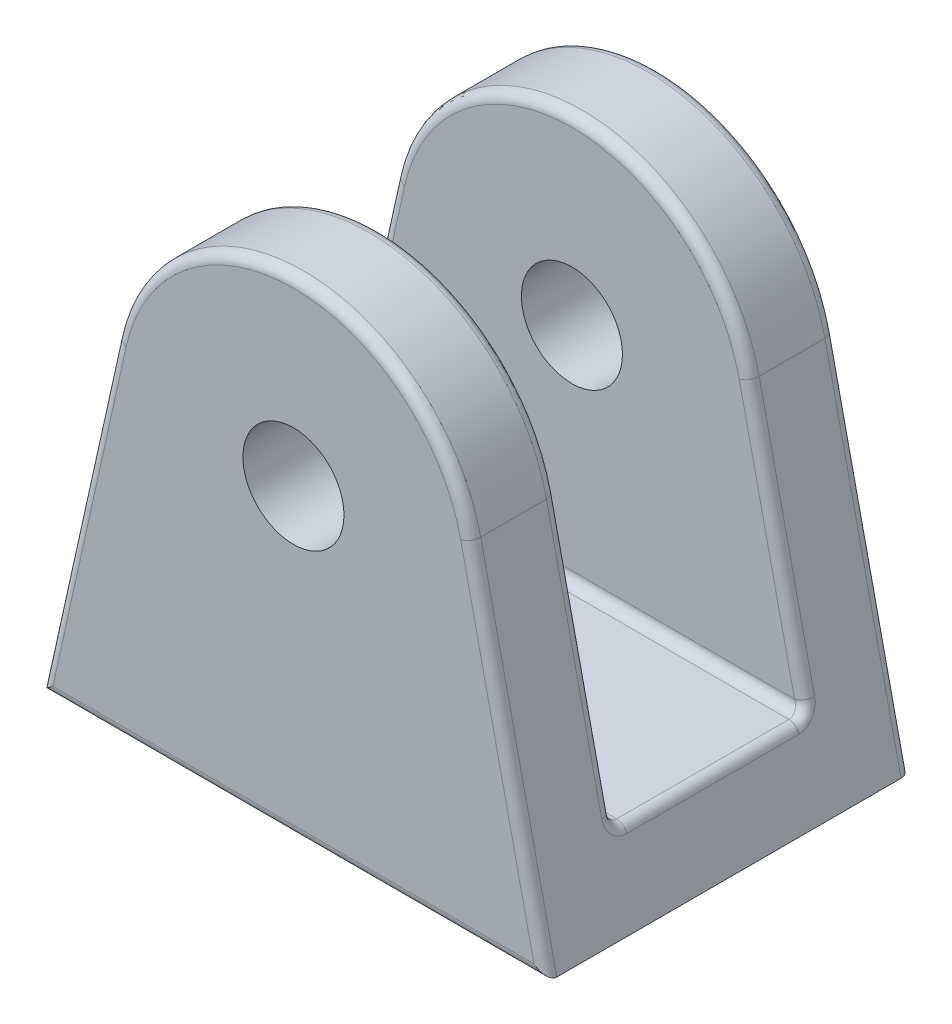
ISO-10303-21;
HEADER;
FILE_DESCRIPTION(('STEP AP214'),'2;1');
FILE_NAME('part.step','',(''),(''),'','','');
FILE_SCHEMA(('AUTOMOTIVE_DESIGN { 1 0 10303 214 1 1 1 1 }'));
ENDSEC;
DATA;
#1=APPLICATION_CONTEXT('core data for automotive mechanical design processes');
#2=APPLICATION_PROTOCOL_DEFINITION('international standard','automotive_design',2000,#1);
#3=PRODUCT_CONTEXT('',#1,'mechanical');
#4=PRODUCT('Part','Part','',(#3));
#5=PRODUCT_RELATED_PRODUCT_CATEGORY('part','',(#4));
#6=PRODUCT_DEFINITION_FORMATION('','',#4);
#7=PRODUCT_DEFINITION_CONTEXT('part definition',#1,'design');
#8=PRODUCT_DEFINITION('design','',#6,#7);
#9=PRODUCT_DEFINITION_SHAPE('','',#8);
#10=(LENGTH_UNIT() NAMED_UNIT(*) SI_UNIT(.MILLI.,.METRE.));
#11=(NAMED_UNIT(*) PLANE_ANGLE_UNIT() SI_UNIT($,.RADIAN.));
#12=(NAMED_UNIT(*) SI_UNIT($,.STERADIAN.) SOLID_ANGLE_UNIT());
#13=UNCERTAINTY_MEASURE_WITH_UNIT(LENGTH_MEASURE(1.E-05),#10,'distance_accuracy_value','');
#14=(GEOMETRIC_REPRESENTATION_CONTEXT(3) GLOBAL_UNCERTAINTY_ASSIGNED_CONTEXT((#13)) GLOBAL_UNIT_ASSIGNED_CONTEXT((#10,
#11,#12)) REPRESENTATION_CONTEXT('',''));
#15=CARTESIAN_POINT('',(0.,0.,0.));
#16=DIRECTION('',(0.,0.,1.));
#17=DIRECTION('',(1.,0.,0.));
#18=AXIS2_PLACEMENT_3D('',#15,#16,#17);
#19=CARTESIAN_POINT('',(42.4895734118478,33.8773450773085,18.));
#20=DIRECTION('',(-0.976296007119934,-0.2164396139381,0.));
#21=DIRECTION('',(0.2164396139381,-0.976296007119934,0.));
#22=AXIS2_PLACEMENT_3D('',#19,#20,#21);
#23=PLANE('',#22);
#24=DIRECTION('',(0.,0.,-1.));
#25=VECTOR('',#24,1.);
#26=CARTESIAN_POINT('',(42.4895734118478,33.8773450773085,18.));
#27=LINE('',#26,#25);
#28=CARTESIAN_POINT('',(42.4895734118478,33.8773450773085,-10.5));
#29=VERTEX_POINT('',#28);
#30=CARTESIAN_POINT('',(42.4895734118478,33.8773450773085,-17.));
#31=VERTEX_POINT('',#30);
#32=EDGE_CURVE('E425',#29,#31,#27,.T.);
#33=ORIENTED_EDGE('',*,*,#32,.F.);
#34=DIRECTION('',(-0.2164396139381,0.976296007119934,0.));
#35=VECTOR('',#34,1.);
#36=CARTESIAN_POINT('',(48.2264426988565,7.99999999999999,-10.5));
#37=LINE('',#36,#35);
#38=CARTESIAN_POINT('',(47.956764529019,9.2164396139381,-10.5));
#39=VERTEX_POINT('',#38);
#40=EDGE_CURVE('E313',#29,#39,#37,.F.);
#41=ORIENTED_EDGE('',*,*,#40,.T.);
#42=CARTESIAN_POINT('',(47.956764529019,9.2164396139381,-8.50000000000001));
#43=DIRECTION('',(-0.976296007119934,-0.2164396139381,0.));
#44=DIRECTION('',(0.2164396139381,-0.976296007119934,0.));
#45=AXIS2_PLACEMENT_3D('',#42,#43,#44);
#46=ELLIPSE('',#45,2.04855902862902,2.);
#47=CARTESIAN_POINT('',(48.4001538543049,7.2164396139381,-8.50000000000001));
#48=VERTEX_POINT('',#47);
#49=EDGE_CURVE('E418',#48,#39,#46,.F.);
#50=ORIENTED_EDGE('',*,*,#49,.F.);
#51=DIRECTION('',(0.,0.,-1.));
#52=VECTOR('',#51,1.);
#53=CARTESIAN_POINT('',(48.4001538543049,7.2164396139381,9.50000000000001));
#54=LINE('',#53,#52);
#55=CARTESIAN_POINT('',(48.4001538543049,7.2164396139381,8.50000000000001));
#56=VERTEX_POINT('',#55);
#57=EDGE_CURVE('E416',#48,#56,#54,.F.);
#58=ORIENTED_EDGE('',*,*,#57,.T.);
#59=CARTESIAN_POINT('',(47.956764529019,9.2164396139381,8.50000000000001));
#60=DIRECTION('',(-0.976296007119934,-0.2164396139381,0.));
#61=DIRECTION('',(0.2164396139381,-0.976296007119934,0.));
#62=AXIS2_PLACEMENT_3D('',#59,#60,#61);
#63=ELLIPSE('',#62,2.04855902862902,2.);
#64=CARTESIAN_POINT('',(47.956764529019,9.2164396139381,10.5));
#65=VERTEX_POINT('',#64);
#66=EDGE_CURVE('E413',#65,#56,#63,.F.);
#67=ORIENTED_EDGE('',*,*,#66,.F.);
#68=DIRECTION('',(0.2164396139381,-0.976296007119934,0.));
#69=VECTOR('',#68,1.);
#70=CARTESIAN_POINT('',(42.4895734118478,33.8773450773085,10.5));
#71=LINE('',#70,#69);
#72=CARTESIAN_POINT('',(42.4895734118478,33.8773450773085,10.5));
#73=VERTEX_POINT('',#72);
#74=EDGE_CURVE('E411',#65,#73,#71,.F.);
#75=ORIENTED_EDGE('',*,*,#74,.T.);
#76=CARTESIAN_POINT('',(42.4895734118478,33.8773450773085,17.));
#77=VERTEX_POINT('',#76);
#78=EDGE_CURVE('E462',#77,#73,#27,.T.);
#79=ORIENTED_EDGE('',*,*,#78,.F.);
#80=DIRECTION('',(-0.2164396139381,0.976296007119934,0.));
#81=VECTOR('',#80,1.);
#82=CARTESIAN_POINT('',(42.4895734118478,33.8773450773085,17.));
#83=LINE('',#82,#81);
#84=CARTESIAN_POINT('',(50.,0.,17.));
#85=VERTEX_POINT('',#84);
#86=EDGE_CURVE('E409',#77,#85,#83,.F.);
#87=ORIENTED_EDGE('',*,*,#86,.T.);
#88=DIRECTION('',(0.,0.,-1.));
#89=VECTOR('',#88,1.);
#90=CARTESIAN_POINT('',(50.,0.,18.));
#91=LINE('',#90,#89);
#92=CARTESIAN_POINT('',(50.,0.,-17.));
#93=VERTEX_POINT('',#92);
#94=EDGE_CURVE('E197',#85,#93,#91,.T.);
#95=ORIENTED_EDGE('',*,*,#94,.T.);
#96=DIRECTION('',(-0.2164396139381,0.976296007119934,0.));
#97=VECTOR('',#96,1.);
#98=CARTESIAN_POINT('',(42.4895734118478,33.8773450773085,-17.));
#99=LINE('',#98,#97);
#100=EDGE_CURVE('E407',#93,#31,#99,.T.);
#101=ORIENTED_EDGE('',*,*,#100,.T.);
#102=EDGE_LOOP('',(#33,#41,#50,#58,#67,#75,#79,#87,#95,#101));
#103=FACE_BOUND('',#102,.T.);
#104=ADVANCED_FACE('F35',(#103),#23,.F.);
#105=CARTESIAN_POINT('',(25.,30.,18.));
#106=DIRECTION('',(0.,0.,-1.));
#107=DIRECTION('',(-1.,0.,0.));
#108=AXIS2_PLACEMENT_3D('',#105,#106,#107);
#109=CYLINDRICAL_SURFACE('',#108,17.9142117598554);
#110=DIRECTION('',(0.,0.,-1.));
#111=VECTOR('',#110,1.);
#112=CARTESIAN_POINT('',(7.51042658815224,33.8773450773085,18.));
#113=LINE('',#112,#111);
#114=CARTESIAN_POINT('',(7.51042658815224,33.8773450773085,17.));
#115=VERTEX_POINT('',#114);
#116=CARTESIAN_POINT('',(7.51042658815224,33.8773450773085,10.5));
#117=VERTEX_POINT('',#116);
#118=EDGE_CURVE('E441',#115,#117,#113,.T.);
#119=ORIENTED_EDGE('',*,*,#118,.F.);
#120=CARTESIAN_POINT('',(25.,30.,17.));
#121=DIRECTION('',(0.,0.,-1.));
#122=DIRECTION('',(-1.,0.,0.));
#123=AXIS2_PLACEMENT_3D('',#120,#121,#122);
#124=CIRCLE('',#123,17.9142117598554);
#125=EDGE_CURVE('E11',#115,#77,#124,.T.);
#126=ORIENTED_EDGE('',*,*,#125,.T.);
#127=ORIENTED_EDGE('',*,*,#78,.T.);
#128=CARTESIAN_POINT('',(25.,30.,10.5));
#129=DIRECTION('',(0.,0.,-1.));
#130=DIRECTION('',(0.,1.,0.));
#131=AXIS2_PLACEMENT_3D('',#128,#129,#130);
#132=CIRCLE('',#131,17.9142117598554);
#133=EDGE_CURVE('E44',#73,#117,#132,.F.);
#134=ORIENTED_EDGE('',*,*,#133,.T.);
#135=EDGE_LOOP('',(#119,#126,#127,#134));
#136=FACE_BOUND('',#135,.T.);
#137=ADVANCED_FACE('F243',(#136),#109,.T.);
#138=CARTESIAN_POINT('',(7.51042658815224,33.8773450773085,-10.5));
#139=VERTEX_POINT('',#138);
#140=CARTESIAN_POINT('',(7.51042658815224,33.8773450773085,-17.));
#141=VERTEX_POINT('',#140);
#142=EDGE_CURVE('E437',#139,#141,#113,.T.);
#143=ORIENTED_EDGE('',*,*,#142,.F.);
#144=CARTESIAN_POINT('',(25.,30.,-10.5));
#145=DIRECTION('',(0.,0.,1.));
#146=DIRECTION('',(0.,-1.,0.));
#147=AXIS2_PLACEMENT_3D('',#144,#145,#146);
#148=CIRCLE('',#147,17.9142117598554);
#149=EDGE_CURVE('E389',#139,#29,#148,.F.);
#150=ORIENTED_EDGE('',*,*,#149,.T.);
#151=ORIENTED_EDGE('',*,*,#32,.T.);
#152=CARTESIAN_POINT('',(25.,30.,-17.));
#153=DIRECTION('',(0.,0.,-1.));
#154=DIRECTION('',(-1.,0.,0.));
#155=AXIS2_PLACEMENT_3D('',#152,#153,#154);
#156=CIRCLE('',#155,17.9142117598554);
#157=EDGE_CURVE('E394',#31,#141,#156,.F.);
#158=ORIENTED_EDGE('',*,*,#157,.T.);
#159=EDGE_LOOP('',(#143,#150,#151,#158));
#160=FACE_BOUND('',#159,.T.);
#161=ADVANCED_FACE('F239',(#160),#109,.T.);
#162=CARTESIAN_POINT('',(0.,0.,18.));
#163=DIRECTION('',(0.976296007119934,-0.2164396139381,0.));
#164=DIRECTION('',(0.2164396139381,0.976296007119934,0.));
#165=AXIS2_PLACEMENT_3D('',#162,#163,#164);
#166=PLANE('',#165);
#167=ORIENTED_EDGE('',*,*,#142,.T.);
#168=DIRECTION('',(-0.2164396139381,-0.976296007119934,0.));
#169=VECTOR('',#168,1.);
#170=CARTESIAN_POINT('',(0.,0.,-17.));
#171=LINE('',#170,#169);
#172=CARTESIAN_POINT('',(0.,0.,-17.));
#173=VERTEX_POINT('',#172);
#174=EDGE_CURVE('E404',#141,#173,#171,.T.);
#175=ORIENTED_EDGE('',*,*,#174,.T.);
#176=DIRECTION('',(0.,0.,-1.));
#177=VECTOR('',#176,1.);
#178=CARTESIAN_POINT('',(0.,0.,18.));
#179=LINE('',#178,#177);
#180=CARTESIAN_POINT('',(0.,0.,17.));
#181=VERTEX_POINT('',#180);
#182=EDGE_CURVE('E442',#181,#173,#179,.T.);
#183=ORIENTED_EDGE('',*,*,#182,.F.);
#184=DIRECTION('',(-0.2164396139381,-0.976296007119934,0.));
#185=VECTOR('',#184,1.);
#186=CARTESIAN_POINT('',(0.,0.,17.));
#187=LINE('',#186,#185);
#188=EDGE_CURVE('E383',#181,#115,#187,.F.);
#189=ORIENTED_EDGE('',*,*,#188,.T.);
#190=ORIENTED_EDGE('',*,*,#118,.T.);
#191=DIRECTION('',(0.2164396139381,0.976296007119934,0.));
#192=VECTOR('',#191,1.);
#193=CARTESIAN_POINT('',(1.77355730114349,7.99999999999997,10.5));
#194=LINE('',#193,#192);
#195=CARTESIAN_POINT('',(2.043235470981,9.2164396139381,10.5));
#196=VERTEX_POINT('',#195);
#197=EDGE_CURVE('E391',#117,#196,#194,.F.);
#198=ORIENTED_EDGE('',*,*,#197,.T.);
#199=CARTESIAN_POINT('',(2.043235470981,9.2164396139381,8.50000000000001));
#200=DIRECTION('',(0.976296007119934,-0.2164396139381,0.));
#201=DIRECTION('',(0.2164396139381,0.976296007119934,0.));
#202=AXIS2_PLACEMENT_3D('',#199,#200,#201);
#203=ELLIPSE('',#202,2.04855902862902,2.);
#204=CARTESIAN_POINT('',(1.59984614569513,7.2164396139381,8.50000000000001));
#205=VERTEX_POINT('',#204);
#206=EDGE_CURVE('E388',#205,#196,#203,.F.);
#207=ORIENTED_EDGE('',*,*,#206,.F.);
#208=DIRECTION('',(0.,0.,1.));
#209=VECTOR('',#208,1.);
#210=CARTESIAN_POINT('',(1.59984614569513,7.2164396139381,-9.50000000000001));
#211=LINE('',#210,#209);
#212=CARTESIAN_POINT('',(1.59984614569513,7.2164396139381,-8.50000000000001));
#213=VERTEX_POINT('',#212);
#214=EDGE_CURVE('E399',#205,#213,#211,.F.);
#215=ORIENTED_EDGE('',*,*,#214,.T.);
#216=CARTESIAN_POINT('',(2.043235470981,9.2164396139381,-8.50000000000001));
#217=DIRECTION('',(0.976296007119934,-0.2164396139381,0.));
#218=DIRECTION('',(0.2164396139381,0.976296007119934,0.));
#219=AXIS2_PLACEMENT_3D('',#216,#217,#218);
#220=ELLIPSE('',#219,2.04855902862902,2.);
#221=CARTESIAN_POINT('',(2.043235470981,9.2164396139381,-10.5));
#222=VERTEX_POINT('',#221);
#223=EDGE_CURVE('E401',#222,#213,#220,.F.);
#224=ORIENTED_EDGE('',*,*,#223,.F.);
#225=DIRECTION('',(-0.2164396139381,-0.976296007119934,0.));
#226=VECTOR('',#225,1.);
#227=CARTESIAN_POINT('',(7.51042658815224,33.8773450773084,-10.5));
#228=LINE('',#227,#226);
#229=EDGE_CURVE('E209',#222,#139,#228,.F.);
#230=ORIENTED_EDGE('',*,*,#229,.T.);
#231=EDGE_LOOP('',(#167,#175,#183,#189,#190,#198,#207,#215,#224,#230));
#232=FACE_BOUND('',#231,.T.);
#233=ADVANCED_FACE('F233',(#232),#166,.F.);
#234=CARTESIAN_POINT('',(50.,0.,18.));
#235=DIRECTION('',(0.,1.,0.));
#236=DIRECTION('',(-1.,0.,0.));
#237=AXIS2_PLACEMENT_3D('',#234,#235,#236);
#238=PLANE('',#237);
#239=ORIENTED_EDGE('',*,*,#182,.T.);
#240=CARTESIAN_POINT('',(1.02427951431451,0.,-17.));
#241=DIRECTION('',(0.,1.,0.));
#242=DIRECTION('',(1.,0.,0.));
#243=AXIS2_PLACEMENT_3D('',#240,#241,#242);
#244=ELLIPSE('',#243,1.02427951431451,1.);
#245=CARTESIAN_POINT('',(1.02427951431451,0.,-18.));
#246=VERTEX_POINT('',#245);
#247=EDGE_CURVE('E328',#173,#246,#244,.F.);
#248=ORIENTED_EDGE('',*,*,#247,.T.);
#249=DIRECTION('',(1.,0.,0.));
#250=VECTOR('',#249,1.);
#251=CARTESIAN_POINT('',(50.,0.,-18.));
#252=LINE('',#251,#250);
#253=CARTESIAN_POINT('',(48.9757204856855,0.,-18.));
#254=VERTEX_POINT('',#253);
#255=EDGE_CURVE('E451',#246,#254,#252,.T.);
#256=ORIENTED_EDGE('',*,*,#255,.T.);
#257=CARTESIAN_POINT('',(48.9757204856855,0.,-17.));
#258=DIRECTION('',(0.,1.,0.));
#259=DIRECTION('',(1.,0.,0.));
#260=AXIS2_PLACEMENT_3D('',#257,#258,#259);
#261=ELLIPSE('',#260,1.02427951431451,1.);
#262=EDGE_CURVE('E326',#254,#93,#261,.F.);
#263=ORIENTED_EDGE('',*,*,#262,.T.);
#264=ORIENTED_EDGE('',*,*,#94,.F.);
#265=DIRECTION('',(1.,0.,0.));
#266=VECTOR('',#265,1.);
#267=CARTESIAN_POINT('',(50.,0.,17.));
#268=LINE('',#267,#266);
#269=EDGE_CURVE('E321',#85,#181,#268,.F.);
#270=ORIENTED_EDGE('',*,*,#269,.T.);
#271=EDGE_LOOP('',(#239,#248,#256,#263,#264,#270));
#272=FACE_BOUND('',#271,.T.);
#273=ADVANCED_FACE('F238',(#272),#238,.F.);
#274=CARTESIAN_POINT('',(25.,30.,18.));
#275=DIRECTION('',(0.,0.,-1.));
#276=DIRECTION('',(-1.,0.,0.));
#277=AXIS2_PLACEMENT_3D('',#274,#275,#276);
#278=PLANE('',#277);
#279=CARTESIAN_POINT('',(25.,30.,18.));
#280=DIRECTION('',(0.,0.,1.));
#281=DIRECTION('',(1.,0.,0.));
#282=AXIS2_PLACEMENT_3D('',#279,#280,#281);
#283=CIRCLE('',#282,4.9894342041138);
#284=CARTESIAN_POINT('',(29.9894342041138,30.,18.));
#285=VERTEX_POINT('',#284);
#286=EDGE_CURVE('E552',#285,#285,#283,.T.);
#287=ORIENTED_EDGE('',*,*,#286,.F.);
#288=EDGE_LOOP('',(#287));
#289=FACE_BOUND('',#288,.T.);
#290=DIRECTION('',(1.,0.,0.));
#291=VECTOR('',#290,1.);
#292=CARTESIAN_POINT('',(25.,0.999999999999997,18.));
#293=LINE('',#292,#291);
#294=CARTESIAN_POINT('',(1.24597417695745,0.999999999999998,18.));
#295=VERTEX_POINT('',#294);
#296=CARTESIAN_POINT('',(48.7540258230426,0.999999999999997,18.));
#297=VERTEX_POINT('',#296);
#298=EDGE_CURVE('E345',#295,#297,#293,.T.);
#299=ORIENTED_EDGE('',*,*,#298,.T.);
#300=DIRECTION('',(-0.2164396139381,0.976296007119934,0.));
#301=VECTOR('',#300,1.);
#302=CARTESIAN_POINT('',(41.5132774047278,33.6609054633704,18.));
#303=LINE('',#302,#301);
#304=CARTESIAN_POINT('',(41.5132774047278,33.6609054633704,18.));
#305=VERTEX_POINT('',#304);
#306=EDGE_CURVE('E350',#297,#305,#303,.T.);
#307=ORIENTED_EDGE('',*,*,#306,.T.);
#308=CARTESIAN_POINT('',(25.,30.,18.));
#309=DIRECTION('',(0.,0.,-1.));
#310=DIRECTION('',(-1.,0.,0.));
#311=AXIS2_PLACEMENT_3D('',#308,#309,#310);
#312=CIRCLE('',#311,16.9142117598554);
#313=CARTESIAN_POINT('',(8.48672259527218,33.6609054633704,18.));
#314=VERTEX_POINT('',#313);
#315=EDGE_CURVE('E59',#305,#314,#312,.F.);
#316=ORIENTED_EDGE('',*,*,#315,.T.);
#317=DIRECTION('',(-0.2164396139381,-0.976296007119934,0.));
#318=VECTOR('',#317,1.);
#319=CARTESIAN_POINT('',(8.48672259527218,33.6609054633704,18.));
#320=LINE('',#319,#318);
#321=EDGE_CURVE('E347',#314,#295,#320,.T.);
#322=ORIENTED_EDGE('',*,*,#321,.T.);
#323=EDGE_LOOP('',(#299,#307,#316,#322));
#324=FACE_BOUND('',#323,.T.);
#325=ADVANCED_FACE('F521',(#289,#324),#278,.F.);
#326=CARTESIAN_POINT('',(25.,30.,-18.));
#327=DIRECTION('',(0.,0.,-1.));
#328=DIRECTION('',(-1.,0.,0.));
#329=AXIS2_PLACEMENT_3D('',#326,#327,#328);
#330=PLANE('',#329);
#331=CARTESIAN_POINT('',(25.,30.,-18.));
#332=DIRECTION('',(0.,0.,1.));
#333=DIRECTION('',(1.,0.,0.));
#334=AXIS2_PLACEMENT_3D('',#331,#332,#333);
#335=CIRCLE('',#334,4.9894342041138);
#336=CARTESIAN_POINT('',(29.9894342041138,30.,-18.));
#337=VERTEX_POINT('',#336);
#338=EDGE_CURVE('E551',#337,#337,#335,.T.);
#339=ORIENTED_EDGE('',*,*,#338,.T.);
#340=EDGE_LOOP('',(#339));
#341=FACE_BOUND('',#340,.T.);
#342=ORIENTED_EDGE('',*,*,#255,.F.);
#343=DIRECTION('',(-0.2164396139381,-0.976296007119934,0.));
#344=VECTOR('',#343,1.);
#345=CARTESIAN_POINT('',(8.48672259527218,33.6609054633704,-18.));
#346=LINE('',#345,#344);
#347=CARTESIAN_POINT('',(8.48672259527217,33.6609054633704,-18.));
#348=VERTEX_POINT('',#347);
#349=EDGE_CURVE('E334',#246,#348,#346,.F.);
#350=ORIENTED_EDGE('',*,*,#349,.T.);
#351=CARTESIAN_POINT('',(25.,30.,-18.));
#352=DIRECTION('',(0.,0.,-1.));
#353=DIRECTION('',(-1.,0.,0.));
#354=AXIS2_PLACEMENT_3D('',#351,#352,#353);
#355=CIRCLE('',#354,16.9142117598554);
#356=CARTESIAN_POINT('',(41.5132774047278,33.6609054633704,-18.));
#357=VERTEX_POINT('',#356);
#358=EDGE_CURVE('E332',#348,#357,#355,.T.);
#359=ORIENTED_EDGE('',*,*,#358,.T.);
#360=DIRECTION('',(-0.2164396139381,0.976296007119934,0.));
#361=VECTOR('',#360,1.);
#362=CARTESIAN_POINT('',(49.0237039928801,-0.216439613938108,-18.));
#363=LINE('',#362,#361);
#364=EDGE_CURVE('E330',#357,#254,#363,.F.);
#365=ORIENTED_EDGE('',*,*,#364,.T.);
#366=EDGE_LOOP('',(#342,#350,#359,#365));
#367=FACE_BOUND('',#366,.T.);
#368=ADVANCED_FACE('F241',(#341,#367),#330,.T.);
#369=CARTESIAN_POINT('',(50.,58.,9.50000000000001));
#370=DIRECTION('',(0.,0.,-1.));
#371=DIRECTION('',(0.,1.,0.));
#372=AXIS2_PLACEMENT_3D('',#369,#370,#371);
#373=PLANE('',#372);
#374=CARTESIAN_POINT('',(25.,30.,9.50000000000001));
#375=DIRECTION('',(0.,0.,-1.));
#376=DIRECTION('',(0.,1.,0.));
#377=AXIS2_PLACEMENT_3D('',#374,#375,#376);
#378=CIRCLE('',#377,4.9894342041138);
#379=CARTESIAN_POINT('',(25.,34.9894342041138,9.50000000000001));
#380=VERTEX_POINT('',#379);
#381=EDGE_CURVE('E368',#380,#380,#378,.T.);
#382=ORIENTED_EDGE('',*,*,#381,.F.);
#383=EDGE_LOOP('',(#382));
#384=FACE_BOUND('',#383,.T.);
#385=DIRECTION('',(0.2164396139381,-0.976296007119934,0.));
#386=VECTOR('',#385,1.);
#387=CARTESIAN_POINT('',(47.2501466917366,7.78356038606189,9.50000000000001));
#388=LINE('',#387,#386);
#389=CARTESIAN_POINT('',(41.5132774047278,33.6609054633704,9.50000000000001));
#390=VERTEX_POINT('',#389);
#391=CARTESIAN_POINT('',(46.9804685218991,9.,9.50000000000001));
#392=VERTEX_POINT('',#391);
#393=EDGE_CURVE('E338',#390,#392,#388,.T.);
#394=ORIENTED_EDGE('',*,*,#393,.T.);
#395=DIRECTION('',(-1.,0.,0.));
#396=VECTOR('',#395,1.);
#397=CARTESIAN_POINT('',(1.77355730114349,9.,9.50000000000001));
#398=LINE('',#397,#396);
#399=CARTESIAN_POINT('',(3.01953147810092,9.,9.50000000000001));
#400=VERTEX_POINT('',#399);
#401=EDGE_CURVE('E343',#392,#400,#398,.T.);
#402=ORIENTED_EDGE('',*,*,#401,.T.);
#403=DIRECTION('',(0.2164396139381,0.976296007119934,0.));
#404=VECTOR('',#403,1.);
#405=CARTESIAN_POINT('',(8.48672259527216,33.6609054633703,9.50000000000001));
#406=LINE('',#405,#404);
#407=CARTESIAN_POINT('',(8.48672259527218,33.6609054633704,9.50000000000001));
#408=VERTEX_POINT('',#407);
#409=EDGE_CURVE('E340',#400,#408,#406,.T.);
#410=ORIENTED_EDGE('',*,*,#409,.T.);
#411=CARTESIAN_POINT('',(25.,30.,9.50000000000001));
#412=DIRECTION('',(0.,0.,-1.));
#413=DIRECTION('',(0.,1.,0.));
#414=AXIS2_PLACEMENT_3D('',#411,#412,#413);
#415=CIRCLE('',#414,16.9142117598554);
#416=EDGE_CURVE('E336',#408,#390,#415,.T.);
#417=ORIENTED_EDGE('',*,*,#416,.T.);
#418=EDGE_LOOP('',(#394,#402,#410,#417));
#419=FACE_BOUND('',#418,.T.);
#420=ADVANCED_FACE('F518',(#384,#419),#373,.T.);
#421=CARTESIAN_POINT('',(50.,8.,9.50000000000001));
#422=DIRECTION('',(0.,1.,0.));
#423=DIRECTION('',(0.,0.,1.));
#424=AXIS2_PLACEMENT_3D('',#421,#422,#423);
#425=PLANE('',#424);
#426=DIRECTION('',(0.,0.,-1.));
#427=VECTOR('',#426,1.);
#428=CARTESIAN_POINT('',(47.4238578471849,8.,-9.50000000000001));
#429=LINE('',#428,#427);
#430=CARTESIAN_POINT('',(47.4238578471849,8.,8.50000000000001));
#431=VERTEX_POINT('',#430);
#432=CARTESIAN_POINT('',(47.4238578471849,8.,-8.50000000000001));
#433=VERTEX_POINT('',#432);
#434=EDGE_CURVE('E312',#431,#433,#429,.T.);
#435=ORIENTED_EDGE('',*,*,#434,.T.);
#436=DIRECTION('',(-1.,0.,0.));
#437=VECTOR('',#436,1.);
#438=CARTESIAN_POINT('',(1.7735573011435,8.,-8.50000000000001));
#439=LINE('',#438,#437);
#440=CARTESIAN_POINT('',(2.57614215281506,8.,-8.50000000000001));
#441=VERTEX_POINT('',#440);
#442=EDGE_CURVE('E318',#433,#441,#439,.T.);
#443=ORIENTED_EDGE('',*,*,#442,.T.);
#444=DIRECTION('',(0.,0.,1.));
#445=VECTOR('',#444,1.);
#446=CARTESIAN_POINT('',(2.57614215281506,8.,9.50000000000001));
#447=LINE('',#446,#445);
#448=CARTESIAN_POINT('',(2.57614215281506,8.,8.50000000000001));
#449=VERTEX_POINT('',#448);
#450=EDGE_CURVE('E316',#441,#449,#447,.T.);
#451=ORIENTED_EDGE('',*,*,#450,.T.);
#452=DIRECTION('',(-1.,0.,0.));
#453=VECTOR('',#452,1.);
#454=CARTESIAN_POINT('',(48.2264426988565,8.,8.50000000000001));
#455=LINE('',#454,#453);
#456=EDGE_CURVE('E308',#449,#431,#455,.F.);
#457=ORIENTED_EDGE('',*,*,#456,.T.);
#458=EDGE_LOOP('',(#435,#443,#451,#457));
#459=FACE_BOUND('',#458,.T.);
#460=ADVANCED_FACE('F317',(#459),#425,.T.);
#461=CARTESIAN_POINT('',(50.,58.,-9.49999999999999));
#462=DIRECTION('',(0.,0.,1.));
#463=DIRECTION('',(0.,-1.,0.));
#464=AXIS2_PLACEMENT_3D('',#461,#462,#463);
#465=PLANE('',#464);
#466=CARTESIAN_POINT('',(25.,30.,-9.5));
#467=DIRECTION('',(0.,0.,1.));
#468=DIRECTION('',(0.,-1.,0.));
#469=AXIS2_PLACEMENT_3D('',#466,#467,#468);
#470=CIRCLE('',#469,4.9894342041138);
#471=CARTESIAN_POINT('',(25.,25.0105657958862,-9.50000000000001));
#472=VERTEX_POINT('',#471);
#473=EDGE_CURVE('E39',#472,#472,#470,.T.);
#474=ORIENTED_EDGE('',*,*,#473,.F.);
#475=EDGE_LOOP('',(#474));
#476=FACE_BOUND('',#475,.T.);
#477=DIRECTION('',(-0.2164396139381,0.976296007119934,0.));
#478=VECTOR('',#477,1.);
#479=CARTESIAN_POINT('',(41.5132774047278,33.6609054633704,-9.5));
#480=LINE('',#479,#478);
#481=CARTESIAN_POINT('',(46.9804685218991,9.,-9.50000000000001));
#482=VERTEX_POINT('',#481);
#483=CARTESIAN_POINT('',(41.5132774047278,33.6609054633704,-9.5));
#484=VERTEX_POINT('',#483);
#485=EDGE_CURVE('E185',#482,#484,#480,.T.);
#486=ORIENTED_EDGE('',*,*,#485,.T.);
#487=CARTESIAN_POINT('',(25.,30.,-9.5));
#488=DIRECTION('',(0.,0.,1.));
#489=DIRECTION('',(0.,-1.,0.));
#490=AXIS2_PLACEMENT_3D('',#487,#488,#489);
#491=CIRCLE('',#490,16.9142117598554);
#492=CARTESIAN_POINT('',(8.48672259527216,33.6609054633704,-9.5));
#493=VERTEX_POINT('',#492);
#494=EDGE_CURVE('E181',#484,#493,#491,.T.);
#495=ORIENTED_EDGE('',*,*,#494,.T.);
#496=DIRECTION('',(-0.2164396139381,-0.976296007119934,0.));
#497=VECTOR('',#496,1.);
#498=CARTESIAN_POINT('',(2.74985330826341,7.78356038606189,-9.50000000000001));
#499=LINE('',#498,#497);
#500=CARTESIAN_POINT('',(3.01953147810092,9.,-9.50000000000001));
#501=VERTEX_POINT('',#500);
#502=EDGE_CURVE('E175',#493,#501,#499,.T.);
#503=ORIENTED_EDGE('',*,*,#502,.T.);
#504=DIRECTION('',(-1.,0.,0.));
#505=VECTOR('',#504,1.);
#506=CARTESIAN_POINT('',(48.2264426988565,9.,-9.50000000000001));
#507=LINE('',#506,#505);
#508=EDGE_CURVE('E178',#501,#482,#507,.F.);
#509=ORIENTED_EDGE('',*,*,#508,.T.);
#510=EDGE_LOOP('',(#486,#495,#503,#509));
#511=FACE_BOUND('',#510,.T.);
#512=ADVANCED_FACE('F177',(#476,#511),#465,.T.);
#513=CARTESIAN_POINT('',(25.,30.,10.5));
#514=DIRECTION('',(0.,0.,-1.));
#515=DIRECTION('',(0.,1.,0.));
#516=AXIS2_PLACEMENT_3D('',#513,#514,#515);
#517=TOROIDAL_SURFACE('',#516,16.9142117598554,1.);
#518=CARTESIAN_POINT('',(8.48672259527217,33.6609054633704,10.5));
#519=DIRECTION('',(-0.216439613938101,-0.976296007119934,0.));
#520=DIRECTION('',(0.976296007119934,-0.216439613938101,0.));
#521=AXIS2_PLACEMENT_3D('',#518,#519,#520);
#522=CIRCLE('',#521,1.);
#523=EDGE_CURVE('E270',#117,#408,#522,.T.);
#524=ORIENTED_EDGE('',*,*,#523,.F.);
#525=ORIENTED_EDGE('',*,*,#133,.F.);
#526=CARTESIAN_POINT('',(41.5132774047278,33.6609054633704,10.5));
#527=DIRECTION('',(0.2164396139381,-0.976296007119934,0.));
#528=DIRECTION('',(0.976296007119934,0.2164396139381,0.));
#529=AXIS2_PLACEMENT_3D('',#526,#527,#528);
#530=CIRCLE('',#529,1.);
#531=EDGE_CURVE('E455',#390,#73,#530,.T.);
#532=ORIENTED_EDGE('',*,*,#531,.F.);
#533=ORIENTED_EDGE('',*,*,#416,.F.);
#534=EDGE_LOOP('',(#524,#525,#532,#533));
#535=FACE_BOUND('',#534,.T.);
#536=ADVANCED_FACE('F497',(#535),#517,.T.);
#537=CARTESIAN_POINT('',(36.7677744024,55.0664862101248,10.5));
#538=DIRECTION('',(-0.2164396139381,0.976296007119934,0.));
#539=DIRECTION('',(-0.976296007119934,-0.2164396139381,0.));
#540=AXIS2_PLACEMENT_3D('',#537,#538,#539);
#541=CYLINDRICAL_SURFACE('',#540,1.);
#542=ORIENTED_EDGE('',*,*,#531,.T.);
#543=ORIENTED_EDGE('',*,*,#74,.F.);
#544=CARTESIAN_POINT('',(46.9804685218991,9.,10.5));
#545=DIRECTION('',(0.216439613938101,-0.976296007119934,0.));
#546=DIRECTION('',(0.976296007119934,0.216439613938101,0.));
#547=AXIS2_PLACEMENT_3D('',#544,#545,#546);
#548=CIRCLE('',#547,1.);
#549=EDGE_CURVE('E267',#392,#65,#548,.T.);
#550=ORIENTED_EDGE('',*,*,#549,.F.);
#551=ORIENTED_EDGE('',*,*,#393,.F.);
#552=EDGE_LOOP('',(#542,#543,#550,#551));
#553=FACE_BOUND('',#552,.T.);
#554=ADVANCED_FACE('F499',(#553),#541,.T.);
#555=CARTESIAN_POINT('',(50.,9.,8.50000000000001));
#556=DIRECTION('',(1.,0.,0.));
#557=DIRECTION('',(0.,0.,-1.));
#558=AXIS2_PLACEMENT_3D('',#555,#556,#557);
#559=CYLINDRICAL_SURFACE('',#558,1.);
#560=CARTESIAN_POINT('',(3.01953147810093,9.,8.50000000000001));
#561=DIRECTION('',(-0.914169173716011,0.405332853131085,0.));
#562=DIRECTION('',(0.405332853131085,0.914169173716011,0.));
#563=AXIS2_PLACEMENT_3D('',#560,#561,#562);
#564=ELLIPSE('',#563,1.093889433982,1.);
#565=EDGE_CURVE('E262',#400,#449,#564,.F.);
#566=ORIENTED_EDGE('',*,*,#565,.F.);
#567=ORIENTED_EDGE('',*,*,#401,.F.);
#568=CARTESIAN_POINT('',(46.9804685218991,9.,8.50000000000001));
#569=DIRECTION('',(0.914169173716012,0.405332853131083,0.));
#570=DIRECTION('',(0.405332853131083,-0.914169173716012,0.));
#571=AXIS2_PLACEMENT_3D('',#568,#569,#570);
#572=ELLIPSE('',#571,1.093889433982,1.);
#573=EDGE_CURVE('E264',#431,#392,#572,.F.);
#574=ORIENTED_EDGE('',*,*,#573,.F.);
#575=ORIENTED_EDGE('',*,*,#456,.F.);
#576=EDGE_LOOP('',(#566,#567,#574,#575));
#577=FACE_BOUND('',#576,.T.);
#578=ADVANCED_FACE('F256',(#577),#559,.F.);
#579=CARTESIAN_POINT('',(15.5745309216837,65.6319427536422,10.5));
#580=DIRECTION('',(-0.2164396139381,-0.976296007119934,0.));
#581=DIRECTION('',(0.976296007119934,-0.2164396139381,0.));
#582=AXIS2_PLACEMENT_3D('',#579,#580,#581);
#583=CYLINDRICAL_SURFACE('',#582,1.);
#584=ORIENTED_EDGE('',*,*,#523,.T.);
#585=ORIENTED_EDGE('',*,*,#409,.F.);
#586=CARTESIAN_POINT('',(3.01953147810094,9.,10.5));
#587=DIRECTION('',(-0.216439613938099,-0.976296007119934,0.));
#588=DIRECTION('',(0.976296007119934,-0.216439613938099,0.));
#589=AXIS2_PLACEMENT_3D('',#586,#587,#588);
#590=CIRCLE('',#589,1.);
#591=EDGE_CURVE('E296',#196,#400,#590,.T.);
#592=ORIENTED_EDGE('',*,*,#591,.F.);
#593=ORIENTED_EDGE('',*,*,#197,.F.);
#594=EDGE_LOOP('',(#584,#585,#592,#593));
#595=FACE_BOUND('',#594,.T.);
#596=ADVANCED_FACE('F276',(#595),#583,.T.);
#597=CARTESIAN_POINT('',(47.4238578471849,8.,8.50000000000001));
#598=CARTESIAN_POINT('',(48.2264426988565,8.,8.50000000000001));
#599=CARTESIAN_POINT('',(48.4001538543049,7.2164396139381,8.50000000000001));
#600=CARTESIAN_POINT('',(47.4238578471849,8.,8.54363922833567));
#601=CARTESIAN_POINT('',(48.2264426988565,8.,8.55140364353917));
#602=CARTESIAN_POINT('',(48.4001538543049,7.2164396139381,8.58727845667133));
#603=CARTESIAN_POINT('',(47.4225890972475,8.00286148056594,8.58727845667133));
#604=CARTESIAN_POINT('',(48.2255810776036,8.00388652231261,8.60283345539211));
#605=CARTESIAN_POINT('',(48.3988851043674,7.22216257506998,8.67455691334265));
#606=CARTESIAN_POINT('',(47.4175379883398,8.01425352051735,8.67380980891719));
#607=CARTESIAN_POINT('',(48.2221617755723,8.01930999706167,8.70443418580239));
#608=CARTESIAN_POINT('',(48.3938339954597,7.24494665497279,8.84761961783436));
#609=CARTESIAN_POINT('',(47.4137535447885,8.02278878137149,8.71670128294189));
#610=CARTESIAN_POINT('',(48.2195992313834,8.03086888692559,8.75465414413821));
#611=CARTESIAN_POINT('',(48.3900495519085,7.26201717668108,8.93340256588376));
#612=CARTESIAN_POINT('',(47.4037378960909,8.04537761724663,8.80100417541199));
#613=CARTESIAN_POINT('',(48.2128488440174,8.06131791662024,8.85266840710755));
#614=CARTESIAN_POINT('',(48.3800339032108,7.30719484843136,9.10200835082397));
#615=CARTESIAN_POINT('',(47.3975027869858,8.05943999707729,8.84241311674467));
#616=CARTESIAN_POINT('',(48.208651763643,8.08024972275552,8.90050225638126));
#617=CARTESIAN_POINT('',(48.3737987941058,7.33531960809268,9.18482623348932));
#618=CARTESIAN_POINT('',(47.3826942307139,8.09283853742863,8.92304452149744));
#619=CARTESIAN_POINT('',(48.1987445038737,8.12493848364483,8.99264920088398));
#620=CARTESIAN_POINT('',(48.3589902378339,7.40211668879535,9.34608904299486));
#621=CARTESIAN_POINT('',(47.3741155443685,8.1121865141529,8.9622618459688));
#622=CARTESIAN_POINT('',(48.1930216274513,8.15075271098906,9.03698726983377));
#623=CARTESIAN_POINT('',(48.3504115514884,7.44081264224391,9.4245236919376));
#624=CARTESIAN_POINT('',(47.3547677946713,8.15582254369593,9.03784184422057));
#625=CARTESIAN_POINT('',(48.1802132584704,8.20852752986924,9.12114929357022));
#626=CARTESIAN_POINT('',(48.3310638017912,7.52808470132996,9.57568368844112));
#627=CARTESIAN_POINT('',(47.3439927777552,8.18012402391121,9.07419637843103));
#628=CARTESIAN_POINT('',(48.1731128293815,8.24055549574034,9.16098024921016));
#629=CARTESIAN_POINT('',(48.3202887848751,7.57668766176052,9.64839275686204));
#630=CARTESIAN_POINT('',(47.3204372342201,8.23325011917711,9.14343181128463));
#631=CARTESIAN_POINT('',(48.1577339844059,8.30992498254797,9.23526432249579));
#632=CARTESIAN_POINT('',(48.2967332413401,7.68293985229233,9.78686362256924));
#633=CARTESIAN_POINT('',(47.3076506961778,8.26208829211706,9.1763017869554));
#634=CARTESIAN_POINT('',(48.1494397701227,8.34733776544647,9.2697050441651));
#635=CARTESIAN_POINT('',(48.2839467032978,7.74061619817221,9.85260357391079));
#636=CARTESIAN_POINT('',(47.2802907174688,8.32379473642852,9.23800836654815));
#637=CARTESIAN_POINT('',(48.1318870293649,8.42651306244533,9.33249983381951));
#638=CARTESIAN_POINT('',(48.2565867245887,7.86402908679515,9.97601673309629));
#639=CARTESIAN_POINT('',(47.2657117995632,8.356675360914,9.26683200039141));
#640=CARTESIAN_POINT('',(48.1226132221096,8.46834450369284,9.36082270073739));
#641=CARTESIAN_POINT('',(48.2420078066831,7.92979033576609,10.0336640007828));
#642=CARTESIAN_POINT('',(47.2350157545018,8.42590581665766,9.31995450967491));
#643=CARTESIAN_POINT('',(48.1033379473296,8.55528964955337,9.41084994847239));
#644=CARTESIAN_POINT('',(48.2113117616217,8.06825124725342,10.1399090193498));
#645=CARTESIAN_POINT('',(47.2188941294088,8.46226579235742,9.34423950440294));
#646=CARTESIAN_POINT('',(48.0933229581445,8.600464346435,9.43250673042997));
#647=CARTESIAN_POINT('',(48.1951901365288,8.14097119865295,10.1884790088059));
#648=CARTESIAN_POINT('',(47.1853873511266,8.53783544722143,9.3878697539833));
#649=CARTESIAN_POINT('',(48.0728179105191,8.69295663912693,9.46886504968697));
#650=CARTESIAN_POINT('',(48.1616833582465,8.29211050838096,10.2757395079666));
#651=CARTESIAN_POINT('',(47.1679989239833,8.57705251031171,9.40720158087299));
#652=CARTESIAN_POINT('',(48.0623170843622,8.74032280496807,9.48350643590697));
#653=CARTESIAN_POINT('',(48.1442949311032,8.37054463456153,10.314403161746));
#654=CARTESIAN_POINT('',(47.1322547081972,8.65766837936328,9.44059383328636));
#655=CARTESIAN_POINT('',(48.0411009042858,8.8360228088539,9.50570532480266));
#656=CARTESIAN_POINT('',(48.1085507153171,8.53177637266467,10.3811876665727));
#657=CARTESIAN_POINT('',(47.1138968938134,8.69907175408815,9.45464267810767));
#658=CARTESIAN_POINT('',(48.0303782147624,8.88438973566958,9.51319492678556));
#659=CARTESIAN_POINT('',(48.0901929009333,8.6145831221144,10.4092853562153));
#660=CARTESIAN_POINT('',(47.0765266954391,8.78335478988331,9.47722629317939));
#661=CARTESIAN_POINT('',(48.0089779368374,8.98092015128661,9.52117637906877));
#662=CARTESIAN_POINT('',(48.0528227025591,8.78314919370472,10.4544525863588));
#663=CARTESIAN_POINT('',(47.0575133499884,8.82623661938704,9.48575256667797));
#664=CARTESIAN_POINT('',(47.9982967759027,9.02909975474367,9.52159782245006));
#665=CARTESIAN_POINT('',(48.0338093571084,8.86891285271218,10.4715051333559));
#666=CARTESIAN_POINT('',(47.0191563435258,8.9127452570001,9.49714166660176));
#667=CARTESIAN_POINT('',(47.977228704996,9.12413168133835,9.51574251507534));
#668=CARTESIAN_POINT('',(47.9954523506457,9.0419301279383,10.4942833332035));
#669=CARTESIAN_POINT('',(46.9998124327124,8.95637262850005,9.50000000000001));
#670=CARTESIAN_POINT('',(47.9668419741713,9.17098319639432,9.50939803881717));
#671=CARTESIAN_POINT('',(47.9761084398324,9.1291848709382,10.5));
#672=CARTESIAN_POINT('',(46.9611246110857,9.04362737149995,9.50000000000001));
#673=CARTESIAN_POINT('',(47.9465914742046,9.26232729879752,9.49051279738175));
#674=CARTESIAN_POINT('',(47.9374206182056,9.303694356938,10.5));
#675=CARTESIAN_POINT('',(46.9417807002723,9.0872547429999,9.49714166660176));
#676=CARTESIAN_POINT('',(47.9367313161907,9.30680359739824,9.47791168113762));
#677=CARTESIAN_POINT('',(47.9180767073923,9.3909490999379,10.4942833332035));
#678=CARTESIAN_POINT('',(46.9034236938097,9.17376338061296,9.48575256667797));
#679=CARTESIAN_POINT('',(47.9177323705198,9.39250230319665,9.44719495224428));
#680=CARTESIAN_POINT('',(47.8797197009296,9.56396637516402,10.4715051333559));
#681=CARTESIAN_POINT('',(46.884410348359,9.21664521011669,9.47722629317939));
#682=CARTESIAN_POINT('',(47.9086000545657,9.43369551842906,9.42903020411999));
#683=CARTESIAN_POINT('',(47.8607063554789,9.64973003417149,10.4544525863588));
#684=CARTESIAN_POINT('',(46.8470401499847,9.30092824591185,9.45464267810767));
#685=CARTESIAN_POINT('',(47.8912158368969,9.5121106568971,9.38801284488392));
#686=CARTESIAN_POINT('',(47.8233361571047,9.8182961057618,10.4092853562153));
#687=CARTESIAN_POINT('',(46.8286823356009,9.34233162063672,9.44059383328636));
#688=CARTESIAN_POINT('',(47.8829725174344,9.54929386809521,9.36512504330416));
#689=CARTESIAN_POINT('',(47.8049783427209,9.90110285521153,10.3811876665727));
#690=CARTESIAN_POINT('',(46.7929381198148,9.42294748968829,9.40720158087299));
#691=CARTESIAN_POINT('',(47.8674786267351,9.61918229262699,9.31558516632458));
#692=CARTESIAN_POINT('',(47.7692341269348,10.0623345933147,10.314403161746));
#693=CARTESIAN_POINT('',(46.7755496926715,9.46216455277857,9.3878697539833));
#694=CARTESIAN_POINT('',(47.8602379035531,9.65184308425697,9.28891331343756));
#695=CARTESIAN_POINT('',(47.7518456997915,10.1407687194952,10.2757395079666));
#696=CARTESIAN_POINT('',(46.7420429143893,9.53773420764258,9.34423950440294));
#697=CARTESIAN_POINT('',(47.846810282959,9.71241116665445,9.23276646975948));
#698=CARTESIAN_POINT('',(47.7183389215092,10.2919080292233,10.1884790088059));
#699=CARTESIAN_POINT('',(46.7259212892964,9.57409418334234,9.31995450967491));
#700=CARTESIAN_POINT('',(47.8406336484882,9.74027216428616,9.20328729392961));
#701=CARTESIAN_POINT('',(47.7022172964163,10.3646279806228,10.1399090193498));
#702=CARTESIAN_POINT('',(46.6952252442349,9.64332463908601,9.26683200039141));
#703=CARTESIAN_POINT('',(47.8293433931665,9.79119921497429,9.14245705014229));
#704=CARTESIAN_POINT('',(47.6715212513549,10.5030888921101,10.0336640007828));
#705=CARTESIAN_POINT('',(46.6806463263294,9.67620526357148,9.23800836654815));
#706=CARTESIAN_POINT('',(47.8242396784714,9.81422058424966,9.11111638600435));
#707=CARTESIAN_POINT('',(47.6569423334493,10.5688501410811,9.97601673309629));
#708=CARTESIAN_POINT('',(46.6532863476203,9.73791170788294,9.1763017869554));
#709=CARTESIAN_POINT('',(47.8150567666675,9.85564202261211,9.04739512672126));
#710=CARTESIAN_POINT('',(47.6295823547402,10.692263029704,9.85260357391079));
#711=CARTESIAN_POINT('',(46.640499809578,9.76674988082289,9.14343181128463));
#712=CARTESIAN_POINT('',(47.8109864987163,9.87400181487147,9.01503757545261));
#713=CARTESIAN_POINT('',(47.6167958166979,10.7499393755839,9.78686362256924));
#714=CARTESIAN_POINT('',(46.616944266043,9.81987597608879,9.07419637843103));
#715=CARTESIAN_POINT('',(47.8037937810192,9.90644606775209,8.94995238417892));
#716=CARTESIAN_POINT('',(47.5932402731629,10.8561915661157,9.64839275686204));
#717=CARTESIAN_POINT('',(46.6061692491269,9.84417745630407,9.03784184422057));
#718=CARTESIAN_POINT('',(47.8006788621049,9.9204965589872,8.91725788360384));
#719=CARTESIAN_POINT('',(47.5824652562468,10.9047945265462,9.57568368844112));
#720=CARTESIAN_POINT('',(46.5868214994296,9.8878134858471,8.96226184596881));
#721=CARTESIAN_POINT('',(47.795296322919,9.94477562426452,8.85196027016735));
#722=CARTESIAN_POINT('',(47.5631175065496,10.9920665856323,9.4245236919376));
#723=CARTESIAN_POINT('',(46.5782428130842,9.90716146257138,8.92304452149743));
#724=CARTESIAN_POINT('',(47.7930346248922,9.95497748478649,8.81939766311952));
#725=CARTESIAN_POINT('',(47.5545388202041,11.0307625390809,9.34608904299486));
#726=CARTESIAN_POINT('',(46.5634342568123,9.94056000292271,8.84241311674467));
#727=CARTESIAN_POINT('',(47.7892520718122,9.97203947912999,8.75459695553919));
#728=CARTESIAN_POINT('',(47.5397302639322,11.0975596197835,9.18482623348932));
#729=CARTESIAN_POINT('',(46.5571991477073,9.95462238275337,8.80100417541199));
#730=CARTESIAN_POINT('',(47.7877355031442,9.9788802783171,8.72240420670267));
#731=CARTESIAN_POINT('',(47.5334951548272,11.1256843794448,9.10200835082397));
#732=CARTESIAN_POINT('',(46.5471834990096,9.97721121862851,8.71670128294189));
#733=CARTESIAN_POINT('',(47.7853497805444,9.98964157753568,8.65836100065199));
#734=CARTESIAN_POINT('',(47.5234795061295,11.1708620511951,8.93340256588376));
#735=CARTESIAN_POINT('',(46.5433990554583,9.98574647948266,8.67380980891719));
#736=CARTESIAN_POINT('',(47.7844833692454,9.99354970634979,8.62655871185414));
#737=CARTESIAN_POINT('',(47.5196950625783,11.1879325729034,8.84761961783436));
#738=CARTESIAN_POINT('',(46.5383479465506,9.99713851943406,8.58727845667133));
#739=CARTESIAN_POINT('',(47.7833345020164,9.99873191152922,8.56314624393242));
#740=CARTESIAN_POINT('',(47.5146439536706,11.2107166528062,8.67455691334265));
#741=CARTESIAN_POINT('',(46.5370791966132,10.,8.54363922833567));
#742=CARTESIAN_POINT('',(47.7830533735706,10.,8.53158560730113));
#743=CARTESIAN_POINT('',(47.5133752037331,11.2164396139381,8.58727845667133));
#744=CARTESIAN_POINT('',(46.5370791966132,10.,8.45636077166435));
#745=CARTESIAN_POINT('',(47.7830533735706,10.,8.4684143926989));
#746=CARTESIAN_POINT('',(47.5133752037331,11.2164396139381,8.4127215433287));
#747=CARTESIAN_POINT('',(46.5383479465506,9.99713851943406,8.4127215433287));
#748=CARTESIAN_POINT('',(47.7833345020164,9.99873191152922,8.43685375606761));
#749=CARTESIAN_POINT('',(47.5146439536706,11.2107166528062,8.32544308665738));
#750=CARTESIAN_POINT('',(46.5433990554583,9.98574647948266,8.32619019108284));
#751=CARTESIAN_POINT('',(47.7844833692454,9.99354970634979,8.37344128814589));
#752=CARTESIAN_POINT('',(47.5196950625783,11.1879325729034,8.15238038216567));
#753=CARTESIAN_POINT('',(46.5471834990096,9.97721121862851,8.28329871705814));
#754=CARTESIAN_POINT('',(47.7853497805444,9.98964157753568,8.34163899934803));
#755=CARTESIAN_POINT('',(47.5234795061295,11.1708620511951,8.06659743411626));
#756=CARTESIAN_POINT('',(46.5571991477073,9.95462238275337,8.19899582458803));
#757=CARTESIAN_POINT('',(47.7877355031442,9.9788802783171,8.27759579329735));
#758=CARTESIAN_POINT('',(47.5334951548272,11.1256843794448,7.89799164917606));
#759=CARTESIAN_POINT('',(46.5634342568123,9.94056000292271,8.15758688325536));
#760=CARTESIAN_POINT('',(47.7892520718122,9.97203947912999,8.24540304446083));
#761=CARTESIAN_POINT('',(47.5397302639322,11.0975596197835,7.8151737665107));
#762=CARTESIAN_POINT('',(46.5782428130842,9.90716146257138,8.07695547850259));
#763=CARTESIAN_POINT('',(47.7930346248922,9.9549774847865,8.18060233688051));
#764=CARTESIAN_POINT('',(47.5545388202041,11.0307625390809,7.65391095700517));
#765=CARTESIAN_POINT('',(46.5868214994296,9.8878134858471,8.03773815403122));
#766=CARTESIAN_POINT('',(47.795296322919,9.94477562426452,8.14803972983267));
#767=CARTESIAN_POINT('',(47.5631175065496,10.9920665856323,7.57547630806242));
#768=CARTESIAN_POINT('',(46.6061692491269,9.84417745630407,7.96215815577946));
#769=CARTESIAN_POINT('',(47.8006788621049,9.9204965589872,8.08274211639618));
#770=CARTESIAN_POINT('',(47.5824652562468,10.9047945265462,7.4243163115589));
#771=CARTESIAN_POINT('',(46.616944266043,9.81987597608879,7.925803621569));
#772=CARTESIAN_POINT('',(47.8037937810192,9.90644606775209,8.05004761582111));
#773=CARTESIAN_POINT('',(47.5932402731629,10.8561915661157,7.35160724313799));
#774=CARTESIAN_POINT('',(46.640499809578,9.76674988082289,7.8565681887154));
#775=CARTESIAN_POINT('',(47.8109864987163,9.87400181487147,7.98496242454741));
#776=CARTESIAN_POINT('',(47.6167958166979,10.7499393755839,7.21313637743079));
#777=CARTESIAN_POINT('',(46.6532863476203,9.73791170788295,7.82369821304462));
#778=CARTESIAN_POINT('',(47.8150567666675,9.85564202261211,7.95260487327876));
#779=CARTESIAN_POINT('',(47.6295823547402,10.692263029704,7.14739642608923));
#780=CARTESIAN_POINT('',(46.6806463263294,9.67620526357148,7.76199163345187));
#781=CARTESIAN_POINT('',(47.8242396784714,9.81422058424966,7.88888361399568));
#782=CARTESIAN_POINT('',(47.6569423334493,10.5688501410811,7.02398326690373));
#783=CARTESIAN_POINT('',(46.6952252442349,9.64332463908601,7.73316799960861));
#784=CARTESIAN_POINT('',(47.8293433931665,9.79119921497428,7.85754294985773));
#785=CARTESIAN_POINT('',(47.6715212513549,10.5030888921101,6.96633599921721));
#786=CARTESIAN_POINT('',(46.7259212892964,9.57409418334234,7.68004549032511));
#787=CARTESIAN_POINT('',(47.8406336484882,9.74027216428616,7.79671270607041));
#788=CARTESIAN_POINT('',(47.7022172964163,10.3646279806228,6.86009098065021));
#789=CARTESIAN_POINT('',(46.7420429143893,9.53773420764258,7.65576049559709));
#790=CARTESIAN_POINT('',(47.8468102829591,9.71241116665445,7.76723353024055));
#791=CARTESIAN_POINT('',(47.7183389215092,10.2919080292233,6.81152099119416));
#792=CARTESIAN_POINT('',(46.7755496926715,9.46216455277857,7.61213024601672));
#793=CARTESIAN_POINT('',(47.8602379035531,9.65184308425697,7.71108668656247));
#794=CARTESIAN_POINT('',(47.7518456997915,10.1407687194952,6.72426049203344));
#795=CARTESIAN_POINT('',(46.7929381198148,9.42294748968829,7.59279841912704));
#796=CARTESIAN_POINT('',(47.8674786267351,9.61918229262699,7.68441483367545));
#797=CARTESIAN_POINT('',(47.7692341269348,10.0623345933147,6.68559683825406));
#798=CARTESIAN_POINT('',(46.8286823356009,9.34233162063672,7.55940616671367));
#799=CARTESIAN_POINT('',(47.8829725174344,9.54929386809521,7.63487495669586));
#800=CARTESIAN_POINT('',(47.8049783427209,9.90110285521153,6.61881233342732));
#801=CARTESIAN_POINT('',(46.8470401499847,9.30092824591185,7.54535732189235));
#802=CARTESIAN_POINT('',(47.8912158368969,9.5121106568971,7.61198715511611));
#803=CARTESIAN_POINT('',(47.8233361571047,9.8182961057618,6.59071464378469));
#804=CARTESIAN_POINT('',(46.884410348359,9.21664521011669,7.52277370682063));
#805=CARTESIAN_POINT('',(47.9086000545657,9.43369551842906,7.57096979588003));
#806=CARTESIAN_POINT('',(47.8607063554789,9.64973003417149,6.54554741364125));
#807=CARTESIAN_POINT('',(46.9034236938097,9.17376338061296,7.51424743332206));
#808=CARTESIAN_POINT('',(47.9177323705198,9.39250230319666,7.55280504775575));
#809=CARTESIAN_POINT('',(47.8797197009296,9.56396637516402,6.52849486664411));
#810=CARTESIAN_POINT('',(46.9417807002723,9.0872547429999,7.50285833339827));
#811=CARTESIAN_POINT('',(47.9367313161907,9.30680359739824,7.5220883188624));
#812=CARTESIAN_POINT('',(47.9180767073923,9.3909490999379,6.50571666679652));
#813=CARTESIAN_POINT('',(46.9611246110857,9.04362737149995,7.50000000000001));
#814=CARTESIAN_POINT('',(47.9465914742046,9.26232729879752,7.50948720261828));
#815=CARTESIAN_POINT('',(47.9374206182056,9.303694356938,6.50000000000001));
#816=CARTESIAN_POINT('',(46.9998124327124,8.95637262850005,7.50000000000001));
#817=CARTESIAN_POINT('',(47.9668419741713,9.17098319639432,7.49060196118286));
#818=CARTESIAN_POINT('',(47.9761084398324,9.1291848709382,6.50000000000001));
#819=CARTESIAN_POINT('',(47.0191563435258,8.9127452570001,7.50285833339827));
#820=CARTESIAN_POINT('',(47.977228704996,9.12413168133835,7.48425748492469));
#821=CARTESIAN_POINT('',(47.9954523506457,9.0419301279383,6.50571666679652));
#822=CARTESIAN_POINT('',(47.0575133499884,8.82623661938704,7.51424743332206));
#823=CARTESIAN_POINT('',(47.9982967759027,9.02909975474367,7.47840217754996));
#824=CARTESIAN_POINT('',(48.0338093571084,8.86891285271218,6.52849486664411));
#825=CARTESIAN_POINT('',(47.0765266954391,8.78335478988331,7.52277370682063));
#826=CARTESIAN_POINT('',(48.0089779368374,8.98092015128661,7.47882362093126));
#827=CARTESIAN_POINT('',(48.052822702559,8.78314919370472,6.54554741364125));
#828=CARTESIAN_POINT('',(47.1138968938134,8.69907175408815,7.54535732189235));
#829=CARTESIAN_POINT('',(48.0303782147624,8.88438973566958,7.48680507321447));
#830=CARTESIAN_POINT('',(48.0901929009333,8.61458312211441,6.59071464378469));
#831=CARTESIAN_POINT('',(47.1322547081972,8.65766837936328,7.55940616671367));
#832=CARTESIAN_POINT('',(48.0411009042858,8.8360228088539,7.49429467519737));
#833=CARTESIAN_POINT('',(48.1085507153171,8.53177637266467,6.61881233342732));
#834=CARTESIAN_POINT('',(47.1679989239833,8.57705251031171,7.59279841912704));
#835=CARTESIAN_POINT('',(48.0623170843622,8.74032280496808,7.51649356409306));
#836=CARTESIAN_POINT('',(48.1442949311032,8.37054463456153,6.68559683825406));
#837=CARTESIAN_POINT('',(47.1853873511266,8.53783544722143,7.61213024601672));
#838=CARTESIAN_POINT('',(48.0728179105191,8.69295663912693,7.53113495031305));
#839=CARTESIAN_POINT('',(48.1616833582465,8.29211050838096,6.72426049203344));
#840=CARTESIAN_POINT('',(47.2188941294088,8.46226579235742,7.65576049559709));
#841=CARTESIAN_POINT('',(48.0933229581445,8.600464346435,7.56749326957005));
#842=CARTESIAN_POINT('',(48.1951901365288,8.14097119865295,6.81152099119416));
#843=CARTESIAN_POINT('',(47.2350157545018,8.42590581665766,7.68004549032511));
#844=CARTESIAN_POINT('',(48.1033379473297,8.55528964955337,7.58915005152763));
#845=CARTESIAN_POINT('',(48.2113117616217,8.06825124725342,6.86009098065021));
#846=CARTESIAN_POINT('',(47.2657117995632,8.356675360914,7.73316799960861));
#847=CARTESIAN_POINT('',(48.1226132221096,8.46834450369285,7.63917729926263));
#848=CARTESIAN_POINT('',(48.2420078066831,7.92979033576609,6.96633599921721));
#849=CARTESIAN_POINT('',(47.2802907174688,8.32379473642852,7.76199163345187));
#850=CARTESIAN_POINT('',(48.1318870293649,8.42651306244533,7.66750016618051));
#851=CARTESIAN_POINT('',(48.2565867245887,7.86402908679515,7.02398326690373));
#852=CARTESIAN_POINT('',(47.3076506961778,8.26208829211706,7.82369821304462));
#853=CARTESIAN_POINT('',(48.1494397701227,8.34733776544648,7.73029495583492));
#854=CARTESIAN_POINT('',(48.2839467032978,7.74061619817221,7.14739642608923));
#855=CARTESIAN_POINT('',(47.3204372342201,8.23325011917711,7.8565681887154));
#856=CARTESIAN_POINT('',(48.1577339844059,8.30992498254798,7.76473567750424));
#857=CARTESIAN_POINT('',(48.2967332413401,7.68293985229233,7.21313637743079));
#858=CARTESIAN_POINT('',(47.3439927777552,8.18012402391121,7.925803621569));
#859=CARTESIAN_POINT('',(48.1731128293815,8.24055549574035,7.83901975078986));
#860=CARTESIAN_POINT('',(48.3202887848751,7.57668766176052,7.35160724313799));
#861=CARTESIAN_POINT('',(47.3547677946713,8.15582254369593,7.96215815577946));
#862=CARTESIAN_POINT('',(48.1802132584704,8.20852752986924,7.87885070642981));
#863=CARTESIAN_POINT('',(48.3310638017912,7.52808470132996,7.4243163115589));
#864=CARTESIAN_POINT('',(47.3741155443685,8.1121865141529,8.03773815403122));
#865=CARTESIAN_POINT('',(48.1930216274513,8.15075271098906,7.96301273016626));
#866=CARTESIAN_POINT('',(48.3504115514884,7.44081264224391,7.57547630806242));
#867=CARTESIAN_POINT('',(47.3826942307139,8.09283853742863,8.07695547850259));
#868=CARTESIAN_POINT('',(48.1987445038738,8.12493848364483,8.00735079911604));
#869=CARTESIAN_POINT('',(48.3589902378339,7.40211668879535,7.65391095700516));
#870=CARTESIAN_POINT('',(47.3975027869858,8.05943999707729,8.15758688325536));
#871=CARTESIAN_POINT('',(48.208651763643,8.08024972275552,8.09949774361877));
#872=CARTESIAN_POINT('',(48.3737987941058,7.33531960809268,7.8151737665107));
#873=CARTESIAN_POINT('',(47.4037378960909,8.04537761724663,8.19899582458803));
#874=CARTESIAN_POINT('',(48.2128488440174,8.06131791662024,8.14733159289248));
#875=CARTESIAN_POINT('',(48.3800339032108,7.30719484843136,7.89799164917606));
#876=CARTESIAN_POINT('',(47.4137535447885,8.02278878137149,8.28329871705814));
#877=CARTESIAN_POINT('',(48.2195992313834,8.03086888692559,8.24534585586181));
#878=CARTESIAN_POINT('',(48.3900495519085,7.26201717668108,8.06659743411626));
#879=CARTESIAN_POINT('',(47.4175379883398,8.01425352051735,8.32619019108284));
#880=CARTESIAN_POINT('',(48.2221617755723,8.01930999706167,8.29556581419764));
#881=CARTESIAN_POINT('',(48.3938339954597,7.24494665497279,8.15238038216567));
#882=CARTESIAN_POINT('',(47.4225890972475,8.00286148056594,8.4127215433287));
#883=CARTESIAN_POINT('',(48.2255810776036,8.00388652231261,8.39716654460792));
#884=CARTESIAN_POINT('',(48.3988851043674,7.22216257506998,8.32544308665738));
#885=CARTESIAN_POINT('',(47.4238578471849,8.,8.45636077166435));
#886=CARTESIAN_POINT('',(48.2264426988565,8.,8.44859635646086));
#887=CARTESIAN_POINT('',(48.4001538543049,7.2164396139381,8.4127215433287));
#888=CARTESIAN_POINT('',(47.4238578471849,8.,8.50000000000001));
#889=CARTESIAN_POINT('',(48.2264426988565,8.,8.50000000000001));
#890=CARTESIAN_POINT('',(48.4001538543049,7.2164396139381,8.50000000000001));
#891=(BOUNDED_SURFACE() B_SPLINE_SURFACE(3,2,((#597,#598,#599),(#600,#601,#602),(#603,#604,
#605),(#606,#607,#608),(#609,#610,#611),(#612,#613,#614),(#615,#616,#617),(#618,#619,#620),
(#621,#622,#623),(#624,#625,#626),(#627,#628,#629),(#630,#631,#632),(#633,#634,#635),(#636,#637,
#638),(#639,#640,#641),(#642,#643,#644),(#645,#646,#647),(#648,#649,#650),(#651,#652,#653),
(#654,#655,#656),(#657,#658,#659),(#660,#661,#662),(#663,#664,#665),(#666,#667,#668),(#669,#670,
#671),(#672,#673,#674),(#675,#676,#677),(#678,#679,#680),(#681,#682,#683),(#684,#685,#686),
(#687,#688,#689),(#690,#691,#692),(#693,#694,#695),(#696,#697,#698),(#699,#700,#701),(#702,#703,
#704),(#705,#706,#707),(#708,#709,#710),(#711,#712,#713),(#714,#715,#716),(#717,#718,#719),
(#720,#721,#722),(#723,#724,#725),(#726,#727,#728),(#729,#730,#731),(#732,#733,#734),(#735,#736,
#737),(#738,#739,#740),(#741,#742,#743),(#744,#745,#746),(#747,#748,#749),(#750,#751,#752),
(#753,#754,#755),(#756,#757,#758),(#759,#760,#761),(#762,#763,#764),(#765,#766,#767),(#768,#769,
#770),(#771,#772,#773),(#774,#775,#776),(#777,#778,#779),(#780,#781,#782),(#783,#784,#785),
(#786,#787,#788),(#789,#790,#791),(#792,#793,#794),(#795,#796,#797),(#798,#799,#800),(#801,#802,
#803),(#804,#805,#806),(#807,#808,#809),(#810,#811,#812),(#813,#814,#815),(#816,#817,#818),
(#819,#820,#821),(#822,#823,#824),(#825,#826,#827),(#828,#829,#830),(#831,#832,#833),(#834,#835,
#836),(#837,#838,#839),(#840,#841,#842),(#843,#844,#845),(#846,#847,#848),(#849,#850,#851),
(#852,#853,#854),(#855,#856,#857),(#858,#859,#860),(#861,#862,#863),(#864,#865,#866),(#867,#868,
#869),(#870,#871,#872),(#873,#874,#875),(#876,#877,#878),(#879,#880,#881),(#882,#883,#884),
(#885,#886,#887),(#888,#889,#890)),.UNSPECIFIED.,.T.,.F.,.F.) B_SPLINE_SURFACE_WITH_KNOTS((4,2,
2,2,2,2,2,2,2,2,2,2,2,2,2,2,2,2,2,2,2,2,2,2,2,2,2,2,2,2,2,2,2,2,2,2,2,2,2,2,2,2,2,2,2,2,2,2,4),
(3,3),(0.,0.261640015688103,0.523497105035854,0.785773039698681,1.04864017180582,
1.31222956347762,1.57662220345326,1.84184386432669,2.10786384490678,2.37459754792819,
2.64191258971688,2.90963793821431,3.17757543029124,3.44551292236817,3.7132382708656,
3.98055331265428,4.2472870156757,4.51330699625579,4.77852865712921,5.04292129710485,
5.30651068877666,5.5693778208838,5.83165375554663,6.09351084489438,6.35515086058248,
6.61679087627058,6.87864796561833,7.14092390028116,7.4037910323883,7.66738042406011,
7.93177306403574,8.19699472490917,8.46301470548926,8.72974840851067,8.99706345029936,
9.26478879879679,9.53272629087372,9.80066378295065,10.0683891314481,10.3357041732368,
10.6024378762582,10.8684578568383,11.1336795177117,11.3980721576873,11.6616615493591,
11.9245286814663,12.1868046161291,12.4486617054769,12.710301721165),(0.,1.),
.UNSPECIFIED.) GEOMETRIC_REPRESENTATION_ITEM() RATIONAL_B_SPLINE_SURFACE(((1.,0.779884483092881,
1.),(1.,0.779884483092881,1.),(1.,0.779686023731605,1.),(1.,0.778895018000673,1.),(1.,
0.778302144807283,1.),(1.,0.776730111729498,1.),(1.,0.775750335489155,1.),(1.,0.773417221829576,
1.),(1.,0.772063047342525,1.),(1.,0.768998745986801,1.),(1.,0.767287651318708,1.),(1.,
0.763531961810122,1.),(1.,0.761486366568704,1.),(1.,0.75708893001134,1.),(1.,0.754736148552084,
1.),(1.,0.749756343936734,1.),(1.,0.747128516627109,1.),(1.,0.741635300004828,1.),(1.,
0.738769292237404,1.),(1.,0.732840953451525,1.),(1.,0.72977820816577,1.),(1.,0.723502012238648,
1.),(1.,0.720288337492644,1.),(1.,0.713760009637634,1.),(1.,0.710445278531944,1.),(1.,
0.703768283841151,1.),(1.,0.700406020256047,1.),(1.,0.693690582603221,1.),(1.,0.690337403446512,
1.),(1.,0.683699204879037,1.),(1.,0.680414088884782,1.),(1.,0.673972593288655,1.),(1.,
0.67081594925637,1.),(1.,0.664692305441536,1.),(1.,0.661724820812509,1.),(1.,0.65603932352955,
1.),(1.,0.653320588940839,1.),(1.,0.64818971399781,1.),(1.,0.645776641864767,1.),(1.,
0.641309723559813,1.),(1.,0.639254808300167,1.),(1.,0.635550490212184,1.),(1.,0.633899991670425,
1.),(1.,0.63104264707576,1.),(1.,0.629834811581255,1.),(1.,0.627891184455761,1.),(1.,
0.62715464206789,1.),(1.,0.626170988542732,1.),(1.,0.62592347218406,1.),(1.,0.62592347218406,
1.),(1.,0.626170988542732,1.),(1.,0.62715464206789,1.),(1.,0.627891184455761,1.),(1.,
0.629834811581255,1.),(1.,0.63104264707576,1.),(1.,0.633899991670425,1.),(1.,0.635550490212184,
1.),(1.,0.639254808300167,1.),(1.,0.641309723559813,1.),(1.,0.645776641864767,1.),(1.,
0.64818971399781,1.),(1.,0.653320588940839,1.),(1.,0.65603932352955,1.),(1.,0.661724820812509,
1.),(1.,0.664692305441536,1.),(1.,0.67081594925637,1.),(1.,0.673972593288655,1.),(1.,
0.680414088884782,1.),(1.,0.683699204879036,1.),(1.,0.690337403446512,1.),(1.,0.693690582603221,
1.),(1.,0.700406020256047,1.),(1.,0.703768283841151,1.),(1.,0.710445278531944,1.),(1.,
0.713760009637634,1.),(1.,0.720288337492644,1.),(1.,0.723502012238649,1.),(1.,0.72977820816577,
1.),(1.,0.732840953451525,1.),(1.,0.738769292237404,1.),(1.,0.741635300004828,1.),(1.,
0.747128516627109,1.),(1.,0.749756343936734,1.),(1.,0.754736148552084,1.),(1.,0.75708893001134,
1.),(1.,0.761486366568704,1.),(1.,0.763531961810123,1.),(1.,0.767287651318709,1.),(1.,
0.768998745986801,1.),(1.,0.772063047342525,1.),(1.,0.773417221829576,1.),(1.,0.775750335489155,
1.),(1.,0.776730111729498,1.),(1.,0.778302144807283,1.),(1.,0.778895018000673,1.),(1.,
0.779686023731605,1.),(1.,0.779884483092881,1.),(1.,0.779884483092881,1.))) REPRESENTATION_ITEM('') SURFACE());
#892=ORIENTED_EDGE('',*,*,#549,.T.);
#893=ORIENTED_EDGE('',*,*,#66,.T.);
#894=CARTESIAN_POINT('',(47.4238578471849,7.,8.50000000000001));
#895=DIRECTION('',(0.,0.,1.));
#896=DIRECTION('',(1.,0.,0.));
#897=AXIS2_PLACEMENT_3D('',#894,#895,#896);
#898=CIRCLE('',#897,1.);
#899=EDGE_CURVE('E294',#431,#56,#898,.F.);
#900=ORIENTED_EDGE('',*,*,#899,.F.);
#901=ORIENTED_EDGE('',*,*,#573,.T.);
#902=EDGE_LOOP('',(#892,#893,#900,#901));
#903=FACE_BOUND('',#902,.T.);
#904=ADVANCED_FACE('F253',(#903),#891,.T.);
#905=CARTESIAN_POINT('',(3.46292080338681,10.,8.50000000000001));
#906=CARTESIAN_POINT('',(2.21694662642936,10.,8.50000000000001));
#907=CARTESIAN_POINT('',(2.48662479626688,11.2164396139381,8.50000000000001));
#908=CARTESIAN_POINT('',(3.46292080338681,10.,8.54363922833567));
#909=CARTESIAN_POINT('',(2.21694662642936,10.,8.53158560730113));
#910=CARTESIAN_POINT('',(2.48662479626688,11.2164396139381,8.58727845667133));
#911=CARTESIAN_POINT('',(3.46165205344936,9.99713851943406,8.58727845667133));
#912=CARTESIAN_POINT('',(2.21666549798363,9.99873191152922,8.56314624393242));
#913=CARTESIAN_POINT('',(2.48535604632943,11.2107166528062,8.67455691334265));
#914=CARTESIAN_POINT('',(3.45660094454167,9.98574647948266,8.67380980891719));
#915=CARTESIAN_POINT('',(2.21551663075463,9.99354970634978,8.62655871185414));
#916=CARTESIAN_POINT('',(2.48030493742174,11.1879325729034,8.84761961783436));
#917=CARTESIAN_POINT('',(3.45281650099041,9.97721121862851,8.71670128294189));
#918=CARTESIAN_POINT('',(2.21465021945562,9.98964157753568,8.65836100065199));
#919=CARTESIAN_POINT('',(2.47652049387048,11.1708620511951,8.93340256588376));
#920=CARTESIAN_POINT('',(3.44280085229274,9.95462238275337,8.80100417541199));
#921=CARTESIAN_POINT('',(2.21226449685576,9.9788802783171,8.72240420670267));
#922=CARTESIAN_POINT('',(2.46650484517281,11.1256843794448,9.10200835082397));
#923=CARTESIAN_POINT('',(3.43656574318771,9.94056000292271,8.84241311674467));
#924=CARTESIAN_POINT('',(2.21074792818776,9.97203947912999,8.75459695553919));
#925=CARTESIAN_POINT('',(2.46026973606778,11.0975596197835,9.18482623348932));
#926=CARTESIAN_POINT('',(3.4217571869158,9.90716146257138,8.92304452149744));
#927=CARTESIAN_POINT('',(2.20696537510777,9.9549774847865,8.81939766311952));
#928=CARTESIAN_POINT('',(2.44546117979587,11.0307625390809,9.34608904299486));
#929=CARTESIAN_POINT('',(3.41317850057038,9.8878134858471,8.96226184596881));
#930=CARTESIAN_POINT('',(2.20470367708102,9.94477562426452,8.85196027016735));
#931=CARTESIAN_POINT('',(2.43688249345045,10.9920665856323,9.4245236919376));
#932=CARTESIAN_POINT('',(3.39383075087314,9.84417745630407,9.03784184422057));
#933=CARTESIAN_POINT('',(2.19932113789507,9.9204965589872,8.91725788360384));
#934=CARTESIAN_POINT('',(2.41753474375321,10.9047945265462,9.57568368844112));
#935=CARTESIAN_POINT('',(3.38305573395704,9.81987597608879,9.07419637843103));
#936=CARTESIAN_POINT('',(2.19620621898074,9.90644606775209,8.94995238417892));
#937=CARTESIAN_POINT('',(2.40675972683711,10.8561915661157,9.64839275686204));
#938=CARTESIAN_POINT('',(3.35950019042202,9.76674988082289,9.14343181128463));
#939=CARTESIAN_POINT('',(2.18901350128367,9.87400181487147,9.01503757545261));
#940=CARTESIAN_POINT('',(2.38320418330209,10.7499393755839,9.78686362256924));
#941=CARTESIAN_POINT('',(3.3467136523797,9.73791170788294,9.1763017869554));
#942=CARTESIAN_POINT('',(2.18494323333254,9.85564202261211,9.04739512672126));
#943=CARTESIAN_POINT('',(2.37041764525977,10.692263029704,9.85260357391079));
#944=CARTESIAN_POINT('',(3.31935367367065,9.67620526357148,9.23800836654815));
#945=CARTESIAN_POINT('',(2.17576032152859,9.81422058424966,9.11111638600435));
#946=CARTESIAN_POINT('',(2.34305766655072,10.5688501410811,9.97601673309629));
#947=CARTESIAN_POINT('',(3.30477475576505,9.64332463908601,9.26683200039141));
#948=CARTESIAN_POINT('',(2.1706566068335,9.79119921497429,9.14245705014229));
#949=CARTESIAN_POINT('',(2.32847874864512,10.5030888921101,10.0336640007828));
#950=CARTESIAN_POINT('',(3.27407871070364,9.57409418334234,9.31995450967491));
#951=CARTESIAN_POINT('',(2.1593663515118,9.74027216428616,9.20328729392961));
#952=CARTESIAN_POINT('',(2.29778270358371,10.3646279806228,10.1399090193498));
#953=CARTESIAN_POINT('',(3.25795708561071,9.53773420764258,9.34423950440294));
#954=CARTESIAN_POINT('',(2.15318971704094,9.71241116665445,9.23276646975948));
#955=CARTESIAN_POINT('',(2.28166107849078,10.2919080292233,10.1884790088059));
#956=CARTESIAN_POINT('',(3.22445030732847,9.46216455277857,9.3878697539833));
#957=CARTESIAN_POINT('',(2.1397620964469,9.65184308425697,9.28891331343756));
#958=CARTESIAN_POINT('',(2.24815430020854,10.1407687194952,10.2757395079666));
#959=CARTESIAN_POINT('',(3.20706188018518,9.42294748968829,9.40720158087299));
#960=CARTESIAN_POINT('',(2.13252137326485,9.619182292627,9.31558516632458));
#961=CARTESIAN_POINT('',(2.23076587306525,10.0623345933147,10.314403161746));
#962=CARTESIAN_POINT('',(3.17131766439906,9.34233162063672,9.44059383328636));
#963=CARTESIAN_POINT('',(2.11702748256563,9.54929386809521,9.36512504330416));
#964=CARTESIAN_POINT('',(2.19502165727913,9.90110285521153,10.3811876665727));
#965=CARTESIAN_POINT('',(3.15295985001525,9.30092824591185,9.45464267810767));
#966=CARTESIAN_POINT('',(2.10878416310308,9.5121106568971,9.38801284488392));
#967=CARTESIAN_POINT('',(2.17666384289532,9.8182961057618,10.4092853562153));
#968=CARTESIAN_POINT('',(3.11558965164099,9.21664521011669,9.47722629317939));
#969=CARTESIAN_POINT('',(2.09139994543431,9.43369551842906,9.42903020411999));
#970=CARTESIAN_POINT('',(2.13929364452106,9.64973003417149,10.4544525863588));
#971=CARTESIAN_POINT('',(3.09657630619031,9.17376338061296,9.48575256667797));
#972=CARTESIAN_POINT('',(2.08226762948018,9.39250230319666,9.44719495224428));
#973=CARTESIAN_POINT('',(2.12028029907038,9.56396637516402,10.4715051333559));
#974=CARTESIAN_POINT('',(3.05821929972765,9.0872547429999,9.49714166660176));
#975=CARTESIAN_POINT('',(2.06326868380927,9.30680359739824,9.47791168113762));
#976=CARTESIAN_POINT('',(2.08192329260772,9.3909490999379,10.4942833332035));
#977=CARTESIAN_POINT('',(3.03887538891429,9.04362737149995,9.50000000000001));
#978=CARTESIAN_POINT('',(2.05340852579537,9.26232729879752,9.49051279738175));
#979=CARTESIAN_POINT('',(2.06257938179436,9.303694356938,10.5));
#980=CARTESIAN_POINT('',(3.00018756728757,8.95637262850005,9.50000000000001));
#981=CARTESIAN_POINT('',(2.03315802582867,9.17098319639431,9.50939803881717));
#982=CARTESIAN_POINT('',(2.02389156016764,9.1291848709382,10.5));
#983=CARTESIAN_POINT('',(2.98084365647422,8.9127452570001,9.49714166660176));
#984=CARTESIAN_POINT('',(2.02277129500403,9.12413168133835,9.51574251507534));
#985=CARTESIAN_POINT('',(2.00454764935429,9.0419301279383,10.4942833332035));
#986=CARTESIAN_POINT('',(2.94248665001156,8.82623661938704,9.48575256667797));
#987=CARTESIAN_POINT('',(2.00170322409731,9.02909975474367,9.52159782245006));
#988=CARTESIAN_POINT('',(1.96619064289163,8.86891285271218,10.4715051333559));
#989=CARTESIAN_POINT('',(2.92347330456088,8.78335478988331,9.47722629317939));
#990=CARTESIAN_POINT('',(1.99102206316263,8.98092015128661,9.52117637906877));
#991=CARTESIAN_POINT('',(1.94717729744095,8.78314919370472,10.4544525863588));
#992=CARTESIAN_POINT('',(2.88610310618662,8.69907175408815,9.45464267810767));
#993=CARTESIAN_POINT('',(1.96962178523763,8.88438973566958,9.51319492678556));
#994=CARTESIAN_POINT('',(1.90980709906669,8.6145831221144,10.4092853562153));
#995=CARTESIAN_POINT('',(2.8677452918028,8.65766837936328,9.44059383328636));
#996=CARTESIAN_POINT('',(1.95889909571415,8.8360228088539,9.50570532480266));
#997=CARTESIAN_POINT('',(1.89144928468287,8.53177637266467,10.3811876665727));
#998=CARTESIAN_POINT('',(2.83200107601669,8.57705251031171,9.40720158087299));
#999=CARTESIAN_POINT('',(1.93768291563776,8.74032280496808,9.48350643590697));
#1000=CARTESIAN_POINT('',(1.85570506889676,8.37054463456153,10.314403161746));
#1001=CARTESIAN_POINT('',(2.8146126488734,8.53783544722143,9.3878697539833));
#1002=CARTESIAN_POINT('',(1.92718208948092,8.69295663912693,9.46886504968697));
#1003=CARTESIAN_POINT('',(1.83831664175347,8.29211050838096,10.2757395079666));
#1004=CARTESIAN_POINT('',(2.78110587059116,8.46226579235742,9.34423950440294));
#1005=CARTESIAN_POINT('',(1.90667704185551,8.600464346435,9.43250673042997));
#1006=CARTESIAN_POINT('',(1.80480986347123,8.14097119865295,10.1884790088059));
#1007=CARTESIAN_POINT('',(2.76498424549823,8.42590581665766,9.31995450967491));
#1008=CARTESIAN_POINT('',(1.89666205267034,8.55528964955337,9.41084994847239));
#1009=CARTESIAN_POINT('',(1.7886882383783,8.06825124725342,10.1399090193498));
#1010=CARTESIAN_POINT('',(2.73428820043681,8.356675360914,9.26683200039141));
#1011=CARTESIAN_POINT('',(1.87738677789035,8.46834450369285,9.36082270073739));
#1012=CARTESIAN_POINT('',(1.75799219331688,7.92979033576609,10.0336640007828));
#1013=CARTESIAN_POINT('',(2.71970928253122,8.32379473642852,9.23800836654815));
#1014=CARTESIAN_POINT('',(1.86811297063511,8.42651306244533,9.33249983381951));
#1015=CARTESIAN_POINT('',(1.74341327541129,7.86402908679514,9.97601673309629));
#1016=CARTESIAN_POINT('',(2.69234930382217,8.26208829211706,9.1763017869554));
#1017=CARTESIAN_POINT('',(1.85056022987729,8.34733776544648,9.2697050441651));
#1018=CARTESIAN_POINT('',(1.71605329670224,7.74061619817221,9.85260357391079));
#1019=CARTESIAN_POINT('',(2.67956276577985,8.23325011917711,9.14343181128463));
#1020=CARTESIAN_POINT('',(1.84226601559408,8.30992498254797,9.23526432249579));
#1021=CARTESIAN_POINT('',(1.70326675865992,7.68293985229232,9.78686362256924));
#1022=CARTESIAN_POINT('',(2.65600722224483,8.18012402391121,9.07419637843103));
#1023=CARTESIAN_POINT('',(1.82688717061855,8.24055549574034,9.16098024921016));
#1024=CARTESIAN_POINT('',(1.6797112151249,7.57668766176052,9.64839275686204));
#1025=CARTESIAN_POINT('',(2.64523220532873,8.15582254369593,9.03784184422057));
#1026=CARTESIAN_POINT('',(1.81978674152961,8.20852752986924,9.12114929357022));
#1027=CARTESIAN_POINT('',(1.6689361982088,7.52808470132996,9.57568368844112));
#1028=CARTESIAN_POINT('',(2.62588445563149,8.1121865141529,8.96226184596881));
#1029=CARTESIAN_POINT('',(1.80697837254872,8.15075271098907,9.03698726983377));
#1030=CARTESIAN_POINT('',(1.64958844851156,7.44081264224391,9.4245236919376));
#1031=CARTESIAN_POINT('',(2.61730576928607,8.09283853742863,8.92304452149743));
#1032=CARTESIAN_POINT('',(1.80125549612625,8.12493848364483,8.99264920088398));
#1033=CARTESIAN_POINT('',(1.64100976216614,7.40211668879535,9.34608904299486));
#1034=CARTESIAN_POINT('',(2.60249721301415,8.05943999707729,8.84241311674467));
#1035=CARTESIAN_POINT('',(1.79134823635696,8.08024972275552,8.90050225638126));
#1036=CARTESIAN_POINT('',(1.62620120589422,7.33531960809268,9.18482623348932));
#1037=CARTESIAN_POINT('',(2.59626210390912,8.04537761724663,8.80100417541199));
#1038=CARTESIAN_POINT('',(1.78715115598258,8.06131791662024,8.85266840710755));
#1039=CARTESIAN_POINT('',(1.61996609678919,7.30719484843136,9.10200835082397));
#1040=CARTESIAN_POINT('',(2.58624645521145,8.02278878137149,8.71670128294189));
#1041=CARTESIAN_POINT('',(1.78040076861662,8.03086888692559,8.75465414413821));
#1042=CARTESIAN_POINT('',(1.60995044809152,7.26201717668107,8.93340256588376));
#1043=CARTESIAN_POINT('',(2.58246201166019,8.01425352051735,8.67380980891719));
#1044=CARTESIAN_POINT('',(1.77783822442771,8.01930999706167,8.70443418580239));
#1045=CARTESIAN_POINT('',(1.60616600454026,7.24494665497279,8.84761961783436));
#1046=CARTESIAN_POINT('',(2.57741090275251,8.00286148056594,8.58727845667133));
#1047=CARTESIAN_POINT('',(1.77441892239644,8.00388652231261,8.60283345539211));
#1048=CARTESIAN_POINT('',(1.60111489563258,7.22216257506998,8.67455691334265));
#1049=CARTESIAN_POINT('',(2.57614215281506,8.,8.54363922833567));
#1050=CARTESIAN_POINT('',(1.77355730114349,8.,8.55140364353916));
#1051=CARTESIAN_POINT('',(1.59984614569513,7.2164396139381,8.58727845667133));
#1052=CARTESIAN_POINT('',(2.57614215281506,8.,8.45636077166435));
#1053=CARTESIAN_POINT('',(1.77355730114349,8.,8.44859635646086));
#1054=CARTESIAN_POINT('',(1.59984614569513,7.2164396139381,8.4127215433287));
#1055=CARTESIAN_POINT('',(2.57741090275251,8.00286148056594,8.4127215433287));
#1056=CARTESIAN_POINT('',(1.77441892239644,8.00388652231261,8.39716654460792));
#1057=CARTESIAN_POINT('',(1.60111489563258,7.22216257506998,8.32544308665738));
#1058=CARTESIAN_POINT('',(2.58246201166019,8.01425352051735,8.32619019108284));
#1059=CARTESIAN_POINT('',(1.77783822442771,8.01930999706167,8.29556581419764));
#1060=CARTESIAN_POINT('',(1.60616600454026,7.24494665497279,8.15238038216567));
#1061=CARTESIAN_POINT('',(2.58624645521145,8.02278878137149,8.28329871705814));
#1062=CARTESIAN_POINT('',(1.78040076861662,8.03086888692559,8.24534585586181));
#1063=CARTESIAN_POINT('',(1.60995044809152,7.26201717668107,8.06659743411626));
#1064=CARTESIAN_POINT('',(2.59626210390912,8.04537761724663,8.19899582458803));
#1065=CARTESIAN_POINT('',(1.78715115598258,8.06131791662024,8.14733159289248));
#1066=CARTESIAN_POINT('',(1.61996609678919,7.30719484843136,7.89799164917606));
#1067=CARTESIAN_POINT('',(2.60249721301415,8.05943999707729,8.15758688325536));
#1068=CARTESIAN_POINT('',(1.79134823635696,8.08024972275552,8.09949774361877));
#1069=CARTESIAN_POINT('',(1.62620120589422,7.33531960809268,7.8151737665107));
#1070=CARTESIAN_POINT('',(2.61730576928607,8.09283853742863,8.07695547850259));
#1071=CARTESIAN_POINT('',(1.80125549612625,8.12493848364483,8.00735079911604));
#1072=CARTESIAN_POINT('',(1.64100976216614,7.40211668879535,7.65391095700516));
#1073=CARTESIAN_POINT('',(2.62588445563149,8.1121865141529,8.03773815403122));
#1074=CARTESIAN_POINT('',(1.80697837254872,8.15075271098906,7.96301273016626));
#1075=CARTESIAN_POINT('',(1.64958844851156,7.44081264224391,7.57547630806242));
#1076=CARTESIAN_POINT('',(2.64523220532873,8.15582254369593,7.96215815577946));
#1077=CARTESIAN_POINT('',(1.81978674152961,8.20852752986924,7.87885070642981));
#1078=CARTESIAN_POINT('',(1.6689361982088,7.52808470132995,7.4243163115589));
#1079=CARTESIAN_POINT('',(2.65600722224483,8.18012402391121,7.925803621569));
#1080=CARTESIAN_POINT('',(1.82688717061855,8.24055549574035,7.83901975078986));
#1081=CARTESIAN_POINT('',(1.6797112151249,7.57668766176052,7.35160724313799));
#1082=CARTESIAN_POINT('',(2.67956276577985,8.23325011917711,7.8565681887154));
#1083=CARTESIAN_POINT('',(1.84226601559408,8.30992498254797,7.76473567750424));
#1084=CARTESIAN_POINT('',(1.70326675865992,7.68293985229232,7.21313637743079));
#1085=CARTESIAN_POINT('',(2.69234930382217,8.26208829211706,7.82369821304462));
#1086=CARTESIAN_POINT('',(1.85056022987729,8.34733776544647,7.73029495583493));
#1087=CARTESIAN_POINT('',(1.71605329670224,7.74061619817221,7.14739642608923));
#1088=CARTESIAN_POINT('',(2.71970928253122,8.32379473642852,7.76199163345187));
#1089=CARTESIAN_POINT('',(1.86811297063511,8.42651306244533,7.66750016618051));
#1090=CARTESIAN_POINT('',(1.74341327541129,7.86402908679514,7.02398326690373));
#1091=CARTESIAN_POINT('',(2.73428820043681,8.356675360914,7.73316799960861));
#1092=CARTESIAN_POINT('',(1.87738677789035,8.46834450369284,7.63917729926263));
#1093=CARTESIAN_POINT('',(1.75799219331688,7.92979033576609,6.96633599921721));
#1094=CARTESIAN_POINT('',(2.76498424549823,8.42590581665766,7.68004549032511));
#1095=CARTESIAN_POINT('',(1.89666205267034,8.55528964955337,7.58915005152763));
#1096=CARTESIAN_POINT('',(1.7886882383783,8.06825124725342,6.86009098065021));
#1097=CARTESIAN_POINT('',(2.78110587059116,8.46226579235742,7.65576049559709));
#1098=CARTESIAN_POINT('',(1.90667704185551,8.60046434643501,7.56749326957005));
#1099=CARTESIAN_POINT('',(1.80480986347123,8.14097119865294,6.81152099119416));
#1100=CARTESIAN_POINT('',(2.81461264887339,8.53783544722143,7.61213024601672));
#1101=CARTESIAN_POINT('',(1.92718208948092,8.69295663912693,7.53113495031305));
#1102=CARTESIAN_POINT('',(1.83831664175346,8.29211050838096,6.72426049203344));
#1103=CARTESIAN_POINT('',(2.83200107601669,8.57705251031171,7.59279841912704));
#1104=CARTESIAN_POINT('',(1.93768291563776,8.74032280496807,7.51649356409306));
#1105=CARTESIAN_POINT('',(1.85570506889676,8.37054463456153,6.68559683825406));
#1106=CARTESIAN_POINT('',(2.8677452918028,8.65766837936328,7.55940616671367));
#1107=CARTESIAN_POINT('',(1.95889909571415,8.8360228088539,7.49429467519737));
#1108=CARTESIAN_POINT('',(1.89144928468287,8.53177637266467,6.61881233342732));
#1109=CARTESIAN_POINT('',(2.88610310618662,8.69907175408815,7.54535732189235));
#1110=CARTESIAN_POINT('',(1.96962178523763,8.88438973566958,7.48680507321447));
#1111=CARTESIAN_POINT('',(1.90980709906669,8.6145831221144,6.59071464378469));
#1112=CARTESIAN_POINT('',(2.92347330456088,8.78335478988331,7.52277370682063));
#1113=CARTESIAN_POINT('',(1.99102206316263,8.98092015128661,7.47882362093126));
#1114=CARTESIAN_POINT('',(1.94717729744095,8.78314919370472,6.54554741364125));
#1115=CARTESIAN_POINT('',(2.94248665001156,8.82623661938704,7.51424743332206));
#1116=CARTESIAN_POINT('',(2.00170322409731,9.02909975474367,7.47840217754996));
#1117=CARTESIAN_POINT('',(1.96619064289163,8.86891285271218,6.52849486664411));
#1118=CARTESIAN_POINT('',(2.98084365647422,8.9127452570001,7.50285833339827));
#1119=CARTESIAN_POINT('',(2.02277129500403,9.12413168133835,7.48425748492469));
#1120=CARTESIAN_POINT('',(2.00454764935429,9.0419301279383,6.50571666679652));
#1121=CARTESIAN_POINT('',(3.00018756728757,8.95637262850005,7.50000000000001));
#1122=CARTESIAN_POINT('',(2.03315802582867,9.17098319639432,7.49060196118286));
#1123=CARTESIAN_POINT('',(2.02389156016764,9.1291848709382,6.50000000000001));
#1124=CARTESIAN_POINT('',(3.03887538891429,9.04362737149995,7.50000000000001));
#1125=CARTESIAN_POINT('',(2.05340852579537,9.26232729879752,7.50948720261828));
#1126=CARTESIAN_POINT('',(2.06257938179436,9.303694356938,6.50000000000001));
#1127=CARTESIAN_POINT('',(3.05821929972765,9.0872547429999,7.50285833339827));
#1128=CARTESIAN_POINT('',(2.06326868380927,9.30680359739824,7.5220883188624));
#1129=CARTESIAN_POINT('',(2.08192329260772,9.3909490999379,6.50571666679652));
#1130=CARTESIAN_POINT('',(3.09657630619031,9.17376338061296,7.51424743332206));
#1131=CARTESIAN_POINT('',(2.08226762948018,9.39250230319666,7.55280504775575));
#1132=CARTESIAN_POINT('',(2.12028029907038,9.56396637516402,6.5284948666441));
#1133=CARTESIAN_POINT('',(3.11558965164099,9.21664521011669,7.52277370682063));
#1134=CARTESIAN_POINT('',(2.09139994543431,9.43369551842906,7.57096979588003));
#1135=CARTESIAN_POINT('',(2.13929364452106,9.64973003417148,6.54554741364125));
#1136=CARTESIAN_POINT('',(3.15295985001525,9.30092824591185,7.54535732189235));
#1137=CARTESIAN_POINT('',(2.10878416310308,9.5121106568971,7.61198715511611));
#1138=CARTESIAN_POINT('',(2.17666384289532,9.8182961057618,6.59071464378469));
#1139=CARTESIAN_POINT('',(3.17131766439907,9.34233162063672,7.55940616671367));
#1140=CARTESIAN_POINT('',(2.11702748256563,9.54929386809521,7.63487495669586));
#1141=CARTESIAN_POINT('',(2.19502165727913,9.90110285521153,6.61881233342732));
#1142=CARTESIAN_POINT('',(3.20706188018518,9.42294748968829,7.59279841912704));
#1143=CARTESIAN_POINT('',(2.13252137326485,9.61918229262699,7.68441483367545));
#1144=CARTESIAN_POINT('',(2.23076587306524,10.0623345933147,6.68559683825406));
#1145=CARTESIAN_POINT('',(3.22445030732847,9.46216455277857,7.61213024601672));
#1146=CARTESIAN_POINT('',(2.1397620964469,9.65184308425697,7.71108668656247));
#1147=CARTESIAN_POINT('',(2.24815430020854,10.1407687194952,6.72426049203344));
#1148=CARTESIAN_POINT('',(3.25795708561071,9.53773420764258,7.65576049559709));
#1149=CARTESIAN_POINT('',(2.15318971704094,9.71241116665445,7.76723353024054));
#1150=CARTESIAN_POINT('',(2.28166107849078,10.2919080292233,6.81152099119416));
#1151=CARTESIAN_POINT('',(3.27407871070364,9.57409418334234,7.68004549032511));
#1152=CARTESIAN_POINT('',(2.1593663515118,9.74027216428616,7.79671270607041));
#1153=CARTESIAN_POINT('',(2.29778270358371,10.3646279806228,6.86009098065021));
#1154=CARTESIAN_POINT('',(3.30477475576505,9.64332463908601,7.73316799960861));
#1155=CARTESIAN_POINT('',(2.1706566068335,9.79119921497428,7.85754294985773));
#1156=CARTESIAN_POINT('',(2.32847874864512,10.5030888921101,6.96633599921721));
#1157=CARTESIAN_POINT('',(3.31935367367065,9.67620526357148,7.76199163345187));
#1158=CARTESIAN_POINT('',(2.17576032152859,9.81422058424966,7.88888361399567));
#1159=CARTESIAN_POINT('',(2.34305766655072,10.5688501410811,7.02398326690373));
#1160=CARTESIAN_POINT('',(3.3467136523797,9.73791170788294,7.82369821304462));
#1161=CARTESIAN_POINT('',(2.18494323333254,9.85564202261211,7.95260487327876));
#1162=CARTESIAN_POINT('',(2.37041764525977,10.692263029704,7.14739642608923));
#1163=CARTESIAN_POINT('',(3.35950019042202,9.76674988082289,7.8565681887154));
#1164=CARTESIAN_POINT('',(2.18901350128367,9.87400181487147,7.98496242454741));
#1165=CARTESIAN_POINT('',(2.38320418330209,10.7499393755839,7.21313637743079));
#1166=CARTESIAN_POINT('',(3.38305573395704,9.81987597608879,7.925803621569));
#1167=CARTESIAN_POINT('',(2.19620621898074,9.90644606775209,8.05004761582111));
#1168=CARTESIAN_POINT('',(2.40675972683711,10.8561915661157,7.35160724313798));
#1169=CARTESIAN_POINT('',(3.39383075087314,9.84417745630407,7.96215815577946));
#1170=CARTESIAN_POINT('',(2.19932113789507,9.9204965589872,8.08274211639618));
#1171=CARTESIAN_POINT('',(2.41753474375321,10.9047945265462,7.4243163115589));
#1172=CARTESIAN_POINT('',(3.41317850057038,9.8878134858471,8.03773815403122));
#1173=CARTESIAN_POINT('',(2.20470367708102,9.94477562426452,8.14803972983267));
#1174=CARTESIAN_POINT('',(2.43688249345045,10.9920665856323,7.57547630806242));
#1175=CARTESIAN_POINT('',(3.4217571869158,9.90716146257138,8.07695547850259));
#1176=CARTESIAN_POINT('',(2.20696537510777,9.9549774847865,8.18060233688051));
#1177=CARTESIAN_POINT('',(2.44546117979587,11.0307625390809,7.65391095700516));
#1178=CARTESIAN_POINT('',(3.43656574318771,9.94056000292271,8.15758688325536));
#1179=CARTESIAN_POINT('',(2.21074792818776,9.97203947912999,8.24540304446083));
#1180=CARTESIAN_POINT('',(2.46026973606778,11.0975596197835,7.8151737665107));
#1181=CARTESIAN_POINT('',(3.44280085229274,9.95462238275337,8.19899582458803));
#1182=CARTESIAN_POINT('',(2.21226449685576,9.9788802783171,8.27759579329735));
#1183=CARTESIAN_POINT('',(2.46650484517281,11.1256843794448,7.89799164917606));
#1184=CARTESIAN_POINT('',(3.45281650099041,9.97721121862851,8.28329871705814));
#1185=CARTESIAN_POINT('',(2.21465021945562,9.98964157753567,8.34163899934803));
#1186=CARTESIAN_POINT('',(2.47652049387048,11.1708620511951,8.06659743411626));
#1187=CARTESIAN_POINT('',(3.45660094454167,9.98574647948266,8.32619019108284));
#1188=CARTESIAN_POINT('',(2.21551663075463,9.99354970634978,8.37344128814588));
#1189=CARTESIAN_POINT('',(2.48030493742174,11.1879325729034,8.15238038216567));
#1190=CARTESIAN_POINT('',(3.46165205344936,9.99713851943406,8.4127215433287));
#1191=CARTESIAN_POINT('',(2.21666549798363,9.99873191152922,8.43685375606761));
#1192=CARTESIAN_POINT('',(2.48535604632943,11.2107166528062,8.32544308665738));
#1193=CARTESIAN_POINT('',(3.46292080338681,10.,8.45636077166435));
#1194=CARTESIAN_POINT('',(2.21694662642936,10.,8.4684143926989));
#1195=CARTESIAN_POINT('',(2.48662479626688,11.2164396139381,8.4127215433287));
#1196=CARTESIAN_POINT('',(3.46292080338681,10.,8.50000000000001));
#1197=CARTESIAN_POINT('',(2.21694662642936,10.,8.50000000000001));
#1198=CARTESIAN_POINT('',(2.48662479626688,11.2164396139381,8.50000000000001));
#1199=(BOUNDED_SURFACE() B_SPLINE_SURFACE(3,2,((#905,#906,#907),(#908,#909,#910),(#911,#912,
#913),(#914,#915,#916),(#917,#918,#919),(#920,#921,#922),(#923,#924,#925),(#926,#927,#928),
(#929,#930,#931),(#932,#933,#934),(#935,#936,#937),(#938,#939,#940),(#941,#942,#943),(#944,#945,
#946),(#947,#948,#949),(#950,#951,#952),(#953,#954,#955),(#956,#957,#958),(#959,#960,#961),
(#962,#963,#964),(#965,#966,#967),(#968,#969,#970),(#971,#972,#973),(#974,#975,#976),(#977,#978,
#979),(#980,#981,#982),(#983,#984,#985),(#986,#987,#988),(#989,#990,#991),(#992,#993,#994),
(#995,#996,#997),(#998,#999,#1000),(#1001,#1002,#1003),(#1004,#1005,#1006),(#1007,#1008,#1009),
(#1010,#1011,#1012),(#1013,#1014,#1015),(#1016,#1017,#1018),(#1019,#1020,#1021),(#1022,#1023,
#1024),(#1025,#1026,#1027),(#1028,#1029,#1030),(#1031,#1032,#1033),(#1034,#1035,#1036),(#1037,
#1038,#1039),(#1040,#1041,#1042),(#1043,#1044,#1045),(#1046,#1047,#1048),(#1049,#1050,#1051),
(#1052,#1053,#1054),(#1055,#1056,#1057),(#1058,#1059,#1060),(#1061,#1062,#1063),(#1064,#1065,
#1066),(#1067,#1068,#1069),(#1070,#1071,#1072),(#1073,#1074,#1075),(#1076,#1077,#1078),(#1079,
#1080,#1081),(#1082,#1083,#1084),(#1085,#1086,#1087),(#1088,#1089,#1090),(#1091,#1092,#1093),
(#1094,#1095,#1096),(#1097,#1098,#1099),(#1100,#1101,#1102),(#1103,#1104,#1105),(#1106,#1107,
#1108),(#1109,#1110,#1111),(#1112,#1113,#1114),(#1115,#1116,#1117),(#1118,#1119,#1120),(#1121,
#1122,#1123),(#1124,#1125,#1126),(#1127,#1128,#1129),(#1130,#1131,#1132),(#1133,#1134,#1135),
(#1136,#1137,#1138),(#1139,#1140,#1141),(#1142,#1143,#1144),(#1145,#1146,#1147),(#1148,#1149,
#1150),(#1151,#1152,#1153),(#1154,#1155,#1156),(#1157,#1158,#1159),(#1160,#1161,#1162),(#1163,
#1164,#1165),(#1166,#1167,#1168),(#1169,#1170,#1171),(#1172,#1173,#1174),(#1175,#1176,#1177),
(#1178,#1179,#1180),(#1181,#1182,#1183),(#1184,#1185,#1186),(#1187,#1188,#1189),(#1190,#1191,
#1192),(#1193,#1194,#1195),(#1196,#1197,#1198)),.UNSPECIFIED.,.T.,.F.,
.F.) B_SPLINE_SURFACE_WITH_KNOTS((4,2,2,2,2,2,2,2,2,2,2,2,2,2,2,2,2,2,2,2,2,2,2,2,2,2,2,2,2,2,2,
2,2,2,2,2,2,2,2,2,2,2,2,2,2,2,2,2,4),(3,3),(0.,0.261640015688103,0.523497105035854,
0.785773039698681,1.04864017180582,1.31222956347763,1.57662220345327,1.84184386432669,
2.10786384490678,2.37459754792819,2.64191258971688,2.90963793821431,3.17757543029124,
3.44551292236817,3.7132382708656,3.98055331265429,4.2472870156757,4.51330699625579,
4.77852865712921,5.04292129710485,5.30651068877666,5.5693778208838,5.83165375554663,
6.09351084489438,6.35515086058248,6.61679087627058,6.87864796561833,7.14092390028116,
7.4037910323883,7.66738042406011,7.93177306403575,8.19699472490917,8.46301470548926,
8.72974840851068,8.99706345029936,9.2647887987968,9.53272629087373,9.80066378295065,
10.0683891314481,10.3357041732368,10.6024378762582,10.8684578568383,11.1336795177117,
11.3980721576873,11.6616615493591,11.9245286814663,12.1868046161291,12.4486617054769,
12.710301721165),(0.,1.),
.UNSPECIFIED.) GEOMETRIC_REPRESENTATION_ITEM() RATIONAL_B_SPLINE_SURFACE(((1.,0.62592347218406,
1.),(1.,0.62592347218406,1.),(1.,0.626170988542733,1.),(1.,0.627154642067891,1.),(1.,
0.627891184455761,1.),(1.,0.629834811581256,1.),(1.,0.63104264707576,1.),(1.,0.633899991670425,
1.),(1.,0.635550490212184,1.),(1.,0.639254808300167,1.),(1.,0.641309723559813,1.),(1.,
0.645776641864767,1.),(1.,0.64818971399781,1.),(1.,0.653320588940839,1.),(1.,0.656039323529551,
1.),(1.,0.661724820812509,1.),(1.,0.664692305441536,1.),(1.,0.67081594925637,1.),(1.,
0.673972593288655,1.),(1.,0.680414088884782,1.),(1.,0.683699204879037,1.),(1.,0.690337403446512,
1.),(1.,0.693690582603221,1.),(1.,0.700406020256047,1.),(1.,0.703768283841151,1.),(1.,
0.710445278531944,1.),(1.,0.713760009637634,1.),(1.,0.720288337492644,1.),(1.,0.723502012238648,
1.),(1.,0.72977820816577,1.),(1.,0.732840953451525,1.),(1.,0.738769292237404,1.),(1.,
0.741635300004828,1.),(1.,0.747128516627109,1.),(1.,0.749756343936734,1.),(1.,0.754736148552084,
1.),(1.,0.75708893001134,1.),(1.,0.761486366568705,1.),(1.,0.763531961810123,1.),(1.,
0.767287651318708,1.),(1.,0.768998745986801,1.),(1.,0.772063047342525,1.),(1.,0.773417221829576,
1.),(1.,0.775750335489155,1.),(1.,0.776730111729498,1.),(1.,0.778302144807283,1.),(1.,
0.778895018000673,1.),(1.,0.779686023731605,1.),(1.,0.779884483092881,1.),(1.,0.779884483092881,
1.),(1.,0.779686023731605,1.),(1.,0.778895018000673,1.),(1.,0.778302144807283,1.),(1.,
0.776730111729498,1.),(1.,0.775750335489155,1.),(1.,0.773417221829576,1.),(1.,0.772063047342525,
1.),(1.,0.768998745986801,1.),(1.,0.767287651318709,1.),(1.,0.763531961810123,1.),(1.,
0.761486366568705,1.),(1.,0.75708893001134,1.),(1.,0.754736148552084,1.),(1.,0.749756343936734,
1.),(1.,0.747128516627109,1.),(1.,0.741635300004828,1.),(1.,0.738769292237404,1.),(1.,
0.732840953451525,1.),(1.,0.72977820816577,1.),(1.,0.723502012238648,1.),(1.,0.720288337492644,
1.),(1.,0.713760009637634,1.),(1.,0.710445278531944,1.),(1.,0.703768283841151,1.),(1.,
0.700406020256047,1.),(1.,0.693690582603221,1.),(1.,0.690337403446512,1.),(1.,0.683699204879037,
1.),(1.,0.680414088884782,1.),(1.,0.673972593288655,1.),(1.,0.67081594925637,1.),(1.,
0.664692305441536,1.),(1.,0.661724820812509,1.),(1.,0.656039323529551,1.),(1.,0.653320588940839,
1.),(1.,0.64818971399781,1.),(1.,0.645776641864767,1.),(1.,0.641309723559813,1.),(1.,
0.639254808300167,1.),(1.,0.635550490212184,1.),(1.,0.633899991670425,1.),(1.,0.63104264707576,
1.),(1.,0.629834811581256,1.),(1.,0.627891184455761,1.),(1.,0.627154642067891,1.),(1.,
0.626170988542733,1.),(1.,0.62592347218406,1.),(1.,0.62592347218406,1.))) REPRESENTATION_ITEM('') SURFACE());
#1200=ORIENTED_EDGE('',*,*,#591,.T.);
#1201=ORIENTED_EDGE('',*,*,#565,.T.);
#1202=CARTESIAN_POINT('',(2.57614215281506,7.,8.50000000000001));
#1203=DIRECTION('',(0.,0.,1.));
#1204=DIRECTION('',(1.,0.,0.));
#1205=AXIS2_PLACEMENT_3D('',#1202,#1203,#1204);
#1206=CIRCLE('',#1205,1.);
#1207=EDGE_CURVE('E292',#205,#449,#1206,.F.);
#1208=ORIENTED_EDGE('',*,*,#1207,.F.);
#1209=ORIENTED_EDGE('',*,*,#206,.T.);
#1210=EDGE_LOOP('',(#1200,#1201,#1208,#1209));
#1211=FACE_BOUND('',#1210,.T.);
#1212=ADVANCED_FACE('F247',(#1211),#1199,.T.);
#1213=CARTESIAN_POINT('',(47.4238578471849,7.,9.50000000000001));
#1214=DIRECTION('',(0.,0.,1.));
#1215=DIRECTION('',(0.,-1.,0.));
#1216=AXIS2_PLACEMENT_3D('',#1213,#1214,#1215);
#1217=CYLINDRICAL_SURFACE('',#1216,1.);
#1218=ORIENTED_EDGE('',*,*,#899,.T.);
#1219=ORIENTED_EDGE('',*,*,#57,.F.);
#1220=CARTESIAN_POINT('',(47.4238578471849,7.,-8.50000000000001));
#1221=DIRECTION('',(0.,0.,-1.));
#1222=DIRECTION('',(-1.,0.,0.));
#1223=AXIS2_PLACEMENT_3D('',#1220,#1221,#1222);
#1224=CIRCLE('',#1223,1.);
#1225=EDGE_CURVE('E291',#433,#48,#1224,.T.);
#1226=ORIENTED_EDGE('',*,*,#1225,.F.);
#1227=ORIENTED_EDGE('',*,*,#434,.F.);
#1228=EDGE_LOOP('',(#1218,#1219,#1226,#1227));
#1229=FACE_BOUND('',#1228,.T.);
#1230=ADVANCED_FACE('F252',(#1229),#1217,.T.);
#1231=CARTESIAN_POINT('',(50.,9.,-8.50000000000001));
#1232=DIRECTION('',(1.,0.,0.));
#1233=DIRECTION('',(0.,0.,-1.));
#1234=AXIS2_PLACEMENT_3D('',#1231,#1232,#1233);
#1235=CYLINDRICAL_SURFACE('',#1234,1.);
#1236=CARTESIAN_POINT('',(3.01953147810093,9.,-8.50000000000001));
#1237=DIRECTION('',(-0.914169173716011,0.405332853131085,0.));
#1238=DIRECTION('',(0.405332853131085,0.914169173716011,0.));
#1239=AXIS2_PLACEMENT_3D('',#1236,#1237,#1238);
#1240=ELLIPSE('',#1239,1.093889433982,1.);
#1241=EDGE_CURVE('E192',#441,#501,#1240,.F.);
#1242=ORIENTED_EDGE('',*,*,#1241,.F.);
#1243=ORIENTED_EDGE('',*,*,#442,.F.);
#1244=CARTESIAN_POINT('',(46.9804685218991,9.,-8.50000000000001));
#1245=DIRECTION('',(0.914169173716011,0.405332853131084,0.));
#1246=DIRECTION('',(0.405332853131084,-0.914169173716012,0.));
#1247=AXIS2_PLACEMENT_3D('',#1244,#1245,#1246);
#1248=ELLIPSE('',#1247,1.093889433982,1.);
#1249=EDGE_CURVE('E195',#482,#433,#1248,.F.);
#1250=ORIENTED_EDGE('',*,*,#1249,.F.);
#1251=ORIENTED_EDGE('',*,*,#508,.F.);
#1252=EDGE_LOOP('',(#1242,#1243,#1250,#1251));
#1253=FACE_BOUND('',#1252,.T.);
#1254=ADVANCED_FACE('F190',(#1253),#1235,.F.);
#1255=CARTESIAN_POINT('',(2.57614215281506,7.,9.50000000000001));
#1256=DIRECTION('',(0.,0.,-1.));
#1257=DIRECTION('',(0.,1.,0.));
#1258=AXIS2_PLACEMENT_3D('',#1255,#1256,#1257);
#1259=CYLINDRICAL_SURFACE('',#1258,1.);
#1260=ORIENTED_EDGE('',*,*,#1207,.T.);
#1261=ORIENTED_EDGE('',*,*,#450,.F.);
#1262=CARTESIAN_POINT('',(2.57614215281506,7.,-8.50000000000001));
#1263=DIRECTION('',(0.,0.,-1.));
#1264=DIRECTION('',(-1.,0.,0.));
#1265=AXIS2_PLACEMENT_3D('',#1262,#1263,#1264);
#1266=CIRCLE('',#1265,1.);
#1267=EDGE_CURVE('E206',#213,#441,#1266,.T.);
#1268=ORIENTED_EDGE('',*,*,#1267,.F.);
#1269=ORIENTED_EDGE('',*,*,#214,.F.);
#1270=EDGE_LOOP('',(#1260,#1261,#1268,#1269));
#1271=FACE_BOUND('',#1270,.T.);
#1272=ADVANCED_FACE('F287',(#1271),#1259,.T.);
#1273=CARTESIAN_POINT('',(47.4238578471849,8.,-8.50000000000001));
#1274=CARTESIAN_POINT('',(48.2264426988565,8.,-8.50000000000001));
#1275=CARTESIAN_POINT('',(48.4001538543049,7.2164396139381,-8.50000000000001));
#1276=CARTESIAN_POINT('',(47.4238578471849,8.,-8.45636077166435));
#1277=CARTESIAN_POINT('',(48.2264426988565,8.,-8.44859635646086));
#1278=CARTESIAN_POINT('',(48.4001538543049,7.2164396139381,-8.41272154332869));
#1279=CARTESIAN_POINT('',(47.4225890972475,8.00286148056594,-8.41272154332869));
#1280=CARTESIAN_POINT('',(48.2255810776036,8.00388652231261,-8.39716654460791));
#1281=CARTESIAN_POINT('',(48.3988851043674,7.22216257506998,-8.32544308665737));
#1282=CARTESIAN_POINT('',(47.4175379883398,8.01425352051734,-8.32619019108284));
#1283=CARTESIAN_POINT('',(48.2221617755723,8.01930999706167,-8.29556581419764));
#1284=CARTESIAN_POINT('',(48.3938339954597,7.24494665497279,-8.15238038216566));
#1285=CARTESIAN_POINT('',(47.4137535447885,8.02278878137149,-8.28329871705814));
#1286=CARTESIAN_POINT('',(48.2195992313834,8.03086888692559,-8.24534585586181));
#1287=CARTESIAN_POINT('',(48.3900495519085,7.26201717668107,-8.06659743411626));
#1288=CARTESIAN_POINT('',(47.4037378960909,8.04537761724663,-8.19899582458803));
#1289=CARTESIAN_POINT('',(48.2128488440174,8.06131791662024,-8.14733159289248));
#1290=CARTESIAN_POINT('',(48.3800339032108,7.30719484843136,-7.89799164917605));
#1291=CARTESIAN_POINT('',(47.3975027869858,8.05943999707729,-8.15758688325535));
#1292=CARTESIAN_POINT('',(48.208651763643,8.08024972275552,-8.09949774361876));
#1293=CARTESIAN_POINT('',(48.3737987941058,7.33531960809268,-7.8151737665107));
#1294=CARTESIAN_POINT('',(47.3826942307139,8.09283853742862,-8.07695547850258));
#1295=CARTESIAN_POINT('',(48.1987445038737,8.12493848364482,-8.00735079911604));
#1296=CARTESIAN_POINT('',(48.3589902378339,7.40211668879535,-7.65391095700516));
#1297=CARTESIAN_POINT('',(47.3741155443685,8.1121865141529,-8.03773815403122));
#1298=CARTESIAN_POINT('',(48.1930216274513,8.15075271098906,-7.96301273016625));
#1299=CARTESIAN_POINT('',(48.3504115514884,7.44081264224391,-7.57547630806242));
#1300=CARTESIAN_POINT('',(47.3547677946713,8.15582254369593,-7.96215815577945));
#1301=CARTESIAN_POINT('',(48.1802132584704,8.20852752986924,-7.87885070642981));
#1302=CARTESIAN_POINT('',(48.3310638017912,7.52808470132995,-7.4243163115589));
#1303=CARTESIAN_POINT('',(47.3439927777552,8.18012402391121,-7.925803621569));
#1304=CARTESIAN_POINT('',(48.1731128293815,8.24055549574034,-7.83901975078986));
#1305=CARTESIAN_POINT('',(48.3202887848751,7.57668766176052,-7.35160724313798));
#1306=CARTESIAN_POINT('',(47.3204372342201,8.23325011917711,-7.8565681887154));
#1307=CARTESIAN_POINT('',(48.1577339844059,8.30992498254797,-7.76473567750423));
#1308=CARTESIAN_POINT('',(48.2967332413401,7.68293985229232,-7.21313637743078));
#1309=CARTESIAN_POINT('',(47.3076506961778,8.26208829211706,-7.82369821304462));
#1310=CARTESIAN_POINT('',(48.1494397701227,8.34733776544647,-7.73029495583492));
#1311=CARTESIAN_POINT('',(48.2839467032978,7.74061619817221,-7.14739642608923));
#1312=CARTESIAN_POINT('',(47.2802907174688,8.32379473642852,-7.76199163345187));
#1313=CARTESIAN_POINT('',(48.1318870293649,8.42651306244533,-7.66750016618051));
#1314=CARTESIAN_POINT('',(48.2565867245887,7.86402908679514,-7.02398326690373));
#1315=CARTESIAN_POINT('',(47.2657117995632,8.35667536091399,-7.73316799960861));
#1316=CARTESIAN_POINT('',(48.1226132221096,8.46834450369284,-7.63917729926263));
#1317=CARTESIAN_POINT('',(48.2420078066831,7.92979033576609,-6.96633599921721));
#1318=CARTESIAN_POINT('',(47.2350157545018,8.42590581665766,-7.68004549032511));
#1319=CARTESIAN_POINT('',(48.1033379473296,8.55528964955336,-7.58915005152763));
#1320=CARTESIAN_POINT('',(48.2113117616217,8.06825124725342,-6.8600909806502));
#1321=CARTESIAN_POINT('',(47.2188941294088,8.46226579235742,-7.65576049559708));
#1322=CARTESIAN_POINT('',(48.0933229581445,8.600464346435,-7.56749326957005));
#1323=CARTESIAN_POINT('',(48.1951901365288,8.14097119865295,-6.81152099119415));
#1324=CARTESIAN_POINT('',(47.1853873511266,8.53783544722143,-7.61213024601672));
#1325=CARTESIAN_POINT('',(48.0728179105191,8.69295663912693,-7.53113495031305));
#1326=CARTESIAN_POINT('',(48.1616833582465,8.29211050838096,-6.72426049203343));
#1327=CARTESIAN_POINT('',(47.1679989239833,8.57705251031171,-7.59279841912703));
#1328=CARTESIAN_POINT('',(48.0623170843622,8.74032280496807,-7.51649356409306));
#1329=CARTESIAN_POINT('',(48.1442949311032,8.37054463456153,-6.68559683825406));
#1330=CARTESIAN_POINT('',(47.1322547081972,8.65766837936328,-7.55940616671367));
#1331=CARTESIAN_POINT('',(48.0411009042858,8.8360228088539,-7.49429467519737));
#1332=CARTESIAN_POINT('',(48.1085507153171,8.53177637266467,-6.61881233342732));
#1333=CARTESIAN_POINT('',(47.1138968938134,8.69907175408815,-7.54535732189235));
#1334=CARTESIAN_POINT('',(48.0303782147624,8.88438973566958,-7.48680507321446));
#1335=CARTESIAN_POINT('',(48.0901929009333,8.6145831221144,-6.59071464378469));
#1336=CARTESIAN_POINT('',(47.0765266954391,8.78335478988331,-7.52277370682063));
#1337=CARTESIAN_POINT('',(48.0089779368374,8.98092015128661,-7.47882362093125));
#1338=CARTESIAN_POINT('',(48.0528227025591,8.78314919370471,-6.54554741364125));
#1339=CARTESIAN_POINT('',(47.0575133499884,8.82623661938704,-7.51424743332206));
#1340=CARTESIAN_POINT('',(47.9982967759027,9.02909975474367,-7.47840217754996));
#1341=CARTESIAN_POINT('',(48.0338093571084,8.86891285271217,-6.5284948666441));
#1342=CARTESIAN_POINT('',(47.0191563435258,8.9127452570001,-7.50285833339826));
#1343=CARTESIAN_POINT('',(47.977228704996,9.12413168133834,-7.48425748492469));
#1344=CARTESIAN_POINT('',(47.9954523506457,9.0419301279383,-6.50571666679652));
#1345=CARTESIAN_POINT('',(46.9998124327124,8.95637262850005,-7.50000000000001));
#1346=CARTESIAN_POINT('',(47.9668419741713,9.17098319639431,-7.49060196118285));
#1347=CARTESIAN_POINT('',(47.9761084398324,9.1291848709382,-6.50000000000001));
#1348=CARTESIAN_POINT('',(46.9611246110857,9.04362737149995,-7.50000000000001));
#1349=CARTESIAN_POINT('',(47.9465914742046,9.26232729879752,-7.50948720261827));
#1350=CARTESIAN_POINT('',(47.9374206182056,9.303694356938,-6.50000000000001));
#1351=CARTESIAN_POINT('',(46.9417807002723,9.0872547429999,-7.50285833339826));
#1352=CARTESIAN_POINT('',(47.9367313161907,9.30680359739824,-7.5220883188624));
#1353=CARTESIAN_POINT('',(47.9180767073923,9.3909490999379,-6.50571666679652));
#1354=CARTESIAN_POINT('',(46.9034236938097,9.17376338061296,-7.51424743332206));
#1355=CARTESIAN_POINT('',(47.9177323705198,9.39250230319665,-7.55280504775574));
#1356=CARTESIAN_POINT('',(47.8797197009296,9.56396637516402,-6.5284948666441));
#1357=CARTESIAN_POINT('',(46.884410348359,9.21664521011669,-7.52277370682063));
#1358=CARTESIAN_POINT('',(47.9086000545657,9.43369551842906,-7.57096979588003));
#1359=CARTESIAN_POINT('',(47.8607063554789,9.64973003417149,-6.54554741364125));
#1360=CARTESIAN_POINT('',(46.8470401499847,9.30092824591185,-7.54535732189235));
#1361=CARTESIAN_POINT('',(47.8912158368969,9.5121106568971,-7.6119871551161));
#1362=CARTESIAN_POINT('',(47.8233361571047,9.8182961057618,-6.59071464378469));
#1363=CARTESIAN_POINT('',(46.8286823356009,9.34233162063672,-7.55940616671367));
#1364=CARTESIAN_POINT('',(47.8829725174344,9.54929386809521,-7.63487495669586));
#1365=CARTESIAN_POINT('',(47.8049783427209,9.90110285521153,-6.61881233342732));
#1366=CARTESIAN_POINT('',(46.7929381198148,9.42294748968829,-7.59279841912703));
#1367=CARTESIAN_POINT('',(47.8674786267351,9.61918229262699,-7.68441483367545));
#1368=CARTESIAN_POINT('',(47.7692341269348,10.0623345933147,-6.68559683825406));
#1369=CARTESIAN_POINT('',(46.7755496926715,9.46216455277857,-7.61213024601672));
#1370=CARTESIAN_POINT('',(47.8602379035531,9.65184308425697,-7.71108668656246));
#1371=CARTESIAN_POINT('',(47.7518456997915,10.1407687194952,-6.72426049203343));
#1372=CARTESIAN_POINT('',(46.7420429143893,9.53773420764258,-7.65576049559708));
#1373=CARTESIAN_POINT('',(47.8468102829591,9.71241116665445,-7.76723353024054));
#1374=CARTESIAN_POINT('',(47.7183389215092,10.2919080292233,-6.81152099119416));
#1375=CARTESIAN_POINT('',(46.7259212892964,9.57409418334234,-7.68004549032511));
#1376=CARTESIAN_POINT('',(47.8406336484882,9.74027216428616,-7.79671270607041));
#1377=CARTESIAN_POINT('',(47.7022172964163,10.3646279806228,-6.8600909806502));
#1378=CARTESIAN_POINT('',(46.6952252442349,9.64332463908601,-7.73316799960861));
#1379=CARTESIAN_POINT('',(47.8293433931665,9.79119921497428,-7.85754294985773));
#1380=CARTESIAN_POINT('',(47.6715212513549,10.5030888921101,-6.96633599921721));
#1381=CARTESIAN_POINT('',(46.6806463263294,9.67620526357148,-7.76199163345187));
#1382=CARTESIAN_POINT('',(47.8242396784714,9.81422058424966,-7.88888361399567));
#1383=CARTESIAN_POINT('',(47.6569423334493,10.5688501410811,-7.02398326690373));
#1384=CARTESIAN_POINT('',(46.6532863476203,9.73791170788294,-7.82369821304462));
#1385=CARTESIAN_POINT('',(47.8150567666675,9.85564202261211,-7.95260487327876));
#1386=CARTESIAN_POINT('',(47.6295823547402,10.692263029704,-7.14739642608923));
#1387=CARTESIAN_POINT('',(46.640499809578,9.76674988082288,-7.8565681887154));
#1388=CARTESIAN_POINT('',(47.8109864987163,9.87400181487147,-7.98496242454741));
#1389=CARTESIAN_POINT('',(47.6167958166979,10.7499393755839,-7.21313637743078));
#1390=CARTESIAN_POINT('',(46.616944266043,9.81987597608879,-7.925803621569));
#1391=CARTESIAN_POINT('',(47.8037937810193,9.90644606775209,-8.0500476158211));
#1392=CARTESIAN_POINT('',(47.5932402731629,10.8561915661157,-7.35160724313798));
#1393=CARTESIAN_POINT('',(46.6061692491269,9.84417745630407,-7.96215815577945));
#1394=CARTESIAN_POINT('',(47.8006788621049,9.92049655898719,-8.08274211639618));
#1395=CARTESIAN_POINT('',(47.5824652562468,10.9047945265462,-7.4243163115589));
#1396=CARTESIAN_POINT('',(46.5868214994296,9.8878134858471,-8.03773815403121));
#1397=CARTESIAN_POINT('',(47.795296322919,9.94477562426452,-8.14803972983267));
#1398=CARTESIAN_POINT('',(47.5631175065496,10.9920665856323,-7.57547630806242));
#1399=CARTESIAN_POINT('',(46.5782428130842,9.90716146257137,-8.07695547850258));
#1400=CARTESIAN_POINT('',(47.7930346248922,9.95497748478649,-8.1806023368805));
#1401=CARTESIAN_POINT('',(47.5545388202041,11.0307625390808,-7.65391095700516));
#1402=CARTESIAN_POINT('',(46.5634342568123,9.94056000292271,-8.15758688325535));
#1403=CARTESIAN_POINT('',(47.7892520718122,9.97203947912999,-8.24540304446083));
#1404=CARTESIAN_POINT('',(47.5397302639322,11.0975596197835,-7.8151737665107));
#1405=CARTESIAN_POINT('',(46.5571991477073,9.95462238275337,-8.19899582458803));
#1406=CARTESIAN_POINT('',(47.7877355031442,9.9788802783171,-8.27759579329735));
#1407=CARTESIAN_POINT('',(47.5334951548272,11.1256843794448,-7.89799164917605));
#1408=CARTESIAN_POINT('',(46.5471834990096,9.97721121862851,-8.28329871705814));
#1409=CARTESIAN_POINT('',(47.7853497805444,9.98964157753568,-8.34163899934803));
#1410=CARTESIAN_POINT('',(47.5234795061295,11.1708620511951,-8.06659743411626));
#1411=CARTESIAN_POINT('',(46.5433990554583,9.98574647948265,-8.32619019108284));
#1412=CARTESIAN_POINT('',(47.7844833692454,9.99354970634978,-8.37344128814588));
#1413=CARTESIAN_POINT('',(47.5196950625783,11.1879325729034,-8.15238038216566));
#1414=CARTESIAN_POINT('',(46.5383479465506,9.99713851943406,-8.41272154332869));
#1415=CARTESIAN_POINT('',(47.7833345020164,9.99873191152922,-8.43685375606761));
#1416=CARTESIAN_POINT('',(47.5146439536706,11.2107166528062,-8.32544308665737));
#1417=CARTESIAN_POINT('',(46.5370791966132,10.,-8.45636077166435));
#1418=CARTESIAN_POINT('',(47.7830533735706,10.,-8.46841439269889));
#1419=CARTESIAN_POINT('',(47.5133752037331,11.2164396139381,-8.41272154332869));
#1420=CARTESIAN_POINT('',(46.5370791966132,10.,-8.54363922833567));
#1421=CARTESIAN_POINT('',(47.7830533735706,10.,-8.53158560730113));
#1422=CARTESIAN_POINT('',(47.5133752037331,11.2164396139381,-8.58727845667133));
#1423=CARTESIAN_POINT('',(46.5383479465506,9.99713851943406,-8.58727845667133));
#1424=CARTESIAN_POINT('',(47.7833345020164,9.99873191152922,-8.56314624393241));
#1425=CARTESIAN_POINT('',(47.5146439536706,11.2107166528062,-8.67455691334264));
#1426=CARTESIAN_POINT('',(46.5433990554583,9.98574647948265,-8.67380980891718));
#1427=CARTESIAN_POINT('',(47.7844833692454,9.99354970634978,-8.62655871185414));
#1428=CARTESIAN_POINT('',(47.5196950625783,11.1879325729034,-8.84761961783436));
#1429=CARTESIAN_POINT('',(46.5471834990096,9.97721121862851,-8.71670128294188));
#1430=CARTESIAN_POINT('',(47.7853497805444,9.98964157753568,-8.65836100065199));
#1431=CARTESIAN_POINT('',(47.5234795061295,11.1708620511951,-8.93340256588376));
#1432=CARTESIAN_POINT('',(46.5571991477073,9.95462238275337,-8.80100417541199));
#1433=CARTESIAN_POINT('',(47.7877355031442,9.9788802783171,-8.72240420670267));
#1434=CARTESIAN_POINT('',(47.5334951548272,11.1256843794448,-9.10200835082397));
#1435=CARTESIAN_POINT('',(46.5634342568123,9.94056000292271,-8.84241311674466));
#1436=CARTESIAN_POINT('',(47.7892520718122,9.97203947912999,-8.75459695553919));
#1437=CARTESIAN_POINT('',(47.5397302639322,11.0975596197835,-9.18482623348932));
#1438=CARTESIAN_POINT('',(46.5782428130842,9.90716146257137,-8.92304452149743));
#1439=CARTESIAN_POINT('',(47.7930346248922,9.95497748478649,-8.81939766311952));
#1440=CARTESIAN_POINT('',(47.5545388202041,11.0307625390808,-9.34608904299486));
#1441=CARTESIAN_POINT('',(46.5868214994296,9.8878134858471,-8.9622618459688));
#1442=CARTESIAN_POINT('',(47.795296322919,9.94477562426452,-8.85196027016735));
#1443=CARTESIAN_POINT('',(47.5631175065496,10.9920665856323,-9.4245236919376));
#1444=CARTESIAN_POINT('',(46.6061692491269,9.84417745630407,-9.03784184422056));
#1445=CARTESIAN_POINT('',(47.8006788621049,9.9204965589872,-8.91725788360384));
#1446=CARTESIAN_POINT('',(47.5824652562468,10.9047945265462,-9.57568368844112));
#1447=CARTESIAN_POINT('',(46.616944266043,9.81987597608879,-9.07419637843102));
#1448=CARTESIAN_POINT('',(47.8037937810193,9.90644606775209,-8.94995238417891));
#1449=CARTESIAN_POINT('',(47.5932402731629,10.8561915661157,-9.64839275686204));
#1450=CARTESIAN_POINT('',(46.640499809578,9.76674988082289,-9.14343181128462));
#1451=CARTESIAN_POINT('',(47.8109864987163,9.87400181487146,-9.01503757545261));
#1452=CARTESIAN_POINT('',(47.6167958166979,10.7499393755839,-9.78686362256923));
#1453=CARTESIAN_POINT('',(46.6532863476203,9.73791170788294,-9.1763017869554));
#1454=CARTESIAN_POINT('',(47.8150567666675,9.85564202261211,-9.04739512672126));
#1455=CARTESIAN_POINT('',(47.6295823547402,10.692263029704,-9.85260357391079));
#1456=CARTESIAN_POINT('',(46.6806463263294,9.67620526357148,-9.23800836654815));
#1457=CARTESIAN_POINT('',(47.8242396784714,9.81422058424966,-9.11111638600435));
#1458=CARTESIAN_POINT('',(47.6569423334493,10.5688501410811,-9.97601673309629));
#1459=CARTESIAN_POINT('',(46.6952252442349,9.64332463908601,-9.26683200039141));
#1460=CARTESIAN_POINT('',(47.8293433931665,9.79119921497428,-9.14245705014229));
#1461=CARTESIAN_POINT('',(47.6715212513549,10.5030888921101,-10.0336640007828));
#1462=CARTESIAN_POINT('',(46.7259212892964,9.57409418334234,-9.31995450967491));
#1463=CARTESIAN_POINT('',(47.8406336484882,9.74027216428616,-9.20328729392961));
#1464=CARTESIAN_POINT('',(47.7022172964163,10.3646279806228,-10.1399090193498));
#1465=CARTESIAN_POINT('',(46.7420429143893,9.53773420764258,-9.34423950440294));
#1466=CARTESIAN_POINT('',(47.8468102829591,9.71241116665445,-9.23276646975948));
#1467=CARTESIAN_POINT('',(47.7183389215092,10.2919080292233,-10.1884790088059));
#1468=CARTESIAN_POINT('',(46.7755496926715,9.46216455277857,-9.3878697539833));
#1469=CARTESIAN_POINT('',(47.8602379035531,9.65184308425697,-9.28891331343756));
#1470=CARTESIAN_POINT('',(47.7518456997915,10.1407687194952,-10.2757395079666));
#1471=CARTESIAN_POINT('',(46.7929381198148,9.42294748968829,-9.40720158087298));
#1472=CARTESIAN_POINT('',(47.8674786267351,9.61918229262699,-9.31558516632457));
#1473=CARTESIAN_POINT('',(47.7692341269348,10.0623345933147,-10.314403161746));
#1474=CARTESIAN_POINT('',(46.8286823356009,9.34233162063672,-9.44059383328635));
#1475=CARTESIAN_POINT('',(47.8829725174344,9.54929386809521,-9.36512504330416));
#1476=CARTESIAN_POINT('',(47.8049783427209,9.90110285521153,-10.3811876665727));
#1477=CARTESIAN_POINT('',(46.8470401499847,9.30092824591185,-9.45464267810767));
#1478=CARTESIAN_POINT('',(47.8912158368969,9.5121106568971,-9.38801284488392));
#1479=CARTESIAN_POINT('',(47.8233361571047,9.8182961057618,-10.4092853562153));
#1480=CARTESIAN_POINT('',(46.884410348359,9.21664521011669,-9.47722629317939));
#1481=CARTESIAN_POINT('',(47.9086000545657,9.43369551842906,-9.42903020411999));
#1482=CARTESIAN_POINT('',(47.8607063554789,9.64973003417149,-10.4544525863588));
#1483=CARTESIAN_POINT('',(46.9034236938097,9.17376338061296,-9.48575256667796));
#1484=CARTESIAN_POINT('',(47.9177323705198,9.39250230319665,-9.44719495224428));
#1485=CARTESIAN_POINT('',(47.8797197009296,9.56396637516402,-10.4715051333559));
#1486=CARTESIAN_POINT('',(46.9417807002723,9.0872547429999,-9.49714166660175));
#1487=CARTESIAN_POINT('',(47.9367313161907,9.30680359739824,-9.47791168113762));
#1488=CARTESIAN_POINT('',(47.9180767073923,9.3909490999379,-10.4942833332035));
#1489=CARTESIAN_POINT('',(46.9611246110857,9.04362737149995,-9.50000000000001));
#1490=CARTESIAN_POINT('',(47.9465914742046,9.26232729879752,-9.49051279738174));
#1491=CARTESIAN_POINT('',(47.9374206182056,9.303694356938,-10.5));
#1492=CARTESIAN_POINT('',(46.9998124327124,8.95637262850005,-9.50000000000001));
#1493=CARTESIAN_POINT('',(47.9668419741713,9.17098319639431,-9.50939803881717));
#1494=CARTESIAN_POINT('',(47.9761084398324,9.1291848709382,-10.5));
#1495=CARTESIAN_POINT('',(47.0191563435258,8.9127452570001,-9.49714166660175));
#1496=CARTESIAN_POINT('',(47.977228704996,9.12413168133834,-9.51574251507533));
#1497=CARTESIAN_POINT('',(47.9954523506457,9.0419301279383,-10.4942833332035));
#1498=CARTESIAN_POINT('',(47.0575133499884,8.82623661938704,-9.48575256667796));
#1499=CARTESIAN_POINT('',(47.9982967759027,9.02909975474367,-9.52159782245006));
#1500=CARTESIAN_POINT('',(48.0338093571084,8.86891285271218,-10.4715051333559));
#1501=CARTESIAN_POINT('',(47.0765266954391,8.78335478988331,-9.47722629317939));
#1502=CARTESIAN_POINT('',(48.0089779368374,8.98092015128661,-9.52117637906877));
#1503=CARTESIAN_POINT('',(48.0528227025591,8.78314919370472,-10.4544525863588));
#1504=CARTESIAN_POINT('',(47.1138968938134,8.69907175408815,-9.45464267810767));
#1505=CARTESIAN_POINT('',(48.0303782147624,8.88438973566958,-9.51319492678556));
#1506=CARTESIAN_POINT('',(48.0901929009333,8.6145831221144,-10.4092853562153));
#1507=CARTESIAN_POINT('',(47.1322547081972,8.65766837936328,-9.44059383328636));
#1508=CARTESIAN_POINT('',(48.0411009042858,8.8360228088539,-9.50570532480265));
#1509=CARTESIAN_POINT('',(48.1085507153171,8.53177637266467,-10.3811876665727));
#1510=CARTESIAN_POINT('',(47.1679989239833,8.57705251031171,-9.40720158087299));
#1511=CARTESIAN_POINT('',(48.0623170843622,8.74032280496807,-9.48350643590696));
#1512=CARTESIAN_POINT('',(48.1442949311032,8.37054463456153,-10.314403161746));
#1513=CARTESIAN_POINT('',(47.1853873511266,8.53783544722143,-9.3878697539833));
#1514=CARTESIAN_POINT('',(48.0728179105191,8.69295663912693,-9.46886504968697));
#1515=CARTESIAN_POINT('',(48.1616833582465,8.29211050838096,-10.2757395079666));
#1516=CARTESIAN_POINT('',(47.2188941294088,8.46226579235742,-9.34423950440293));
#1517=CARTESIAN_POINT('',(48.0933229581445,8.600464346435,-9.43250673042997));
#1518=CARTESIAN_POINT('',(48.1951901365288,8.14097119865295,-10.1884790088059));
#1519=CARTESIAN_POINT('',(47.2350157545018,8.42590581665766,-9.31995450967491));
#1520=CARTESIAN_POINT('',(48.1033379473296,8.55528964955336,-9.41084994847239));
#1521=CARTESIAN_POINT('',(48.2113117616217,8.06825124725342,-10.1399090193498));
#1522=CARTESIAN_POINT('',(47.2657117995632,8.35667536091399,-9.26683200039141));
#1523=CARTESIAN_POINT('',(48.1226132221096,8.46834450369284,-9.36082270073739));
#1524=CARTESIAN_POINT('',(48.2420078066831,7.92979033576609,-10.0336640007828));
#1525=CARTESIAN_POINT('',(47.2802907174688,8.32379473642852,-9.23800836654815));
#1526=CARTESIAN_POINT('',(48.1318870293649,8.42651306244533,-9.33249983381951));
#1527=CARTESIAN_POINT('',(48.2565867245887,7.86402908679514,-9.97601673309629));
#1528=CARTESIAN_POINT('',(47.3076506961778,8.26208829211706,-9.1763017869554));
#1529=CARTESIAN_POINT('',(48.1494397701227,8.34733776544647,-9.2697050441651));
#1530=CARTESIAN_POINT('',(48.2839467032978,7.74061619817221,-9.85260357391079));
#1531=CARTESIAN_POINT('',(47.3204372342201,8.23325011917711,-9.14343181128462));
#1532=CARTESIAN_POINT('',(48.1577339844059,8.30992498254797,-9.23526432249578));
#1533=CARTESIAN_POINT('',(48.2967332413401,7.68293985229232,-9.78686362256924));
#1534=CARTESIAN_POINT('',(47.3439927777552,8.18012402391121,-9.07419637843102));
#1535=CARTESIAN_POINT('',(48.1731128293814,8.24055549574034,-9.16098024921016));
#1536=CARTESIAN_POINT('',(48.3202887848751,7.57668766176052,-9.64839275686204));
#1537=CARTESIAN_POINT('',(47.3547677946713,8.15582254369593,-9.03784184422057));
#1538=CARTESIAN_POINT('',(48.1802132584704,8.20852752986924,-9.12114929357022));
#1539=CARTESIAN_POINT('',(48.3310638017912,7.52808470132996,-9.57568368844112));
#1540=CARTESIAN_POINT('',(47.3741155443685,8.1121865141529,-8.9622618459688));
#1541=CARTESIAN_POINT('',(48.1930216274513,8.15075271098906,-9.03698726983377));
#1542=CARTESIAN_POINT('',(48.3504115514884,7.44081264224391,-9.4245236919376));
#1543=CARTESIAN_POINT('',(47.3826942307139,8.09283853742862,-8.92304452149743));
#1544=CARTESIAN_POINT('',(48.1987445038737,8.12493848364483,-8.99264920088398));
#1545=CARTESIAN_POINT('',(48.3589902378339,7.40211668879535,-9.34608904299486));
#1546=CARTESIAN_POINT('',(47.3975027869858,8.05943999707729,-8.84241311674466));
#1547=CARTESIAN_POINT('',(48.208651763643,8.08024972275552,-8.90050225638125));
#1548=CARTESIAN_POINT('',(48.3737987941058,7.33531960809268,-9.18482623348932));
#1549=CARTESIAN_POINT('',(47.4037378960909,8.04537761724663,-8.80100417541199));
#1550=CARTESIAN_POINT('',(48.2128488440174,8.06131791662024,-8.85266840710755));
#1551=CARTESIAN_POINT('',(48.3800339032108,7.30719484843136,-9.10200835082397));
#1552=CARTESIAN_POINT('',(47.4137535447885,8.02278878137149,-8.71670128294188));
#1553=CARTESIAN_POINT('',(48.2195992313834,8.03086888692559,-8.75465414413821));
#1554=CARTESIAN_POINT('',(48.3900495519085,7.26201717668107,-8.93340256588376));
#1555=CARTESIAN_POINT('',(47.4175379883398,8.01425352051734,-8.67380980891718));
#1556=CARTESIAN_POINT('',(48.2221617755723,8.01930999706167,-8.70443418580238));
#1557=CARTESIAN_POINT('',(48.3938339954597,7.24494665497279,-8.84761961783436));
#1558=CARTESIAN_POINT('',(47.4225890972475,8.00286148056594,-8.58727845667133));
#1559=CARTESIAN_POINT('',(48.2255810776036,8.00388652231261,-8.6028334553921));
#1560=CARTESIAN_POINT('',(48.3988851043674,7.22216257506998,-8.67455691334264));
#1561=CARTESIAN_POINT('',(47.4238578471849,8.,-8.54363922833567));
#1562=CARTESIAN_POINT('',(48.2264426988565,8.,-8.55140364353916));
#1563=CARTESIAN_POINT('',(48.4001538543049,7.2164396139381,-8.58727845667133));
#1564=CARTESIAN_POINT('',(47.4238578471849,8.,-8.50000000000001));
#1565=CARTESIAN_POINT('',(48.2264426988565,8.,-8.50000000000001));
#1566=CARTESIAN_POINT('',(48.4001538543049,7.2164396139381,-8.50000000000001));
#1567=(BOUNDED_SURFACE() B_SPLINE_SURFACE(3,2,((#1273,#1274,#1275),(#1276,#1277,#1278),(#1279,
#1280,#1281),(#1282,#1283,#1284),(#1285,#1286,#1287),(#1288,#1289,#1290),(#1291,#1292,#1293),
(#1294,#1295,#1296),(#1297,#1298,#1299),(#1300,#1301,#1302),(#1303,#1304,#1305),(#1306,#1307,
#1308),(#1309,#1310,#1311),(#1312,#1313,#1314),(#1315,#1316,#1317),(#1318,#1319,#1320),(#1321,
#1322,#1323),(#1324,#1325,#1326),(#1327,#1328,#1329),(#1330,#1331,#1332),(#1333,#1334,#1335),
(#1336,#1337,#1338),(#1339,#1340,#1341),(#1342,#1343,#1344),(#1345,#1346,#1347),(#1348,#1349,
#1350),(#1351,#1352,#1353),(#1354,#1355,#1356),(#1357,#1358,#1359),(#1360,#1361,#1362),(#1363,
#1364,#1365),(#1366,#1367,#1368),(#1369,#1370,#1371),(#1372,#1373,#1374),(#1375,#1376,#1377),
(#1378,#1379,#1380),(#1381,#1382,#1383),(#1384,#1385,#1386),(#1387,#1388,#1389),(#1390,#1391,
#1392),(#1393,#1394,#1395),(#1396,#1397,#1398),(#1399,#1400,#1401),(#1402,#1403,#1404),(#1405,
#1406,#1407),(#1408,#1409,#1410),(#1411,#1412,#1413),(#1414,#1415,#1416),(#1417,#1418,#1419),
(#1420,#1421,#1422),(#1423,#1424,#1425),(#1426,#1427,#1428),(#1429,#1430,#1431),(#1432,#1433,
#1434),(#1435,#1436,#1437),(#1438,#1439,#1440),(#1441,#1442,#1443),(#1444,#1445,#1446),(#1447,
#1448,#1449),(#1450,#1451,#1452),(#1453,#1454,#1455),(#1456,#1457,#1458),(#1459,#1460,#1461),
(#1462,#1463,#1464),(#1465,#1466,#1467),(#1468,#1469,#1470),(#1471,#1472,#1473),(#1474,#1475,
#1476),(#1477,#1478,#1479),(#1480,#1481,#1482),(#1483,#1484,#1485),(#1486,#1487,#1488),(#1489,
#1490,#1491),(#1492,#1493,#1494),(#1495,#1496,#1497),(#1498,#1499,#1500),(#1501,#1502,#1503),
(#1504,#1505,#1506),(#1507,#1508,#1509),(#1510,#1511,#1512),(#1513,#1514,#1515),(#1516,#1517,
#1518),(#1519,#1520,#1521),(#1522,#1523,#1524),(#1525,#1526,#1527),(#1528,#1529,#1530),(#1531,
#1532,#1533),(#1534,#1535,#1536),(#1537,#1538,#1539),(#1540,#1541,#1542),(#1543,#1544,#1545),
(#1546,#1547,#1548),(#1549,#1550,#1551),(#1552,#1553,#1554),(#1555,#1556,#1557),(#1558,#1559,
#1560),(#1561,#1562,#1563),(#1564,#1565,#1566)),.UNSPECIFIED.,.T.,.F.,
.F.) B_SPLINE_SURFACE_WITH_KNOTS((4,2,2,2,2,2,2,2,2,2,2,2,2,2,2,2,2,2,2,2,2,2,2,2,2,2,2,2,2,2,2,
2,2,2,2,2,2,2,2,2,2,2,2,2,2,2,2,2,4),(3,3),(0.,0.261640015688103,0.523497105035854,
0.785773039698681,1.04864017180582,1.31222956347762,1.57662220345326,1.84184386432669,
2.10786384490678,2.37459754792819,2.64191258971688,2.90963793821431,3.17757543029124,
3.44551292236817,3.7132382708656,3.98055331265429,4.2472870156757,4.51330699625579,
4.77852865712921,5.04292129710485,5.30651068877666,5.5693778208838,5.83165375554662,
6.09351084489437,6.35515086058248,6.61679087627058,6.87864796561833,7.14092390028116,
7.40379103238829,7.6673804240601,7.93177306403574,8.19699472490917,8.46301470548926,
8.72974840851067,8.99706345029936,9.26478879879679,9.53272629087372,9.80066378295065,
10.0683891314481,10.3357041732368,10.6024378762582,10.8684578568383,11.1336795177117,
11.3980721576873,11.6616615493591,11.9245286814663,12.1868046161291,12.4486617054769,
12.710301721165),(0.,1.),
.UNSPECIFIED.) GEOMETRIC_REPRESENTATION_ITEM() RATIONAL_B_SPLINE_SURFACE(((1.,0.779884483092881,
1.),(1.,0.779884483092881,1.),(1.,0.779686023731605,1.),(1.,0.778895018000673,1.),(1.,
0.778302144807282,1.),(1.,0.776730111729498,1.),(1.,0.775750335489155,1.),(1.,0.773417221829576,
1.),(1.,0.772063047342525,1.),(1.,0.768998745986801,1.),(1.,0.767287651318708,1.),(1.,
0.763531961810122,1.),(1.,0.761486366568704,1.),(1.,0.75708893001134,1.),(1.,0.754736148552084,
1.),(1.,0.749756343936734,1.),(1.,0.747128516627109,1.),(1.,0.741635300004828,1.),(1.,
0.738769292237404,1.),(1.,0.732840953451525,1.),(1.,0.72977820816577,1.),(1.,0.723502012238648,
1.),(1.,0.720288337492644,1.),(1.,0.713760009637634,1.),(1.,0.710445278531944,1.),(1.,
0.703768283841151,1.),(1.,0.700406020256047,1.),(1.,0.693690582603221,1.),(1.,0.690337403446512,
1.),(1.,0.683699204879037,1.),(1.,0.680414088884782,1.),(1.,0.673972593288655,1.),(1.,
0.67081594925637,1.),(1.,0.664692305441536,1.),(1.,0.661724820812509,1.),(1.,0.656039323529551,
1.),(1.,0.653320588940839,1.),(1.,0.64818971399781,1.),(1.,0.645776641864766,1.),(1.,
0.641309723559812,1.),(1.,0.639254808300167,1.),(1.,0.635550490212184,1.),(1.,0.633899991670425,
1.),(1.,0.63104264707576,1.),(1.,0.629834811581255,1.),(1.,0.627891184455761,1.),(1.,
0.62715464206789,1.),(1.,0.626170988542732,1.),(1.,0.62592347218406,1.),(1.,0.62592347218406,
1.),(1.,0.626170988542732,1.),(1.,0.62715464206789,1.),(1.,0.627891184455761,1.),(1.,
0.629834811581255,1.),(1.,0.63104264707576,1.),(1.,0.633899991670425,1.),(1.,0.635550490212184,
1.),(1.,0.639254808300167,1.),(1.,0.641309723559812,1.),(1.,0.645776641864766,1.),(1.,
0.64818971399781,1.),(1.,0.653320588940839,1.),(1.,0.656039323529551,1.),(1.,0.661724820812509,
1.),(1.,0.664692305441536,1.),(1.,0.670815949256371,1.),(1.,0.673972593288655,1.),(1.,
0.680414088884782,1.),(1.,0.683699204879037,1.),(1.,0.690337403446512,1.),(1.,0.693690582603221,
1.),(1.,0.700406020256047,1.),(1.,0.703768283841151,1.),(1.,0.710445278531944,1.),(1.,
0.713760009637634,1.),(1.,0.720288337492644,1.),(1.,0.723502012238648,1.),(1.,0.72977820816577,
1.),(1.,0.732840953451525,1.),(1.,0.738769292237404,1.),(1.,0.741635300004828,1.),(1.,
0.747128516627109,1.),(1.,0.749756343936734,1.),(1.,0.754736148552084,1.),(1.,0.75708893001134,
1.),(1.,0.761486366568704,1.),(1.,0.763531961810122,1.),(1.,0.767287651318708,1.),(1.,
0.768998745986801,1.),(1.,0.772063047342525,1.),(1.,0.773417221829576,1.),(1.,0.775750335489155,
1.),(1.,0.776730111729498,1.),(1.,0.778302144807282,1.),(1.,0.778895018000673,1.),(1.,
0.779686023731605,1.),(1.,0.779884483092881,1.),(1.,0.779884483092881,1.))) REPRESENTATION_ITEM('') SURFACE());
#1568=ORIENTED_EDGE('',*,*,#1225,.T.);
#1569=ORIENTED_EDGE('',*,*,#49,.T.);
#1570=CARTESIAN_POINT('',(46.9804685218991,9.,-10.5));
#1571=DIRECTION('',(0.216439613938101,-0.976296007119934,0.));
#1572=DIRECTION('',(0.976296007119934,0.216439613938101,0.));
#1573=AXIS2_PLACEMENT_3D('',#1570,#1571,#1572);
#1574=CIRCLE('',#1573,1.);
#1575=EDGE_CURVE('E210',#482,#39,#1574,.F.);
#1576=ORIENTED_EDGE('',*,*,#1575,.F.);
#1577=ORIENTED_EDGE('',*,*,#1249,.T.);
#1578=EDGE_LOOP('',(#1568,#1569,#1576,#1577));
#1579=FACE_BOUND('',#1578,.T.);
#1580=ADVANCED_FACE('F229',(#1579),#1567,.T.);
#1581=CARTESIAN_POINT('',(3.46292080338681,10.,-8.50000000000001));
#1582=CARTESIAN_POINT('',(2.21694662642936,10.,-8.50000000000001));
#1583=CARTESIAN_POINT('',(2.48662479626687,11.2164396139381,-8.50000000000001));
#1584=CARTESIAN_POINT('',(3.46292080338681,10.,-8.45636077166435));
#1585=CARTESIAN_POINT('',(2.21694662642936,10.,-8.46841439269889));
#1586=CARTESIAN_POINT('',(2.48662479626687,11.2164396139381,-8.41272154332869));
#1587=CARTESIAN_POINT('',(3.46165205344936,9.99713851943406,-8.41272154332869));
#1588=CARTESIAN_POINT('',(2.21666549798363,9.99873191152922,-8.4368537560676));
#1589=CARTESIAN_POINT('',(2.48535604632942,11.2107166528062,-8.32544308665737));
#1590=CARTESIAN_POINT('',(3.45660094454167,9.98574647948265,-8.32619019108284));
#1591=CARTESIAN_POINT('',(2.21551663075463,9.99354970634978,-8.37344128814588));
#1592=CARTESIAN_POINT('',(2.48030493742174,11.1879325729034,-8.15238038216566));
#1593=CARTESIAN_POINT('',(3.45281650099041,9.97721121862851,-8.28329871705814));
#1594=CARTESIAN_POINT('',(2.21465021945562,9.98964157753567,-8.34163899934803));
#1595=CARTESIAN_POINT('',(2.47652049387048,11.1708620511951,-8.06659743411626));
#1596=CARTESIAN_POINT('',(3.44280085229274,9.95462238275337,-8.19899582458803));
#1597=CARTESIAN_POINT('',(2.21226449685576,9.9788802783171,-8.27759579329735));
#1598=CARTESIAN_POINT('',(2.46650484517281,11.1256843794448,-7.89799164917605));
#1599=CARTESIAN_POINT('',(3.43656574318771,9.94056000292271,-8.15758688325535));
#1600=CARTESIAN_POINT('',(2.21074792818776,9.97203947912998,-8.24540304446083));
#1601=CARTESIAN_POINT('',(2.46026973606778,11.0975596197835,-7.8151737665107));
#1602=CARTESIAN_POINT('',(3.4217571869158,9.90716146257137,-8.07695547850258));
#1603=CARTESIAN_POINT('',(2.20696537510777,9.95497748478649,-8.1806023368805));
#1604=CARTESIAN_POINT('',(2.44546117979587,11.0307625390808,-7.65391095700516));
#1605=CARTESIAN_POINT('',(3.41317850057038,9.8878134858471,-8.03773815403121));
#1606=CARTESIAN_POINT('',(2.20470367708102,9.94477562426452,-8.14803972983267));
#1607=CARTESIAN_POINT('',(2.43688249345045,10.9920665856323,-7.57547630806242));
#1608=CARTESIAN_POINT('',(3.39383075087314,9.84417745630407,-7.96215815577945));
#1609=CARTESIAN_POINT('',(2.19932113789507,9.9204965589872,-8.08274211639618));
#1610=CARTESIAN_POINT('',(2.41753474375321,10.9047945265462,-7.4243163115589));
#1611=CARTESIAN_POINT('',(3.38305573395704,9.81987597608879,-7.925803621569));
#1612=CARTESIAN_POINT('',(2.19620621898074,9.90644606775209,-8.0500476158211));
#1613=CARTESIAN_POINT('',(2.40675972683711,10.8561915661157,-7.35160724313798));
#1614=CARTESIAN_POINT('',(3.35950019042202,9.76674988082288,-7.8565681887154));
#1615=CARTESIAN_POINT('',(2.18901350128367,9.87400181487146,-7.98496242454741));
#1616=CARTESIAN_POINT('',(2.38320418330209,10.7499393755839,-7.21313637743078));
#1617=CARTESIAN_POINT('',(3.3467136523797,9.73791170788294,-7.82369821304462));
#1618=CARTESIAN_POINT('',(2.18494323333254,9.85564202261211,-7.95260487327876));
#1619=CARTESIAN_POINT('',(2.37041764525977,10.692263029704,-7.14739642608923));
#1620=CARTESIAN_POINT('',(3.31935367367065,9.67620526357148,-7.76199163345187));
#1621=CARTESIAN_POINT('',(2.17576032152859,9.81422058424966,-7.88888361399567));
#1622=CARTESIAN_POINT('',(2.34305766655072,10.5688501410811,-7.02398326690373));
#1623=CARTESIAN_POINT('',(3.30477475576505,9.643324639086,-7.73316799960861));
#1624=CARTESIAN_POINT('',(2.1706566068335,9.79119921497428,-7.85754294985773));
#1625=CARTESIAN_POINT('',(2.32847874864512,10.5030888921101,-6.9663359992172));
#1626=CARTESIAN_POINT('',(3.27407871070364,9.57409418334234,-7.68004549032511));
#1627=CARTESIAN_POINT('',(2.1593663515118,9.74027216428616,-7.79671270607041));
#1628=CARTESIAN_POINT('',(2.29778270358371,10.3646279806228,-6.8600909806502));
#1629=CARTESIAN_POINT('',(3.25795708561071,9.53773420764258,-7.65576049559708));
#1630=CARTESIAN_POINT('',(2.15318971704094,9.71241116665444,-7.76723353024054));
#1631=CARTESIAN_POINT('',(2.28166107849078,10.2919080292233,-6.81152099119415));
#1632=CARTESIAN_POINT('',(3.22445030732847,9.46216455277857,-7.61213024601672));
#1633=CARTESIAN_POINT('',(2.1397620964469,9.65184308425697,-7.71108668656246));
#1634=CARTESIAN_POINT('',(2.24815430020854,10.1407687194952,-6.72426049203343));
#1635=CARTESIAN_POINT('',(3.20706188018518,9.42294748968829,-7.59279841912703));
#1636=CARTESIAN_POINT('',(2.13252137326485,9.61918229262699,-7.68441483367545));
#1637=CARTESIAN_POINT('',(2.23076587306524,10.0623345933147,-6.68559683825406));
#1638=CARTESIAN_POINT('',(3.17131766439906,9.34233162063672,-7.55940616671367));
#1639=CARTESIAN_POINT('',(2.11702748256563,9.54929386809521,-7.63487495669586));
#1640=CARTESIAN_POINT('',(2.19502165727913,9.90110285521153,-6.61881233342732));
#1641=CARTESIAN_POINT('',(3.15295985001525,9.30092824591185,-7.54535732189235));
#1642=CARTESIAN_POINT('',(2.10878416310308,9.5121106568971,-7.6119871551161));
#1643=CARTESIAN_POINT('',(2.17666384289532,9.8182961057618,-6.59071464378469));
#1644=CARTESIAN_POINT('',(3.11558965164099,9.21664521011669,-7.52277370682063));
#1645=CARTESIAN_POINT('',(2.09139994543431,9.43369551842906,-7.57096979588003));
#1646=CARTESIAN_POINT('',(2.13929364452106,9.64973003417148,-6.54554741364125));
#1647=CARTESIAN_POINT('',(3.09657630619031,9.17376338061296,-7.51424743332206));
#1648=CARTESIAN_POINT('',(2.08226762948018,9.39250230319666,-7.55280504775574));
#1649=CARTESIAN_POINT('',(2.12028029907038,9.56396637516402,-6.5284948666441));
#1650=CARTESIAN_POINT('',(3.05821929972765,9.0872547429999,-7.50285833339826));
#1651=CARTESIAN_POINT('',(2.06326868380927,9.30680359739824,-7.5220883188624));
#1652=CARTESIAN_POINT('',(2.08192329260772,9.3909490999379,-6.50571666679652));
#1653=CARTESIAN_POINT('',(3.03887538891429,9.04362737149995,-7.50000000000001));
#1654=CARTESIAN_POINT('',(2.05340852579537,9.26232729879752,-7.50948720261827));
#1655=CARTESIAN_POINT('',(2.06257938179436,9.303694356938,-6.50000000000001));
#1656=CARTESIAN_POINT('',(3.00018756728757,8.95637262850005,-7.50000000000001));
#1657=CARTESIAN_POINT('',(2.03315802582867,9.17098319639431,-7.49060196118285));
#1658=CARTESIAN_POINT('',(2.02389156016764,9.1291848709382,-6.50000000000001));
#1659=CARTESIAN_POINT('',(2.98084365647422,8.9127452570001,-7.50285833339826));
#1660=CARTESIAN_POINT('',(2.02277129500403,9.12413168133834,-7.48425748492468));
#1661=CARTESIAN_POINT('',(2.00454764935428,9.0419301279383,-6.50571666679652));
#1662=CARTESIAN_POINT('',(2.94248665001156,8.82623661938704,-7.51424743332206));
#1663=CARTESIAN_POINT('',(2.00170322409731,9.02909975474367,-7.47840217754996));
#1664=CARTESIAN_POINT('',(1.96619064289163,8.86891285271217,-6.5284948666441));
#1665=CARTESIAN_POINT('',(2.92347330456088,8.78335478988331,-7.52277370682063));
#1666=CARTESIAN_POINT('',(1.99102206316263,8.98092015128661,-7.47882362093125));
#1667=CARTESIAN_POINT('',(1.94717729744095,8.78314919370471,-6.54554741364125));
#1668=CARTESIAN_POINT('',(2.88610310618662,8.69907175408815,-7.54535732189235));
#1669=CARTESIAN_POINT('',(1.96962178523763,8.88438973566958,-7.48680507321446));
#1670=CARTESIAN_POINT('',(1.90980709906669,8.6145831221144,-6.59071464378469));
#1671=CARTESIAN_POINT('',(2.8677452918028,8.65766837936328,-7.55940616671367));
#1672=CARTESIAN_POINT('',(1.95889909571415,8.8360228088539,-7.49429467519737));
#1673=CARTESIAN_POINT('',(1.89144928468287,8.53177637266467,-6.61881233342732));
#1674=CARTESIAN_POINT('',(2.83200107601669,8.57705251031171,-7.59279841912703));
#1675=CARTESIAN_POINT('',(1.93768291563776,8.74032280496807,-7.51649356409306));
#1676=CARTESIAN_POINT('',(1.85570506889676,8.37054463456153,-6.68559683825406));
#1677=CARTESIAN_POINT('',(2.8146126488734,8.53783544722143,-7.61213024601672));
#1678=CARTESIAN_POINT('',(1.92718208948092,8.69295663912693,-7.53113495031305));
#1679=CARTESIAN_POINT('',(1.83831664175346,8.29211050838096,-6.72426049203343));
#1680=CARTESIAN_POINT('',(2.78110587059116,8.46226579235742,-7.65576049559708));
#1681=CARTESIAN_POINT('',(1.90667704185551,8.600464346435,-7.56749326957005));
#1682=CARTESIAN_POINT('',(1.80480986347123,8.14097119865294,-6.81152099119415));
#1683=CARTESIAN_POINT('',(2.76498424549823,8.42590581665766,-7.68004549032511));
#1684=CARTESIAN_POINT('',(1.89666205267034,8.55528964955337,-7.58915005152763));
#1685=CARTESIAN_POINT('',(1.7886882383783,8.06825124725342,-6.8600909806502));
#1686=CARTESIAN_POINT('',(2.73428820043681,8.35667536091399,-7.73316799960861));
#1687=CARTESIAN_POINT('',(1.87738677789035,8.46834450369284,-7.63917729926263));
#1688=CARTESIAN_POINT('',(1.75799219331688,7.92979033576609,-6.9663359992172));
#1689=CARTESIAN_POINT('',(2.71970928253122,8.32379473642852,-7.76199163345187));
#1690=CARTESIAN_POINT('',(1.86811297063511,8.42651306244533,-7.66750016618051));
#1691=CARTESIAN_POINT('',(1.74341327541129,7.86402908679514,-7.02398326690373));
#1692=CARTESIAN_POINT('',(2.69234930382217,8.26208829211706,-7.82369821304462));
#1693=CARTESIAN_POINT('',(1.85056022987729,8.34733776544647,-7.73029495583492));
#1694=CARTESIAN_POINT('',(1.71605329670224,7.74061619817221,-7.14739642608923));
#1695=CARTESIAN_POINT('',(2.67956276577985,8.23325011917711,-7.8565681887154));
#1696=CARTESIAN_POINT('',(1.84226601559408,8.30992498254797,-7.76473567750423));
#1697=CARTESIAN_POINT('',(1.70326675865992,7.68293985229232,-7.21313637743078));
#1698=CARTESIAN_POINT('',(2.65600722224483,8.18012402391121,-7.925803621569));
#1699=CARTESIAN_POINT('',(1.82688717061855,8.24055549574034,-7.83901975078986));
#1700=CARTESIAN_POINT('',(1.6797112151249,7.57668766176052,-7.35160724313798));
#1701=CARTESIAN_POINT('',(2.64523220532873,8.15582254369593,-7.96215815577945));
#1702=CARTESIAN_POINT('',(1.81978674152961,8.20852752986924,-7.8788507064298));
#1703=CARTESIAN_POINT('',(1.6689361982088,7.52808470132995,-7.4243163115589));
#1704=CARTESIAN_POINT('',(2.62588445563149,8.1121865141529,-8.03773815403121));
#1705=CARTESIAN_POINT('',(1.80697837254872,8.15075271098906,-7.96301273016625));
#1706=CARTESIAN_POINT('',(1.64958844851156,7.44081264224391,-7.57547630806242));
#1707=CARTESIAN_POINT('',(2.61730576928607,8.09283853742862,-8.07695547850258));
#1708=CARTESIAN_POINT('',(1.80125549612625,8.12493848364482,-8.00735079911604));
#1709=CARTESIAN_POINT('',(1.64100976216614,7.40211668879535,-7.65391095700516));
#1710=CARTESIAN_POINT('',(2.60249721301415,8.05943999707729,-8.15758688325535));
#1711=CARTESIAN_POINT('',(1.79134823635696,8.08024972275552,-8.09949774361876));
#1712=CARTESIAN_POINT('',(1.62620120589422,7.33531960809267,-7.8151737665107));
#1713=CARTESIAN_POINT('',(2.59626210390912,8.04537761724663,-8.19899582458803));
#1714=CARTESIAN_POINT('',(1.78715115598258,8.06131791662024,-8.14733159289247));
#1715=CARTESIAN_POINT('',(1.61996609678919,7.30719484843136,-7.89799164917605));
#1716=CARTESIAN_POINT('',(2.58624645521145,8.02278878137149,-8.28329871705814));
#1717=CARTESIAN_POINT('',(1.78040076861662,8.03086888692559,-8.24534585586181));
#1718=CARTESIAN_POINT('',(1.60995044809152,7.26201717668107,-8.06659743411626));
#1719=CARTESIAN_POINT('',(2.58246201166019,8.01425352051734,-8.32619019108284));
#1720=CARTESIAN_POINT('',(1.77783822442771,8.01930999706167,-8.29556581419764));
#1721=CARTESIAN_POINT('',(1.60616600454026,7.24494665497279,-8.15238038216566));
#1722=CARTESIAN_POINT('',(2.57741090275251,8.00286148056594,-8.41272154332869));
#1723=CARTESIAN_POINT('',(1.77441892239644,8.00388652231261,-8.39716654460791));
#1724=CARTESIAN_POINT('',(1.60111489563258,7.22216257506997,-8.32544308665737));
#1725=CARTESIAN_POINT('',(2.57614215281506,8.,-8.45636077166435));
#1726=CARTESIAN_POINT('',(1.77355730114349,8.,-8.44859635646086));
#1727=CARTESIAN_POINT('',(1.59984614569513,7.2164396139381,-8.41272154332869));
#1728=CARTESIAN_POINT('',(2.57614215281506,8.,-8.54363922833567));
#1729=CARTESIAN_POINT('',(1.77355730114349,8.,-8.55140364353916));
#1730=CARTESIAN_POINT('',(1.59984614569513,7.2164396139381,-8.58727845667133));
#1731=CARTESIAN_POINT('',(2.57741090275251,8.00286148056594,-8.58727845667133));
#1732=CARTESIAN_POINT('',(1.77441892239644,8.00388652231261,-8.60283345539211));
#1733=CARTESIAN_POINT('',(1.60111489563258,7.22216257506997,-8.67455691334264));
#1734=CARTESIAN_POINT('',(2.58246201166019,8.01425352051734,-8.67380980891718));
#1735=CARTESIAN_POINT('',(1.77783822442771,8.01930999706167,-8.70443418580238));
#1736=CARTESIAN_POINT('',(1.60616600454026,7.24494665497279,-8.84761961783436));
#1737=CARTESIAN_POINT('',(2.58624645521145,8.02278878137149,-8.71670128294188));
#1738=CARTESIAN_POINT('',(1.78040076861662,8.03086888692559,-8.75465414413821));
#1739=CARTESIAN_POINT('',(1.60995044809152,7.26201717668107,-8.93340256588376));
#1740=CARTESIAN_POINT('',(2.59626210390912,8.04537761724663,-8.80100417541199));
#1741=CARTESIAN_POINT('',(1.78715115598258,8.06131791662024,-8.85266840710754));
#1742=CARTESIAN_POINT('',(1.61996609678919,7.30719484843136,-9.10200835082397));
#1743=CARTESIAN_POINT('',(2.60249721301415,8.05943999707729,-8.84241311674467));
#1744=CARTESIAN_POINT('',(1.79134823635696,8.08024972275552,-8.90050225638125));
#1745=CARTESIAN_POINT('',(1.62620120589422,7.33531960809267,-9.18482623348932));
#1746=CARTESIAN_POINT('',(2.61730576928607,8.09283853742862,-8.92304452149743));
#1747=CARTESIAN_POINT('',(1.80125549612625,8.12493848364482,-8.99264920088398));
#1748=CARTESIAN_POINT('',(1.64100976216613,7.40211668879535,-9.34608904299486));
#1749=CARTESIAN_POINT('',(2.62588445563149,8.1121865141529,-8.9622618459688));
#1750=CARTESIAN_POINT('',(1.80697837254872,8.15075271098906,-9.03698726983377));
#1751=CARTESIAN_POINT('',(1.64958844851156,7.4408126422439,-9.4245236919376));
#1752=CARTESIAN_POINT('',(2.64523220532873,8.15582254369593,-9.03784184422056));
#1753=CARTESIAN_POINT('',(1.81978674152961,8.20852752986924,-9.12114929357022));
#1754=CARTESIAN_POINT('',(1.6689361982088,7.52808470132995,-9.57568368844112));
#1755=CARTESIAN_POINT('',(2.65600722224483,8.18012402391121,-9.07419637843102));
#1756=CARTESIAN_POINT('',(1.82688717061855,8.24055549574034,-9.16098024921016));
#1757=CARTESIAN_POINT('',(1.6797112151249,7.57668766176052,-9.64839275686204));
#1758=CARTESIAN_POINT('',(2.67956276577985,8.23325011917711,-9.14343181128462));
#1759=CARTESIAN_POINT('',(1.84226601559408,8.30992498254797,-9.23526432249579));
#1760=CARTESIAN_POINT('',(1.70326675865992,7.68293985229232,-9.78686362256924));
#1761=CARTESIAN_POINT('',(2.69234930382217,8.26208829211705,-9.1763017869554));
#1762=CARTESIAN_POINT('',(1.85056022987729,8.34733776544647,-9.2697050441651));
#1763=CARTESIAN_POINT('',(1.71605329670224,7.74061619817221,-9.85260357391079));
#1764=CARTESIAN_POINT('',(2.71970928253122,8.32379473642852,-9.23800836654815));
#1765=CARTESIAN_POINT('',(1.86811297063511,8.42651306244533,-9.33249983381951));
#1766=CARTESIAN_POINT('',(1.74341327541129,7.86402908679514,-9.97601673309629));
#1767=CARTESIAN_POINT('',(2.73428820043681,8.35667536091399,-9.26683200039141));
#1768=CARTESIAN_POINT('',(1.87738677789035,8.46834450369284,-9.36082270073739));
#1769=CARTESIAN_POINT('',(1.75799219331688,7.92979033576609,-10.0336640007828));
#1770=CARTESIAN_POINT('',(2.76498424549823,8.42590581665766,-9.31995450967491));
#1771=CARTESIAN_POINT('',(1.89666205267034,8.55528964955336,-9.41084994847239));
#1772=CARTESIAN_POINT('',(1.7886882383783,8.06825124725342,-10.1399090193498));
#1773=CARTESIAN_POINT('',(2.78110587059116,8.46226579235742,-9.34423950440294));
#1774=CARTESIAN_POINT('',(1.90667704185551,8.600464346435,-9.43250673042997));
#1775=CARTESIAN_POINT('',(1.80480986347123,8.14097119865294,-10.1884790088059));
#1776=CARTESIAN_POINT('',(2.81461264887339,8.53783544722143,-9.3878697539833));
#1777=CARTESIAN_POINT('',(1.92718208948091,8.69295663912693,-9.46886504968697));
#1778=CARTESIAN_POINT('',(1.83831664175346,8.29211050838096,-10.2757395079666));
#1779=CARTESIAN_POINT('',(2.83200107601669,8.57705251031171,-9.40720158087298));
#1780=CARTESIAN_POINT('',(1.93768291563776,8.74032280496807,-9.48350643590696));
#1781=CARTESIAN_POINT('',(1.85570506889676,8.37054463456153,-10.314403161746));
#1782=CARTESIAN_POINT('',(2.8677452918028,8.65766837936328,-9.44059383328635));
#1783=CARTESIAN_POINT('',(1.95889909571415,8.8360228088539,-9.50570532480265));
#1784=CARTESIAN_POINT('',(1.89144928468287,8.53177637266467,-10.3811876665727));
#1785=CARTESIAN_POINT('',(2.88610310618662,8.69907175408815,-9.45464267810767));
#1786=CARTESIAN_POINT('',(1.96962178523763,8.88438973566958,-9.51319492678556));
#1787=CARTESIAN_POINT('',(1.90980709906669,8.6145831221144,-10.4092853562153));
#1788=CARTESIAN_POINT('',(2.92347330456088,8.78335478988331,-9.47722629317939));
#1789=CARTESIAN_POINT('',(1.99102206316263,8.98092015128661,-9.52117637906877));
#1790=CARTESIAN_POINT('',(1.94717729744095,8.78314919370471,-10.4544525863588));
#1791=CARTESIAN_POINT('',(2.94248665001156,8.82623661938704,-9.48575256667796));
#1792=CARTESIAN_POINT('',(2.00170322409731,9.02909975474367,-9.52159782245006));
#1793=CARTESIAN_POINT('',(1.96619064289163,8.86891285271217,-10.4715051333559));
#1794=CARTESIAN_POINT('',(2.98084365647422,8.9127452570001,-9.49714166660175));
#1795=CARTESIAN_POINT('',(2.02277129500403,9.12413168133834,-9.51574251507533));
#1796=CARTESIAN_POINT('',(2.00454764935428,9.0419301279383,-10.4942833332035));
#1797=CARTESIAN_POINT('',(3.00018756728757,8.95637262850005,-9.50000000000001));
#1798=CARTESIAN_POINT('',(2.03315802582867,9.17098319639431,-9.50939803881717));
#1799=CARTESIAN_POINT('',(2.02389156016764,9.1291848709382,-10.5));
#1800=CARTESIAN_POINT('',(3.03887538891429,9.04362737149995,-9.50000000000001));
#1801=CARTESIAN_POINT('',(2.05340852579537,9.26232729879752,-9.49051279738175));
#1802=CARTESIAN_POINT('',(2.06257938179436,9.303694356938,-10.5));
#1803=CARTESIAN_POINT('',(3.05821929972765,9.0872547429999,-9.49714166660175));
#1804=CARTESIAN_POINT('',(2.06326868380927,9.30680359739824,-9.47791168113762));
#1805=CARTESIAN_POINT('',(2.08192329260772,9.3909490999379,-10.4942833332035));
#1806=CARTESIAN_POINT('',(3.09657630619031,9.17376338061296,-9.48575256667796));
#1807=CARTESIAN_POINT('',(2.08226762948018,9.39250230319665,-9.44719495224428));
#1808=CARTESIAN_POINT('',(2.12028029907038,9.56396637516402,-10.4715051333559));
#1809=CARTESIAN_POINT('',(3.11558965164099,9.21664521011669,-9.47722629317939));
#1810=CARTESIAN_POINT('',(2.09139994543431,9.43369551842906,-9.42903020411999));
#1811=CARTESIAN_POINT('',(2.13929364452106,9.64973003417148,-10.4544525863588));
#1812=CARTESIAN_POINT('',(3.15295985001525,9.30092824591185,-9.45464267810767));
#1813=CARTESIAN_POINT('',(2.10878416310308,9.51211065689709,-9.38801284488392));
#1814=CARTESIAN_POINT('',(2.17666384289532,9.8182961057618,-10.4092853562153));
#1815=CARTESIAN_POINT('',(3.17131766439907,9.34233162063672,-9.44059383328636));
#1816=CARTESIAN_POINT('',(2.11702748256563,9.54929386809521,-9.36512504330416));
#1817=CARTESIAN_POINT('',(2.19502165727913,9.90110285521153,-10.3811876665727));
#1818=CARTESIAN_POINT('',(3.20706188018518,9.42294748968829,-9.40720158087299));
#1819=CARTESIAN_POINT('',(2.13252137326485,9.61918229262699,-9.31558516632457));
#1820=CARTESIAN_POINT('',(2.23076587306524,10.0623345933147,-10.314403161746));
#1821=CARTESIAN_POINT('',(3.22445030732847,9.46216455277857,-9.3878697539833));
#1822=CARTESIAN_POINT('',(2.1397620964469,9.65184308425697,-9.28891331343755));
#1823=CARTESIAN_POINT('',(2.24815430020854,10.1407687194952,-10.2757395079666));
#1824=CARTESIAN_POINT('',(3.25795708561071,9.53773420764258,-9.34423950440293));
#1825=CARTESIAN_POINT('',(2.15318971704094,9.71241116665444,-9.23276646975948));
#1826=CARTESIAN_POINT('',(2.28166107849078,10.2919080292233,-10.1884790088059));
#1827=CARTESIAN_POINT('',(3.27407871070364,9.57409418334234,-9.31995450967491));
#1828=CARTESIAN_POINT('',(2.1593663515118,9.74027216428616,-9.20328729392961));
#1829=CARTESIAN_POINT('',(2.29778270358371,10.3646279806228,-10.1399090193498));
#1830=CARTESIAN_POINT('',(3.30477475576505,9.643324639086,-9.26683200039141));
#1831=CARTESIAN_POINT('',(2.1706566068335,9.79119921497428,-9.14245705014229));
#1832=CARTESIAN_POINT('',(2.32847874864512,10.5030888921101,-10.0336640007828));
#1833=CARTESIAN_POINT('',(3.31935367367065,9.67620526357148,-9.23800836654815));
#1834=CARTESIAN_POINT('',(2.17576032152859,9.81422058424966,-9.11111638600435));
#1835=CARTESIAN_POINT('',(2.34305766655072,10.5688501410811,-9.97601673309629));
#1836=CARTESIAN_POINT('',(3.3467136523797,9.73791170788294,-9.1763017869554));
#1837=CARTESIAN_POINT('',(2.18494323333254,9.85564202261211,-9.04739512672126));
#1838=CARTESIAN_POINT('',(2.37041764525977,10.692263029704,-9.85260357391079));
#1839=CARTESIAN_POINT('',(3.35950019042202,9.76674988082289,-9.14343181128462));
#1840=CARTESIAN_POINT('',(2.18901350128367,9.87400181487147,-9.01503757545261));
#1841=CARTESIAN_POINT('',(2.38320418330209,10.7499393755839,-9.78686362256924));
#1842=CARTESIAN_POINT('',(3.38305573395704,9.81987597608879,-9.07419637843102));
#1843=CARTESIAN_POINT('',(2.19620621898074,9.90644606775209,-8.94995238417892));
#1844=CARTESIAN_POINT('',(2.40675972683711,10.8561915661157,-9.64839275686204));
#1845=CARTESIAN_POINT('',(3.39383075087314,9.84417745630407,-9.03784184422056));
#1846=CARTESIAN_POINT('',(2.19932113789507,9.92049655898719,-8.91725788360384));
#1847=CARTESIAN_POINT('',(2.41753474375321,10.9047945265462,-9.57568368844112));
#1848=CARTESIAN_POINT('',(3.41317850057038,9.8878134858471,-8.9622618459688));
#1849=CARTESIAN_POINT('',(2.20470367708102,9.94477562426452,-8.85196027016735));
#1850=CARTESIAN_POINT('',(2.43688249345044,10.9920665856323,-9.4245236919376));
#1851=CARTESIAN_POINT('',(3.4217571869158,9.90716146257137,-8.92304452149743));
#1852=CARTESIAN_POINT('',(2.20696537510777,9.95497748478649,-8.81939766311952));
#1853=CARTESIAN_POINT('',(2.44546117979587,11.0307625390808,-9.34608904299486));
#1854=CARTESIAN_POINT('',(3.43656574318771,9.94056000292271,-8.84241311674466));
#1855=CARTESIAN_POINT('',(2.21074792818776,9.97203947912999,-8.75459695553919));
#1856=CARTESIAN_POINT('',(2.46026973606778,11.0975596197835,-9.18482623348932));
#1857=CARTESIAN_POINT('',(3.44280085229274,9.95462238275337,-8.80100417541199));
#1858=CARTESIAN_POINT('',(2.21226449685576,9.9788802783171,-8.72240420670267));
#1859=CARTESIAN_POINT('',(2.46650484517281,11.1256843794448,-9.10200835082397));
#1860=CARTESIAN_POINT('',(3.45281650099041,9.97721121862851,-8.71670128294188));
#1861=CARTESIAN_POINT('',(2.21465021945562,9.98964157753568,-8.65836100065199));
#1862=CARTESIAN_POINT('',(2.47652049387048,11.1708620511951,-8.93340256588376));
#1863=CARTESIAN_POINT('',(3.45660094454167,9.98574647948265,-8.67380980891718));
#1864=CARTESIAN_POINT('',(2.21551663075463,9.99354970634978,-8.62655871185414));
#1865=CARTESIAN_POINT('',(2.48030493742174,11.1879325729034,-8.84761961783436));
#1866=CARTESIAN_POINT('',(3.46165205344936,9.99713851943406,-8.58727845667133));
#1867=CARTESIAN_POINT('',(2.21666549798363,9.99873191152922,-8.56314624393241));
#1868=CARTESIAN_POINT('',(2.48535604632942,11.2107166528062,-8.67455691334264));
#1869=CARTESIAN_POINT('',(3.46292080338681,10.,-8.54363922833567));
#1870=CARTESIAN_POINT('',(2.21694662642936,10.,-8.53158560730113));
#1871=CARTESIAN_POINT('',(2.48662479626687,11.2164396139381,-8.58727845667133));
#1872=CARTESIAN_POINT('',(3.46292080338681,10.,-8.50000000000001));
#1873=CARTESIAN_POINT('',(2.21694662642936,10.,-8.50000000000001));
#1874=CARTESIAN_POINT('',(2.48662479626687,11.2164396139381,-8.50000000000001));
#1875=(BOUNDED_SURFACE() B_SPLINE_SURFACE(3,2,((#1581,#1582,#1583),(#1584,#1585,#1586),(#1587,
#1588,#1589),(#1590,#1591,#1592),(#1593,#1594,#1595),(#1596,#1597,#1598),(#1599,#1600,#1601),
(#1602,#1603,#1604),(#1605,#1606,#1607),(#1608,#1609,#1610),(#1611,#1612,#1613),(#1614,#1615,
#1616),(#1617,#1618,#1619),(#1620,#1621,#1622),(#1623,#1624,#1625),(#1626,#1627,#1628),(#1629,
#1630,#1631),(#1632,#1633,#1634),(#1635,#1636,#1637),(#1638,#1639,#1640),(#1641,#1642,#1643),
(#1644,#1645,#1646),(#1647,#1648,#1649),(#1650,#1651,#1652),(#1653,#1654,#1655),(#1656,#1657,
#1658),(#1659,#1660,#1661),(#1662,#1663,#1664),(#1665,#1666,#1667),(#1668,#1669,#1670),(#1671,
#1672,#1673),(#1674,#1675,#1676),(#1677,#1678,#1679),(#1680,#1681,#1682),(#1683,#1684,#1685),
(#1686,#1687,#1688),(#1689,#1690,#1691),(#1692,#1693,#1694),(#1695,#1696,#1697),(#1698,#1699,
#1700),(#1701,#1702,#1703),(#1704,#1705,#1706),(#1707,#1708,#1709),(#1710,#1711,#1712),(#1713,
#1714,#1715),(#1716,#1717,#1718),(#1719,#1720,#1721),(#1722,#1723,#1724),(#1725,#1726,#1727),
(#1728,#1729,#1730),(#1731,#1732,#1733),(#1734,#1735,#1736),(#1737,#1738,#1739),(#1740,#1741,
#1742),(#1743,#1744,#1745),(#1746,#1747,#1748),(#1749,#1750,#1751),(#1752,#1753,#1754),(#1755,
#1756,#1757),(#1758,#1759,#1760),(#1761,#1762,#1763),(#1764,#1765,#1766),(#1767,#1768,#1769),
(#1770,#1771,#1772),(#1773,#1774,#1775),(#1776,#1777,#1778),(#1779,#1780,#1781),(#1782,#1783,
#1784),(#1785,#1786,#1787),(#1788,#1789,#1790),(#1791,#1792,#1793),(#1794,#1795,#1796),(#1797,
#1798,#1799),(#1800,#1801,#1802),(#1803,#1804,#1805),(#1806,#1807,#1808),(#1809,#1810,#1811),
(#1812,#1813,#1814),(#1815,#1816,#1817),(#1818,#1819,#1820),(#1821,#1822,#1823),(#1824,#1825,
#1826),(#1827,#1828,#1829),(#1830,#1831,#1832),(#1833,#1834,#1835),(#1836,#1837,#1838),(#1839,
#1840,#1841),(#1842,#1843,#1844),(#1845,#1846,#1847),(#1848,#1849,#1850),(#1851,#1852,#1853),
(#1854,#1855,#1856),(#1857,#1858,#1859),(#1860,#1861,#1862),(#1863,#1864,#1865),(#1866,#1867,
#1868),(#1869,#1870,#1871),(#1872,#1873,#1874)),.UNSPECIFIED.,.T.,.F.,
.F.) B_SPLINE_SURFACE_WITH_KNOTS((4,2,2,2,2,2,2,2,2,2,2,2,2,2,2,2,2,2,2,2,2,2,2,2,2,2,2,2,2,2,2,
2,2,2,2,2,2,2,2,2,2,2,2,2,2,2,2,2,4),(3,3),(0.,0.261640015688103,0.523497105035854,
0.785773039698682,1.04864017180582,1.31222956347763,1.57662220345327,1.84184386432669,
2.10786384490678,2.37459754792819,2.64191258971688,2.90963793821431,3.17757543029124,
3.44551292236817,3.7132382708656,3.98055331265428,4.2472870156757,4.51330699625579,
4.77852865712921,5.04292129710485,5.30651068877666,5.5693778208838,5.83165375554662,
6.09351084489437,6.35515086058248,6.61679087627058,6.87864796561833,7.14092390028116,
7.4037910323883,7.66738042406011,7.93177306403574,8.19699472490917,8.46301470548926,
8.72974840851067,8.99706345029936,9.26478879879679,9.53272629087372,9.80066378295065,
10.0683891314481,10.3357041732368,10.6024378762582,10.8684578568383,11.1336795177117,
11.3980721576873,11.6616615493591,11.9245286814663,12.1868046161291,12.4486617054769,
12.710301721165),(0.,1.),
.UNSPECIFIED.) GEOMETRIC_REPRESENTATION_ITEM() RATIONAL_B_SPLINE_SURFACE(((1.,0.62592347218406,
1.),(1.,0.62592347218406,1.),(1.,0.626170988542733,1.),(1.,0.627154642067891,1.),(1.,
0.627891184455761,1.),(1.,0.629834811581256,1.),(1.,0.63104264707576,1.),(1.,0.633899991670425,
1.),(1.,0.635550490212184,1.),(1.,0.639254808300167,1.),(1.,0.641309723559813,1.),(1.,
0.645776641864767,1.),(1.,0.64818971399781,1.),(1.,0.653320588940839,1.),(1.,0.656039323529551,
1.),(1.,0.661724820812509,1.),(1.,0.664692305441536,1.),(1.,0.67081594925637,1.),(1.,
0.673972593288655,1.),(1.,0.680414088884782,1.),(1.,0.683699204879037,1.),(1.,0.690337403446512,
1.),(1.,0.693690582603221,1.),(1.,0.700406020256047,1.),(1.,0.703768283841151,1.),(1.,
0.710445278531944,1.),(1.,0.713760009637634,1.),(1.,0.720288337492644,1.),(1.,0.723502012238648,
1.),(1.,0.72977820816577,1.),(1.,0.732840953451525,1.),(1.,0.738769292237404,1.),(1.,
0.741635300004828,1.),(1.,0.747128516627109,1.),(1.,0.749756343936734,1.),(1.,0.754736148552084,
1.),(1.,0.75708893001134,1.),(1.,0.761486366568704,1.),(1.,0.763531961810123,1.),(1.,
0.767287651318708,1.),(1.,0.768998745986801,1.),(1.,0.772063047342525,1.),(1.,0.773417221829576,
1.),(1.,0.775750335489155,1.),(1.,0.776730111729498,1.),(1.,0.778302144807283,1.),(1.,
0.778895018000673,1.),(1.,0.779686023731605,1.),(1.,0.779884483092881,1.),(1.,0.779884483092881,
1.),(1.,0.779686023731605,1.),(1.,0.778895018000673,1.),(1.,0.778302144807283,1.),(1.,
0.776730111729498,1.),(1.,0.775750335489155,1.),(1.,0.773417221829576,1.),(1.,0.772063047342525,
1.),(1.,0.768998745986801,1.),(1.,0.767287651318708,1.),(1.,0.763531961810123,1.),(1.,
0.761486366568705,1.),(1.,0.75708893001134,1.),(1.,0.754736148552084,1.),(1.,0.749756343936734,
1.),(1.,0.747128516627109,1.),(1.,0.741635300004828,1.),(1.,0.738769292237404,1.),(1.,
0.732840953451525,1.),(1.,0.72977820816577,1.),(1.,0.723502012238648,1.),(1.,0.720288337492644,
1.),(1.,0.713760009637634,1.),(1.,0.710445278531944,1.),(1.,0.703768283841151,1.),(1.,
0.700406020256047,1.),(1.,0.693690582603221,1.),(1.,0.690337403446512,1.),(1.,0.683699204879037,
1.),(1.,0.680414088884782,1.),(1.,0.673972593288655,1.),(1.,0.67081594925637,1.),(1.,
0.664692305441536,1.),(1.,0.661724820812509,1.),(1.,0.656039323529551,1.),(1.,0.653320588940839,
1.),(1.,0.64818971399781,1.),(1.,0.645776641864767,1.),(1.,0.641309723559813,1.),(1.,
0.639254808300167,1.),(1.,0.635550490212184,1.),(1.,0.633899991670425,1.),(1.,0.63104264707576,
1.),(1.,0.629834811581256,1.),(1.,0.627891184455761,1.),(1.,0.627154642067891,1.),(1.,
0.626170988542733,1.),(1.,0.62592347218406,1.),(1.,0.62592347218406,1.))) REPRESENTATION_ITEM('') SURFACE());
#1876=ORIENTED_EDGE('',*,*,#1267,.T.);
#1877=ORIENTED_EDGE('',*,*,#1241,.T.);
#1878=CARTESIAN_POINT('',(3.01953147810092,9.,-10.5));
#1879=DIRECTION('',(-0.2164396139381,-0.976296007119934,0.));
#1880=DIRECTION('',(0.976296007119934,-0.2164396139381,0.));
#1881=AXIS2_PLACEMENT_3D('',#1878,#1879,#1880);
#1882=CIRCLE('',#1881,1.);
#1883=EDGE_CURVE('E203',#222,#501,#1882,.F.);
#1884=ORIENTED_EDGE('',*,*,#1883,.F.);
#1885=ORIENTED_EDGE('',*,*,#223,.T.);
#1886=EDGE_LOOP('',(#1876,#1877,#1884,#1885));
#1887=FACE_BOUND('',#1886,.T.);
#1888=ADVANCED_FACE('F201',(#1887),#1875,.T.);
#1889=CARTESIAN_POINT('',(36.7677744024,55.0664862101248,-10.5));
#1890=DIRECTION('',(0.2164396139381,-0.976296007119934,0.));
#1891=DIRECTION('',(0.976296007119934,0.2164396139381,0.));
#1892=AXIS2_PLACEMENT_3D('',#1889,#1890,#1891);
#1893=CYLINDRICAL_SURFACE('',#1892,1.);
#1894=ORIENTED_EDGE('',*,*,#1575,.T.);
#1895=ORIENTED_EDGE('',*,*,#40,.F.);
#1896=CARTESIAN_POINT('',(41.5132774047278,33.6609054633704,-10.5));
#1897=DIRECTION('',(-0.216439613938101,0.976296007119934,0.));
#1898=DIRECTION('',(-0.976296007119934,-0.216439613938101,0.));
#1899=AXIS2_PLACEMENT_3D('',#1896,#1897,#1898);
#1900=CIRCLE('',#1899,1.);
#1901=EDGE_CURVE('E211',#484,#29,#1900,.T.);
#1902=ORIENTED_EDGE('',*,*,#1901,.F.);
#1903=ORIENTED_EDGE('',*,*,#485,.F.);
#1904=EDGE_LOOP('',(#1894,#1895,#1902,#1903));
#1905=FACE_BOUND('',#1904,.T.);
#1906=ADVANCED_FACE('F228',(#1905),#1893,.T.);
#1907=CARTESIAN_POINT('',(15.5745309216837,65.6319427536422,-10.5));
#1908=DIRECTION('',(0.2164396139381,0.976296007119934,0.));
#1909=DIRECTION('',(-0.976296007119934,0.2164396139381,0.));
#1910=AXIS2_PLACEMENT_3D('',#1907,#1908,#1909);
#1911=CYLINDRICAL_SURFACE('',#1910,1.);
#1912=ORIENTED_EDGE('',*,*,#1883,.T.);
#1913=ORIENTED_EDGE('',*,*,#502,.F.);
#1914=CARTESIAN_POINT('',(8.48672259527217,33.6609054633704,-10.5));
#1915=DIRECTION('',(0.216439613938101,0.976296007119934,0.));
#1916=DIRECTION('',(-0.976296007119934,0.216439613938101,0.));
#1917=AXIS2_PLACEMENT_3D('',#1914,#1915,#1916);
#1918=CIRCLE('',#1917,1.);
#1919=EDGE_CURVE('E215',#139,#493,#1918,.T.);
#1920=ORIENTED_EDGE('',*,*,#1919,.F.);
#1921=ORIENTED_EDGE('',*,*,#229,.F.);
#1922=EDGE_LOOP('',(#1912,#1913,#1920,#1921));
#1923=FACE_BOUND('',#1922,.T.);
#1924=ADVANCED_FACE('F208',(#1923),#1911,.T.);
#1925=CARTESIAN_POINT('',(25.,30.,-10.5));
#1926=DIRECTION('',(0.,0.,1.));
#1927=DIRECTION('',(0.,-1.,0.));
#1928=AXIS2_PLACEMENT_3D('',#1925,#1926,#1927);
#1929=TOROIDAL_SURFACE('',#1928,16.9142117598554,1.);
#1930=ORIENTED_EDGE('',*,*,#1901,.T.);
#1931=ORIENTED_EDGE('',*,*,#149,.F.);
#1932=ORIENTED_EDGE('',*,*,#1919,.T.);
#1933=ORIENTED_EDGE('',*,*,#494,.F.);
#1934=EDGE_LOOP('',(#1930,#1931,#1932,#1933));
#1935=FACE_BOUND('',#1934,.T.);
#1936=ADVANCED_FACE('F471',(#1935),#1929,.T.);
#1937=CARTESIAN_POINT('',(41.5132774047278,33.6609054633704,-17.));
#1938=DIRECTION('',(0.2164396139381,-0.976296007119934,0.));
#1939=DIRECTION('',(0.976296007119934,0.2164396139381,0.));
#1940=AXIS2_PLACEMENT_3D('',#1937,#1938,#1939);
#1941=CYLINDRICAL_SURFACE('',#1940,1.);
#1942=ORIENTED_EDGE('',*,*,#262,.F.);
#1943=ORIENTED_EDGE('',*,*,#364,.F.);
#1944=CARTESIAN_POINT('',(41.5132774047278,33.6609054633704,-17.));
#1945=DIRECTION('',(-0.216439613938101,0.976296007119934,0.));
#1946=DIRECTION('',(-0.976296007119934,-0.216439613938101,0.));
#1947=AXIS2_PLACEMENT_3D('',#1944,#1945,#1946);
#1948=CIRCLE('',#1947,1.);
#1949=EDGE_CURVE('E352',#31,#357,#1948,.T.);
#1950=ORIENTED_EDGE('',*,*,#1949,.F.);
#1951=ORIENTED_EDGE('',*,*,#100,.F.);
#1952=EDGE_LOOP('',(#1942,#1943,#1950,#1951));
#1953=FACE_BOUND('',#1952,.T.);
#1954=ADVANCED_FACE('F469',(#1953),#1941,.T.);
#1955=CARTESIAN_POINT('',(25.,30.,-17.));
#1956=DIRECTION('',(0.,0.,-1.));
#1957=DIRECTION('',(-1.,0.,0.));
#1958=AXIS2_PLACEMENT_3D('',#1955,#1956,#1957);
#1959=TOROIDAL_SURFACE('',#1958,16.9142117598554,1.);
#1960=ORIENTED_EDGE('',*,*,#1949,.T.);
#1961=ORIENTED_EDGE('',*,*,#358,.F.);
#1962=CARTESIAN_POINT('',(8.48672259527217,33.6609054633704,-17.));
#1963=DIRECTION('',(-0.216439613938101,-0.976296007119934,0.));
#1964=DIRECTION('',(0.976296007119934,-0.216439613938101,0.));
#1965=AXIS2_PLACEMENT_3D('',#1962,#1963,#1964);
#1966=CIRCLE('',#1965,1.);
#1967=EDGE_CURVE('E356',#141,#348,#1966,.T.);
#1968=ORIENTED_EDGE('',*,*,#1967,.F.);
#1969=ORIENTED_EDGE('',*,*,#157,.F.);
#1970=EDGE_LOOP('',(#1960,#1961,#1968,#1969));
#1971=FACE_BOUND('',#1970,.T.);
#1972=ADVANCED_FACE('F444',(#1971),#1959,.T.);
#1973=CARTESIAN_POINT('',(0.976296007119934,-0.2164396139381,-17.));
#1974=DIRECTION('',(0.2164396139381,0.976296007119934,0.));
#1975=DIRECTION('',(-0.976296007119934,0.2164396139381,0.));
#1976=AXIS2_PLACEMENT_3D('',#1973,#1974,#1975);
#1977=CYLINDRICAL_SURFACE('',#1976,1.);
#1978=ORIENTED_EDGE('',*,*,#1967,.T.);
#1979=ORIENTED_EDGE('',*,*,#349,.F.);
#1980=ORIENTED_EDGE('',*,*,#247,.F.);
#1981=ORIENTED_EDGE('',*,*,#174,.F.);
#1982=EDGE_LOOP('',(#1978,#1979,#1980,#1981));
#1983=FACE_BOUND('',#1982,.T.);
#1984=ADVANCED_FACE('F447',(#1983),#1977,.T.);
#1985=CARTESIAN_POINT('',(8.48672259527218,33.6609054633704,17.));
#1986=DIRECTION('',(-0.2164396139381,-0.976296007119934,0.));
#1987=DIRECTION('',(0.976296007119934,-0.2164396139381,0.));
#1988=AXIS2_PLACEMENT_3D('',#1985,#1986,#1987);
#1989=CYLINDRICAL_SURFACE('',#1988,1.);
#1990=CARTESIAN_POINT('',(8.48672259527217,33.6609054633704,17.));
#1991=DIRECTION('',(0.216439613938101,0.976296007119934,0.));
#1992=DIRECTION('',(-0.976296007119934,0.216439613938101,0.));
#1993=AXIS2_PLACEMENT_3D('',#1990,#1991,#1992);
#1994=CIRCLE('',#1993,1.);
#1995=EDGE_CURVE('E370',#115,#314,#1994,.T.);
#1996=ORIENTED_EDGE('',*,*,#1995,.F.);
#1997=ORIENTED_EDGE('',*,*,#188,.F.);
#1998=CARTESIAN_POINT('',(1.24597417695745,0.999999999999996,17.));
#1999=DIRECTION('',(0.62592347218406,-0.779884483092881,0.));
#2000=DIRECTION('',(0.779884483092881,0.62592347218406,0.));
#2001=AXIS2_PLACEMENT_3D('',#1998,#1999,#2000);
#2002=ELLIPSE('',#2001,1.5976393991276,1.);
#2003=EDGE_CURVE('E363',#295,#181,#2002,.T.);
#2004=ORIENTED_EDGE('',*,*,#2003,.F.);
#2005=ORIENTED_EDGE('',*,*,#321,.F.);
#2006=EDGE_LOOP('',(#1996,#1997,#2004,#2005));
#2007=FACE_BOUND('',#2006,.T.);
#2008=ADVANCED_FACE('F37',(#2007),#1989,.T.);
#2009=CARTESIAN_POINT('',(25.,0.999999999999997,17.));
#2010=DIRECTION('',(1.,0.,0.));
#2011=DIRECTION('',(0.,1.,0.));
#2012=AXIS2_PLACEMENT_3D('',#2009,#2010,#2011);
#2013=CYLINDRICAL_SURFACE('',#2012,1.);
#2014=ORIENTED_EDGE('',*,*,#2003,.T.);
#2015=ORIENTED_EDGE('',*,*,#269,.F.);
#2016=CARTESIAN_POINT('',(48.7540258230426,0.999999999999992,17.));
#2017=DIRECTION('',(0.62592347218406,0.779884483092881,0.));
#2018=DIRECTION('',(0.779884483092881,-0.62592347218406,0.));
#2019=AXIS2_PLACEMENT_3D('',#2016,#2017,#2018);
#2020=ELLIPSE('',#2019,1.5976393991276,1.);
#2021=EDGE_CURVE('E367',#297,#85,#2020,.T.);
#2022=ORIENTED_EDGE('',*,*,#2021,.F.);
#2023=ORIENTED_EDGE('',*,*,#298,.F.);
#2024=EDGE_LOOP('',(#2014,#2015,#2022,#2023));
#2025=FACE_BOUND('',#2024,.T.);
#2026=ADVANCED_FACE('F377',(#2025),#2013,.T.);
#2027=CARTESIAN_POINT('',(25.,30.,17.));
#2028=DIRECTION('',(0.,0.,-1.));
#2029=DIRECTION('',(-1.,0.,0.));
#2030=AXIS2_PLACEMENT_3D('',#2027,#2028,#2029);
#2031=TOROIDAL_SURFACE('',#2030,16.9142117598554,1.);
#2032=ORIENTED_EDGE('',*,*,#1995,.T.);
#2033=ORIENTED_EDGE('',*,*,#315,.F.);
#2034=CARTESIAN_POINT('',(41.5132774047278,33.6609054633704,17.));
#2035=DIRECTION('',(0.216439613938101,-0.976296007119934,0.));
#2036=DIRECTION('',(0.976296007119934,0.216439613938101,0.));
#2037=AXIS2_PLACEMENT_3D('',#2034,#2035,#2036);
#2038=CIRCLE('',#2037,1.);
#2039=EDGE_CURVE('E52',#77,#305,#2038,.T.);
#2040=ORIENTED_EDGE('',*,*,#2039,.F.);
#2041=ORIENTED_EDGE('',*,*,#125,.F.);
#2042=EDGE_LOOP('',(#2032,#2033,#2040,#2041));
#2043=FACE_BOUND('',#2042,.T.);
#2044=ADVANCED_FACE('F484',(#2043),#2031,.T.);
#2045=CARTESIAN_POINT('',(41.5132774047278,33.6609054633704,17.));
#2046=DIRECTION('',(-0.2164396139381,0.976296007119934,0.));
#2047=DIRECTION('',(-0.976296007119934,-0.2164396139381,0.));
#2048=AXIS2_PLACEMENT_3D('',#2045,#2046,#2047);
#2049=CYLINDRICAL_SURFACE('',#2048,1.);
#2050=ORIENTED_EDGE('',*,*,#2021,.T.);
#2051=ORIENTED_EDGE('',*,*,#86,.F.);
#2052=ORIENTED_EDGE('',*,*,#2039,.T.);
#2053=ORIENTED_EDGE('',*,*,#306,.F.);
#2054=EDGE_LOOP('',(#2050,#2051,#2052,#2053));
#2055=FACE_BOUND('',#2054,.T.);
#2056=ADVANCED_FACE('F480',(#2055),#2049,.T.);
#2057=CARTESIAN_POINT('',(25.,30.,-18.));
#2058=DIRECTION('',(0.,0.,1.));
#2059=DIRECTION('',(1.,0.,0.));
#2060=AXIS2_PLACEMENT_3D('',#2057,#2058,#2059);
#2061=CYLINDRICAL_SURFACE('',#2060,4.9894342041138);
#2062=ORIENTED_EDGE('',*,*,#473,.T.);
#2063=EDGE_LOOP('',(#2062));
#2064=FACE_BOUND('',#2063,.T.);
#2065=ORIENTED_EDGE('',*,*,#338,.F.);
#2066=EDGE_LOOP('',(#2065));
#2067=FACE_BOUND('',#2066,.T.);
#2068=ADVANCED_FACE('F483',(#2064,#2067),#2061,.F.);
#2069=ORIENTED_EDGE('',*,*,#381,.T.);
#2070=EDGE_LOOP('',(#2069));
#2071=FACE_BOUND('',#2070,.T.);
#2072=ORIENTED_EDGE('',*,*,#286,.T.);
#2073=EDGE_LOOP('',(#2072));
#2074=FACE_BOUND('',#2073,.T.);
#2075=ADVANCED_FACE('F540',(#2071,#2074),#2061,.F.);
#2076=CLOSED_SHELL('',(#104,#137,#161,#233,#273,#325,#368,#420,#460,#512,#536,#554,#578,#596,
#904,#1212,#1230,#1254,#1272,#1580,#1888,#1906,#1924,#1936,#1954,#1972,#1984,#2008,#2026,#2044,
#2056,#2068,#2075));
#2077=MANIFOLD_SOLID_BREP('B2',#2076);
#2078=ADVANCED_BREP_SHAPE_REPRESENTATION('',(#18,#2077),#14);
#2079=SHAPE_DEFINITION_REPRESENTATION(#9,#2078);
ENDSEC;
END-ISO-10303-21;
